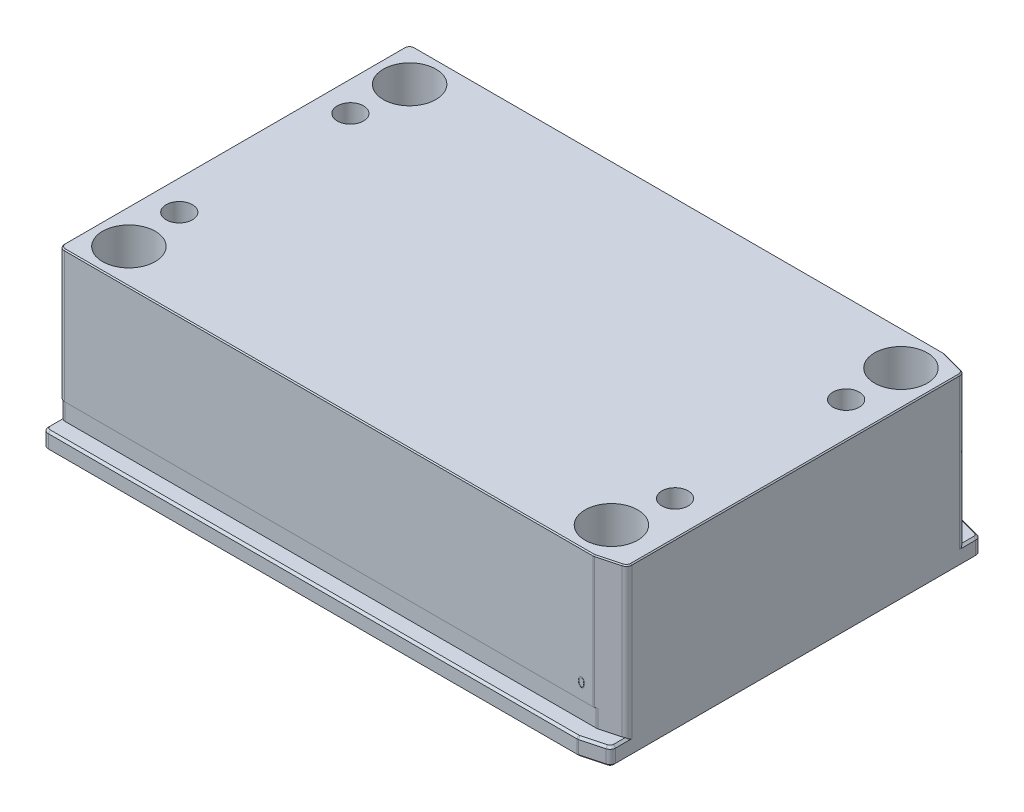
ISO-10303-21;
HEADER;
FILE_DESCRIPTION(('STEP AP214'),'2;1');
FILE_NAME('part.step','',(''),(''),'','','');
FILE_SCHEMA(('AUTOMOTIVE_DESIGN { 1 0 10303 214 1 1 1 1 }'));
ENDSEC;
DATA;
#1=APPLICATION_CONTEXT('core data for automotive mechanical design processes');
#2=APPLICATION_PROTOCOL_DEFINITION('international standard','automotive_design',2000,#1);
#3=PRODUCT_CONTEXT('',#1,'mechanical');
#4=PRODUCT('Part','Part','',(#3));
#5=PRODUCT_RELATED_PRODUCT_CATEGORY('part','',(#4));
#6=PRODUCT_DEFINITION_FORMATION('','',#4);
#7=PRODUCT_DEFINITION_CONTEXT('part definition',#1,'design');
#8=PRODUCT_DEFINITION('design','',#6,#7);
#9=PRODUCT_DEFINITION_SHAPE('','',#8);
#10=(LENGTH_UNIT() NAMED_UNIT(*) SI_UNIT(.MILLI.,.METRE.));
#11=(NAMED_UNIT(*) PLANE_ANGLE_UNIT() SI_UNIT($,.RADIAN.));
#12=(NAMED_UNIT(*) SI_UNIT($,.STERADIAN.) SOLID_ANGLE_UNIT());
#13=UNCERTAINTY_MEASURE_WITH_UNIT(LENGTH_MEASURE(1.E-05),#10,'distance_accuracy_value','');
#14=(GEOMETRIC_REPRESENTATION_CONTEXT(3) GLOBAL_UNCERTAINTY_ASSIGNED_CONTEXT((#13)) GLOBAL_UNIT_ASSIGNED_CONTEXT((#10,
#11,#12)) REPRESENTATION_CONTEXT('',''));
#15=CARTESIAN_POINT('',(0.,0.,0.));
#16=DIRECTION('',(0.,0.,1.));
#17=DIRECTION('',(1.,0.,0.));
#18=AXIS2_PLACEMENT_3D('',#15,#16,#17);
#19=CARTESIAN_POINT('',(-101.6,60.325,63.4492));
#20=DIRECTION('',(0.,0.,-1.));
#21=DIRECTION('',(-1.,0.,0.));
#22=AXIS2_PLACEMENT_3D('',#19,#20,#21);
#23=PLANE('',#22);
#24=DIRECTION('',(0.,-1.,0.));
#25=VECTOR('',#24,1.);
#26=CARTESIAN_POINT('',(91.6804821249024,60.325,63.4492));
#27=LINE('',#26,#25);
#28=CARTESIAN_POINT('',(91.6804821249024,12.6746,63.4492));
#29=VERTEX_POINT('',#28);
#30=CARTESIAN_POINT('',(91.6804821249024,59.944,63.4492));
#31=VERTEX_POINT('',#30);
#32=EDGE_CURVE('E1172',#29,#31,#27,.F.);
#33=ORIENTED_EDGE('',*,*,#32,.T.);
#34=DIRECTION('',(-1.,0.,0.));
#35=VECTOR('',#34,1.);
#36=CARTESIAN_POINT('',(-99.568,59.944,63.4492));
#37=LINE('',#36,#35);
#38=CARTESIAN_POINT('',(-99.568,59.944,63.4492));
#39=VERTEX_POINT('',#38);
#40=EDGE_CURVE('E1235',#31,#39,#37,.T.);
#41=ORIENTED_EDGE('',*,*,#40,.T.);
#42=DIRECTION('',(0.,1.,0.));
#43=VECTOR('',#42,1.);
#44=CARTESIAN_POINT('',(-99.568,60.325,63.4492));
#45=LINE('',#44,#43);
#46=CARTESIAN_POINT('',(-99.568,12.6746,63.4492));
#47=VERTEX_POINT('',#46);
#48=EDGE_CURVE('E1170',#39,#47,#45,.F.);
#49=ORIENTED_EDGE('',*,*,#48,.T.);
#50=DIRECTION('',(1.,0.,0.));
#51=VECTOR('',#50,1.);
#52=CARTESIAN_POINT('',(-101.6,12.6746,63.4492));
#53=LINE('',#52,#51);
#54=EDGE_CURVE('E1545',#47,#29,#53,.T.);
#55=ORIENTED_EDGE('',*,*,#54,.T.);
#56=EDGE_LOOP('',(#33,#41,#49,#55));
#57=FACE_BOUND('',#56,.T.);
#58=CARTESIAN_POINT('',(87.5509260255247,16.6483777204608,63.4492));
#59=CARTESIAN_POINT('',(87.5258851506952,16.6488007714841,63.4492));
#60=CARTESIAN_POINT('',(87.4765094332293,16.6496349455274,63.4492));
#61=CARTESIAN_POINT('',(87.4033461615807,16.6582652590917,63.4492000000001));
#62=CARTESIAN_POINT('',(87.3323328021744,16.6721404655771,63.4492));
#63=CARTESIAN_POINT('',(87.2631189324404,16.6915683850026,63.4492));
#64=CARTESIAN_POINT('',(87.1953494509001,16.7153489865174,63.4492));
#65=CARTESIAN_POINT('',(87.1299478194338,16.7463312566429,63.4492));
#66=CARTESIAN_POINT('',(87.0661868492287,16.7820128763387,63.4492));
#67=CARTESIAN_POINT('',(87.0042366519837,16.8226487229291,63.4492));
#68=CARTESIAN_POINT('',(86.9452613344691,16.8692048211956,63.4492));
#69=CARTESIAN_POINT('',(86.88892902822,16.9206981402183,63.4492));
#70=CARTESIAN_POINT('',(86.8366549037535,16.9784136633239,63.4492));
#71=CARTESIAN_POINT('',(86.7880011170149,17.0414400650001,63.4492));
#72=CARTESIAN_POINT('',(86.7417603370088,17.1091975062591,63.4492));
#73=CARTESIAN_POINT('',(86.6992249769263,17.1826111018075,63.4492));
#74=CARTESIAN_POINT('',(86.6598814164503,17.2613897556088,63.4492));
#75=CARTESIAN_POINT('',(86.6239191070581,17.3460424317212,63.4492));
#76=CARTESIAN_POINT('',(86.5920342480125,17.437804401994,63.4492));
#77=CARTESIAN_POINT('',(86.5638695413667,17.5377254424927,63.4492));
#78=CARTESIAN_POINT('',(86.5416316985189,17.6466874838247,63.4492));
#79=CARTESIAN_POINT('',(86.5225971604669,17.7638153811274,63.4492000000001));
#80=CARTESIAN_POINT('',(86.5072443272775,17.8896124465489,63.4492));
#81=CARTESIAN_POINT('',(86.4967629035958,18.0241469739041,63.4492));
#82=CARTESIAN_POINT('',(86.4902847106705,18.1673351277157,63.4492));
#83=CARTESIAN_POINT('',(86.4897086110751,18.2655512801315,63.4492));
#84=CARTESIAN_POINT('',(86.4894126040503,18.3160159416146,63.4492));
#85=B_SPLINE_CURVE_WITH_KNOTS('',3,(#58,#59,#60,#61,#62,#63,#64,#65,#66,#67,#68,#69,#70,#71,#72,
#73,#74,#75,#76,#77,#78,#79,#80,#81,#82,#83,#84),.UNSPECIFIED.,.F.,.F.,(4,1,1,1,1,1,1,1,1,1,1,1,
1,1,1,1,1,1,1,1,1,1,1,1,4),(0.,0.0337871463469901,0.0666216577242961,0.0992848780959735,
0.131361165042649,0.163585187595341,0.196103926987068,0.228902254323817,0.262158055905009,
0.295991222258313,0.330217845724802,0.365059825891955,0.400950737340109,0.437620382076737,
0.47570752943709,0.515380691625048,0.556413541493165,0.599764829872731,0.646424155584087,
0.696431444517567,0.749781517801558,0.806573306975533,0.8674355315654,0.931886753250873,1.),.UNSPECIFIED.);
#86=CARTESIAN_POINT('',(87.5509260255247,16.6483777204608,63.4492));
#87=VERTEX_POINT('',#86);
#88=CARTESIAN_POINT('',(86.4894126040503,18.3160159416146,63.4492));
#89=VERTEX_POINT('',#88);
#90=EDGE_CURVE('E52',#87,#89,#85,.T.);
#91=ORIENTED_EDGE('',*,*,#90,.T.);
#92=CARTESIAN_POINT('',(86.4894126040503,18.3160159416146,63.4492));
#93=CARTESIAN_POINT('',(86.4897101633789,18.3669042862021,63.4492));
#94=CARTESIAN_POINT('',(86.4902881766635,18.4657556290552,63.4492));
#95=CARTESIAN_POINT('',(86.4967183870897,18.6097959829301,63.4492));
#96=CARTESIAN_POINT('',(86.5074003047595,18.74492424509,63.4492));
#97=CARTESIAN_POINT('',(86.5220392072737,18.8711468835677,63.4492000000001));
#98=CARTESIAN_POINT('',(86.5398536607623,18.9884964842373,63.4492));
#99=CARTESIAN_POINT('',(86.5636348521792,19.0966594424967,63.4492));
#100=CARTESIAN_POINT('',(86.5906793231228,19.1961363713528,63.4492));
#101=CARTESIAN_POINT('',(86.6220233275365,19.2872516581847,63.4492));
#102=CARTESIAN_POINT('',(86.6573908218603,19.3712328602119,63.4492));
#103=CARTESIAN_POINT('',(86.6958847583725,19.4496328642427,63.4492));
#104=CARTESIAN_POINT('',(86.7390328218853,19.5223330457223,63.4492));
#105=CARTESIAN_POINT('',(86.7843690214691,19.5904937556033,63.4492));
#106=CARTESIAN_POINT('',(86.8337285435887,19.6529992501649,63.4492000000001));
#107=CARTESIAN_POINT('',(86.885706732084,19.7107322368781,63.4492));
#108=CARTESIAN_POINT('',(86.9423322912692,19.762358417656,63.4492));
#109=CARTESIAN_POINT('',(87.0016803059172,19.8093904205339,63.4492));
#110=CARTESIAN_POINT('',(87.0642880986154,19.850619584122,63.4492));
#111=CARTESIAN_POINT('',(87.1283710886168,19.8869349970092,63.4492));
#112=CARTESIAN_POINT('',(87.1943703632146,19.9179591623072,63.4492));
#113=CARTESIAN_POINT('',(87.2624661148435,19.9423526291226,63.4492));
#114=CARTESIAN_POINT('',(87.3320462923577,19.9625010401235,63.4492));
#115=CARTESIAN_POINT('',(87.4033541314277,19.9762795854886,63.4492000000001));
#116=CARTESIAN_POINT('',(87.4765073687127,19.9849490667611,63.4492));
#117=CARTESIAN_POINT('',(87.5258844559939,19.9857778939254,63.4492));
#118=CARTESIAN_POINT('',(87.5509260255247,19.9861982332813,63.4492));
#119=B_SPLINE_CURVE_WITH_KNOTS('',3,(#92,#93,#94,#95,#96,#97,#98,#99,#100,#101,#102,#103,#104,
#105,#106,#107,#108,#109,#110,#111,#112,#113,#114,#115,#116,#117,#118),.UNSPECIFIED.,.F.,.F.,(4,
1,1,1,1,1,1,1,1,1,1,1,1,1,1,1,1,1,1,1,1,1,1,1,4),(0.,0.0685946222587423,0.133246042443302,
0.194312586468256,0.251279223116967,0.304513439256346,0.354234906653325,0.40048058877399,
0.443410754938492,0.484014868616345,0.523252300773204,0.56104237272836,0.597900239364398,
0.633518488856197,0.668314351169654,0.702495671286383,0.73668535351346,0.770293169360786,
0.803437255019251,0.835912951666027,0.868460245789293,0.900846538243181,0.933466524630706,
0.966257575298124,1.),.UNSPECIFIED.);
#120=CARTESIAN_POINT('',(87.5509260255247,19.9861982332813,63.4492));
#121=VERTEX_POINT('',#120);
#122=EDGE_CURVE('E515',#89,#121,#119,.T.);
#123=ORIENTED_EDGE('',*,*,#122,.T.);
#124=CARTESIAN_POINT('',(87.5509260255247,19.9861982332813,63.4492));
#125=CARTESIAN_POINT('',(87.5761767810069,19.9857557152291,63.4492));
#126=CARTESIAN_POINT('',(87.6263925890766,19.9848756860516,63.4492));
#127=CARTESIAN_POINT('',(87.7006335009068,19.976417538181,63.4492));
#128=CARTESIAN_POINT('',(87.773159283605,19.9623830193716,63.4492));
#129=CARTESIAN_POINT('',(87.8436607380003,19.9424975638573,63.4492));
#130=CARTESIAN_POINT('',(87.9127169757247,19.9178272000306,63.4492));
#131=CARTESIAN_POINT('',(87.9797878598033,19.8869053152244,63.4492));
#132=CARTESIAN_POINT('',(88.0452899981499,19.8509109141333,63.4492));
#133=CARTESIAN_POINT('',(88.1081824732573,19.8086163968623,63.4492));
#134=CARTESIAN_POINT('',(88.1691557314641,19.7614610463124,63.4492));
#135=CARTESIAN_POINT('',(88.2267120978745,19.7081549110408,63.4492));
#136=CARTESIAN_POINT('',(88.28085681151,19.6492362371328,63.4492));
#137=CARTESIAN_POINT('',(88.3322694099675,19.5853354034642,63.4492));
#138=CARTESIAN_POINT('',(88.3794912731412,19.5152267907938,63.4492000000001));
#139=CARTESIAN_POINT('',(88.4244614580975,19.440129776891,63.4492));
#140=CARTESIAN_POINT('',(88.4647132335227,19.358731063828,63.4492));
#141=CARTESIAN_POINT('',(88.5034796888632,19.2723887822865,63.4492));
#142=CARTESIAN_POINT('',(88.5369414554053,19.1787138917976,63.4492));
#143=CARTESIAN_POINT('',(88.567118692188,19.0782344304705,63.4492));
#144=CARTESIAN_POINT('',(88.5915017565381,18.9697635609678,63.4492));
#145=CARTESIAN_POINT('',(88.6118120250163,18.8538703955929,63.4492));
#146=CARTESIAN_POINT('',(88.6275463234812,18.7301293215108,63.4492));
#147=CARTESIAN_POINT('',(88.6390059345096,18.5988055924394,63.4492));
#148=CARTESIAN_POINT('',(88.64505937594,18.459812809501,63.4492));
#149=CARTESIAN_POINT('',(88.6461993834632,18.3647824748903,63.4492));
#150=CARTESIAN_POINT('',(88.6467843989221,18.3160159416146,63.4492));
#151=B_SPLINE_CURVE_WITH_KNOTS('',3,(#124,#125,#126,#127,#128,#129,#130,#131,#132,#133,#134,
#135,#136,#137,#138,#139,#140,#141,#142,#143,#144,#145,#146,#147,#148,#149,#150),.UNSPECIFIED.,
.F.,.F.,(4,1,1,1,1,1,1,1,1,1,1,1,1,1,1,1,1,1,1,1,1,1,1,1,4),(0.,0.0337881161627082,
0.0671939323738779,0.0998624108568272,0.13256661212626,0.165151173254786,0.197913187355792,
0.231319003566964,0.265083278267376,0.299255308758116,0.334398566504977,0.369942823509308,
0.406283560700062,0.444063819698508,0.482997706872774,0.523354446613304,0.56553658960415,
0.60961292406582,0.656390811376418,0.705885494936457,0.758324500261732,0.81383178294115,
0.87279455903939,0.934722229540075,1.),.UNSPECIFIED.);
#152=CARTESIAN_POINT('',(88.6467843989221,18.3160159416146,63.4492));
#153=VERTEX_POINT('',#152);
#154=EDGE_CURVE('E523',#121,#153,#151,.T.);
#155=ORIENTED_EDGE('',*,*,#154,.T.);
#156=CARTESIAN_POINT('',(88.6467843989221,18.3160159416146,63.4492));
#157=CARTESIAN_POINT('',(88.6461933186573,18.2674621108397,63.4492));
#158=CARTESIAN_POINT('',(88.6450416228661,18.1728569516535,63.4492));
#159=CARTESIAN_POINT('',(88.6390737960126,18.0344895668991,63.4492));
#160=CARTESIAN_POINT('',(88.6273184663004,17.9038627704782,63.4492));
#161=CARTESIAN_POINT('',(88.6126136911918,17.7806632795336,63.4492));
#162=CARTESIAN_POINT('',(88.5922474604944,17.6654038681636,63.4492));
#163=CARTESIAN_POINT('',(88.5672056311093,17.5576856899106,63.4492));
#164=CARTESIAN_POINT('',(88.5394014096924,17.457043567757,63.4492));
#165=CARTESIAN_POINT('',(88.5050798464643,17.3643019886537,63.4492));
#166=CARTESIAN_POINT('',(88.4675144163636,17.2781672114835,63.4492));
#167=CARTESIAN_POINT('',(88.4266429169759,17.1977334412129,63.4492));
#168=CARTESIAN_POINT('',(88.3828552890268,17.1222897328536,63.4492));
#169=CARTESIAN_POINT('',(88.3351497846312,17.0524399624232,63.4492));
#170=CARTESIAN_POINT('',(88.2843013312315,16.987689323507,63.4492));
#171=CARTESIAN_POINT('',(88.2292216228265,16.929180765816,63.4492));
#172=CARTESIAN_POINT('',(88.1714633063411,16.8755045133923,63.4492));
#173=CARTESIAN_POINT('',(88.1103106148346,16.8277419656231,63.4492));
#174=CARTESIAN_POINT('',(88.046437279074,16.7859364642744,63.4492));
#175=CARTESIAN_POINT('',(87.9811601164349,16.7485496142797,63.4492));
#176=CARTESIAN_POINT('',(87.9133209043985,16.7184028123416,63.4492));
#177=CARTESIAN_POINT('',(87.8444570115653,16.6925174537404,63.4492));
#178=CARTESIAN_POINT('',(87.7735834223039,16.6727413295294,63.4492));
#179=CARTESIAN_POINT('',(87.7007884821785,16.6590671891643,63.4492));
#180=CARTESIAN_POINT('',(87.6264424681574,16.6494770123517,63.4492));
#181=CARTESIAN_POINT('',(87.5761853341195,16.6487454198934,63.4492));
#182=CARTESIAN_POINT('',(87.5509260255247,16.6483777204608,63.4492));
#183=B_SPLINE_CURVE_WITH_KNOTS('',3,(#156,#157,#158,#159,#160,#161,#162,#163,#164,#165,#166,
#167,#168,#169,#170,#171,#172,#173,#174,#175,#176,#177,#178,#179,#180,#181,#182),.UNSPECIFIED.,
.F.,.F.,(4,1,1,1,1,1,1,1,1,1,1,1,1,1,1,1,1,1,1,1,1,1,1,1,4),(0.,0.0650632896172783,
0.126773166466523,0.18551576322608,0.240764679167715,0.292979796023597,0.342250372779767,
0.388919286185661,0.43277566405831,0.474628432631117,0.514774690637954,0.553605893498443,
0.591426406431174,0.628028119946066,0.66380363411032,0.698984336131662,0.733591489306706,
0.76762846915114,0.801208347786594,0.834263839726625,0.866980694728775,0.899719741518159,
0.93270191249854,0.966175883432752,1.),.UNSPECIFIED.);
#184=EDGE_CURVE('E531',#153,#87,#183,.T.);
#185=ORIENTED_EDGE('',*,*,#184,.T.);
#186=EDGE_LOOP('',(#91,#123,#155,#185));
#187=FACE_BOUND('',#186,.T.);
#188=ADVANCED_FACE('F37',(#57,#187),#23,.F.);
#189=CARTESIAN_POINT('',(-89.662,10.16,0.));
#190=DIRECTION('',(-1.,0.,0.));
#191=DIRECTION('',(0.,0.,1.));
#192=AXIS2_PLACEMENT_3D('',#189,#190,#191);
#193=CONICAL_SURFACE('',#192,2.5527,1.02974425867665);
#194=CARTESIAN_POINT('',(-89.662,10.16,0.));
#195=DIRECTION('',(-1.,0.,0.));
#196=DIRECTION('',(0.,0.,1.));
#197=AXIS2_PLACEMENT_3D('',#194,#195,#196);
#198=CIRCLE('',#197,2.5527);
#199=CARTESIAN_POINT('',(-89.662,7.65694791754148,0.501006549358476));
#200=VERTEX_POINT('',#199);
#201=CARTESIAN_POINT('',(-89.662,12.6630520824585,0.501006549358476));
#202=VERTEX_POINT('',#201);
#203=EDGE_CURVE('E1520',#200,#202,#198,.T.);
#204=ORIENTED_EDGE('',*,*,#203,.T.);
#205=CARTESIAN_POINT('',(-89.4126987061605,8.60491030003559,-1.46692018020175));
#206=CARTESIAN_POINT('',(-89.3808706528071,8.75321266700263,-1.54694413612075));
#207=CARTESIAN_POINT('',(-89.3512090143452,8.90899058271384,-1.61406251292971));
#208=CARTESIAN_POINT('',(-89.300561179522,9.23047270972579,-1.72336349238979));
#209=CARTESIAN_POINT('',(-89.2795800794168,9.39618268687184,-1.76553145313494));
#210=CARTESIAN_POINT('',(-89.2569841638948,9.64976197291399,-1.81005883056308));
#211=CARTESIAN_POINT('',(-89.2509217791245,9.73569416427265,-1.82179420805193));
#212=CARTESIAN_POINT('',(-89.2421076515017,9.90838960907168,-1.8387580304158));
#213=CARTESIAN_POINT('',(-89.2393559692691,9.99515287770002,-1.84398635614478));
#214=CARTESIAN_POINT('',(-89.2372991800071,10.1688293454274,-1.84789983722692));
#215=CARTESIAN_POINT('',(-89.237992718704,10.2557424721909,-1.84658756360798));
#216=CARTESIAN_POINT('',(-89.2427881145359,10.4291268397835,-1.83743566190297));
#217=CARTESIAN_POINT('',(-89.2468899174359,10.5155980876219,-1.82959613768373));
#218=CARTESIAN_POINT('',(-89.2582940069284,10.6871402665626,-1.80747494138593));
#219=CARTESIAN_POINT('',(-89.2655830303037,10.7722155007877,-1.79321995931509));
#220=CARTESIAN_POINT('',(-89.2830376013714,10.940755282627,-1.75832778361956));
#221=CARTESIAN_POINT('',(-89.2932044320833,11.0242190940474,-1.73768774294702));
#222=CARTESIAN_POINT('',(-89.327438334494,11.2714296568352,-1.66621471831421));
#223=CARTESIAN_POINT('',(-89.3552438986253,11.4320640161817,-1.60582007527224));
#224=CARTESIAN_POINT('',(-89.4107069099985,11.7100515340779,-1.47330608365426));
#225=CARTESIAN_POINT('',(-89.4373618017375,11.8297825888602,-1.40568405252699));
#226=CARTESIAN_POINT('',(-89.491803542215,12.0569029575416,-1.2525093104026));
#227=CARTESIAN_POINT('',(-89.5195878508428,12.1643180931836,-1.16699521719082));
#228=CARTESIAN_POINT('',(-89.5641309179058,12.3284846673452,-1.008167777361));
#229=CARTESIAN_POINT('',(-89.5814934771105,12.390232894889,-0.940194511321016));
#230=CARTESIAN_POINT('',(-89.6139502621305,12.5029761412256,-0.795319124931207));
#231=CARTESIAN_POINT('',(-89.6290478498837,12.5539871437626,-0.718430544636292));
#232=CARTESIAN_POINT('',(-89.6527610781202,12.6328840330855,-0.572675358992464));
#233=CARTESIAN_POINT('',(-89.6620701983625,12.6633608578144,-0.505336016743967));
#234=CARTESIAN_POINT('',(-89.6774260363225,12.7132542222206,-0.36630349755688));
#235=CARTESIAN_POINT('',(-89.6834757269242,12.7326808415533,-0.294614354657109));
#236=CARTESIAN_POINT('',(-89.6916622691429,12.7589029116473,-0.148210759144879));
#237=CARTESIAN_POINT('',(-89.6937736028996,12.7656159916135,-0.0734797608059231));
#238=CARTESIAN_POINT('',(-89.6937260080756,12.7654645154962,0.0759649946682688));
#239=CARTESIAN_POINT('',(-89.6915675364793,12.7586014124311,0.150678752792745));
#240=CARTESIAN_POINT('',(-89.6836784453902,12.7333284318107,0.290264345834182));
#241=CARTESIAN_POINT('',(-89.6783193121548,12.7161182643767,0.355382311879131));
#242=CARTESIAN_POINT('',(-89.6648727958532,12.6724957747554,0.482128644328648));
#243=CARTESIAN_POINT('',(-89.6567842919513,12.6460796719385,0.543755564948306));
#244=CARTESIAN_POINT('',(-89.6344834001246,12.5722385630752,0.688771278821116));
#245=CARTESIAN_POINT('',(-89.6191402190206,12.5206788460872,0.769877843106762));
#246=CARTESIAN_POINT('',(-89.5858413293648,12.405580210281,0.922507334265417));
#247=CARTESIAN_POINT('',(-89.5678790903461,12.3420112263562,0.994005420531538));
#248=CARTESIAN_POINT('',(-89.5225417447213,12.1755657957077,1.15747086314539));
#249=CARTESIAN_POINT('',(-89.4945492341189,12.0678235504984,1.24429462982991));
#250=CARTESIAN_POINT('',(-89.439642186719,11.8397857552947,1.39971463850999));
#251=CARTESIAN_POINT('',(-89.4127290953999,11.7194741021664,1.46828708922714));
#252=CARTESIAN_POINT('',(-89.3617336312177,11.4652785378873,1.59049650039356));
#253=CARTESIAN_POINT('',(-89.3377928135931,11.331057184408,1.64348707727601));
#254=CARTESIAN_POINT('',(-89.2965030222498,11.0559018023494,1.73139063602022));
#255=CARTESIAN_POINT('',(-89.2791507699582,10.9149711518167,1.76631261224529));
#256=CARTESIAN_POINT('',(-89.2582390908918,10.6863962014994,1.80761694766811));
#257=CARTESIAN_POINT('',(-89.2519389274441,10.6000070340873,1.81982784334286));
#258=CARTESIAN_POINT('',(-89.242679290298,10.4263481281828,1.8376658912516));
#259=CARTESIAN_POINT('',(-89.2397201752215,10.3390782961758,1.84329233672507));
#260=CARTESIAN_POINT('',(-89.2372870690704,10.1642813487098,1.84792364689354));
#261=CARTESIAN_POINT('',(-89.2378145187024,10.0767541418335,1.84692577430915));
#262=CARTESIAN_POINT('',(-89.2423308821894,9.90212145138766,1.83830988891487));
#263=CARTESIAN_POINT('',(-89.2463196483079,9.81501594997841,1.83069215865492));
#264=CARTESIAN_POINT('',(-89.2575157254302,9.64277393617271,1.80899364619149));
#265=CARTESIAN_POINT('',(-89.2646879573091,9.55762632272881,1.79498325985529));
#266=CARTESIAN_POINT('',(-89.2819245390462,9.38892075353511,1.7605753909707));
#267=CARTESIAN_POINT('',(-89.2919901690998,9.30536351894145,1.74017508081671));
#268=CARTESIAN_POINT('',(-89.3259441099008,9.05787441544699,1.66942517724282));
#269=CARTESIAN_POINT('',(-89.353596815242,8.89702409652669,1.60951398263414));
#270=CARTESIAN_POINT('',(-89.4089697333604,8.61801782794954,1.47763894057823));
#271=CARTESIAN_POINT('',(-89.4356884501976,8.49754002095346,1.41009628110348));
#272=CARTESIAN_POINT('',(-89.490325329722,8.26894371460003,1.25694780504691));
#273=CARTESIAN_POINT('',(-89.5182408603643,8.16079983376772,1.17138015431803));
#274=CARTESIAN_POINT('',(-89.5630023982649,7.99557724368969,1.01245464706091));
#275=CARTESIAN_POINT('',(-89.5804433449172,7.93347379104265,0.944493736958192));
#276=CARTESIAN_POINT('',(-89.6130734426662,7.82001429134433,0.799597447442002));
#277=CARTESIAN_POINT('',(-89.6282659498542,7.76864217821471,0.722675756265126));
#278=CARTESIAN_POINT('',(-89.6521497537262,7.68912887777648,0.576854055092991));
#279=CARTESIAN_POINT('',(-89.6615347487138,7.65838865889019,0.509496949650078));
#280=CARTESIAN_POINT('',(-89.6770465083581,7.60796963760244,0.370384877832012));
#281=CARTESIAN_POINT('',(-89.6831762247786,7.58828081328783,0.298633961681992));
#282=CARTESIAN_POINT('',(-89.6915188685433,7.56155408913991,0.152047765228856));
#283=CARTESIAN_POINT('',(-89.693705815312,7.5546000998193,0.0771953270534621));
#284=CARTESIAN_POINT('',(-89.693792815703,7.55432251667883,-0.0725333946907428));
#285=CARTESIAN_POINT('',(-89.6916935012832,7.56099691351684,-0.147409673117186));
#286=CARTESIAN_POINT('',(-89.6839021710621,7.5859533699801,-0.287204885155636));
#287=CARTESIAN_POINT('',(-89.6785896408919,7.60301042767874,-0.352371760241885));
#288=CARTESIAN_POINT('',(-89.6652263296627,7.64635191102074,-0.479238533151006));
#289=CARTESIAN_POINT('',(-89.6571741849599,7.67264093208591,-0.540936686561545));
#290=CARTESIAN_POINT('',(-89.6349777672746,7.74610860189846,-0.685947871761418));
#291=CARTESIAN_POINT('',(-89.6197067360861,7.79740045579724,-0.767000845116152));
#292=CARTESIAN_POINT('',(-89.586547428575,7.91194296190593,-0.919542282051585));
#293=CARTESIAN_POINT('',(-89.568653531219,7.97521938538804,-0.991009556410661));
#294=CARTESIAN_POINT('',(-89.5276154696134,8.12572082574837,-1.1394166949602));
#295=CARTESIAN_POINT('',(-89.5041890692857,8.2151416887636,-1.21403527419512));
#296=CARTESIAN_POINT('',(-89.4577294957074,8.4034829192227,-1.35013822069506));
#297=CARTESIAN_POINT('',(-89.4346966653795,8.50241111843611,-1.4116116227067));
#298=CARTESIAN_POINT('',(-89.4126987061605,8.60491030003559,-1.46692018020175));
#299=B_SPLINE_CURVE_WITH_KNOTS('',3,(#205,#206,#207,#208,#209,#210,#211,#212,#213,#214,#215,
#216,#217,#218,#219,#220,#221,#222,#223,#224,#225,#226,#227,#228,#229,#230,#231,#232,#233,#234,
#235,#236,#237,#238,#239,#240,#241,#242,#243,#244,#245,#246,#247,#248,#249,#250,#251,#252,#253,
#254,#255,#256,#257,#258,#259,#260,#261,#262,#263,#264,#265,#266,#267,#268,#269,#270,#271,#272,
#273,#274,#275,#276,#277,#278,#279,#280,#281,#282,#283,#284,#285,#286,#287,#288,#289,#290,#291,
#292,#293,#294,#295,#296,#297,#298),.UNSPECIFIED.,.T.,.F.,(4,2,2,2,2,2,2,2,2,2,2,2,2,2,2,2,2,2,
2,2,2,2,2,2,2,2,2,2,2,2,2,2,2,2,2,2,2,2,2,2,2,2,2,2,2,2,4),(0.,0.514066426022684,
1.02843422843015,1.28899689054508,1.5495643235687,1.81002933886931,2.07049020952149,
2.32987736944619,2.58938035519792,3.10818107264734,3.52707835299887,3.94508065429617,
4.2246346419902,4.503769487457,4.72639401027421,4.94881513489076,5.1726724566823,
5.39650582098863,5.59836509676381,5.80030736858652,6.09064501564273,6.38171939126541,
6.80295352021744,7.22473408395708,7.66211830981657,8.09928460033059,8.36143179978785,
8.62360713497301,8.88589081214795,9.14816329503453,9.40761485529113,9.66718138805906,
10.1860117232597,10.6067360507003,11.0265783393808,11.3068544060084,11.5867078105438,
11.8097336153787,12.0325568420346,12.2568430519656,12.4810961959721,12.6829674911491,
12.8849394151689,13.1746915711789,13.465074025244,13.8200760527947,14.1753730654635),.UNSPECIFIED.);
#300=EDGE_CURVE('E604',#202,#200,#299,.T.);
#301=ORIENTED_EDGE('',*,*,#300,.T.);
#302=EDGE_LOOP('',(#204,#301));
#303=FACE_BOUND('',#302,.T.);
#304=ADVANCED_FACE('F615',(#303),#193,.F.);
#305=CARTESIAN_POINT('',(-88.9,0.,50.8));
#306=DIRECTION('',(0.,-1.,0.));
#307=DIRECTION('',(0.,0.,-1.));
#308=AXIS2_PLACEMENT_3D('',#305,#306,#307);
#309=CYLINDRICAL_SURFACE('',#308,11.049);
#310=CARTESIAN_POINT('',(-88.9,2.54,50.8));
#311=DIRECTION('',(0.,1.,0.));
#312=DIRECTION('',(0.,0.,1.));
#313=AXIS2_PLACEMENT_3D('',#310,#311,#312);
#314=CIRCLE('',#313,11.049);
#315=CARTESIAN_POINT('',(-88.9,2.54,61.849));
#316=VERTEX_POINT('',#315);
#317=EDGE_CURVE('E1106',#316,#316,#314,.F.);
#318=ORIENTED_EDGE('',*,*,#317,.T.);
#319=EDGE_LOOP('',(#318));
#320=FACE_BOUND('',#319,.T.);
#321=CARTESIAN_POINT('',(-88.9,7.3152,50.8));
#322=DIRECTION('',(0.,-1.,0.));
#323=DIRECTION('',(0.,0.,-1.));
#324=AXIS2_PLACEMENT_3D('',#321,#322,#323);
#325=CIRCLE('',#324,11.049);
#326=CARTESIAN_POINT('',(-88.9,7.3152,39.751));
#327=VERTEX_POINT('',#326);
#328=EDGE_CURVE('E1046',#327,#327,#325,.T.);
#329=ORIENTED_EDGE('',*,*,#328,.F.);
#330=EDGE_LOOP('',(#329));
#331=FACE_BOUND('',#330,.T.);
#332=ADVANCED_FACE('F686',(#320,#331),#309,.F.);
#333=CARTESIAN_POINT('',(-88.9,0.,-50.8));
#334=DIRECTION('',(0.,-1.,0.));
#335=DIRECTION('',(0.,0.,-1.));
#336=AXIS2_PLACEMENT_3D('',#333,#334,#335);
#337=CYLINDRICAL_SURFACE('',#336,11.049);
#338=CARTESIAN_POINT('',(-88.9,2.54,-50.8));
#339=DIRECTION('',(0.,1.,0.));
#340=DIRECTION('',(0.,0.,1.));
#341=AXIS2_PLACEMENT_3D('',#338,#339,#340);
#342=CIRCLE('',#341,11.049);
#343=CARTESIAN_POINT('',(-88.9,2.54,-39.751));
#344=VERTEX_POINT('',#343);
#345=EDGE_CURVE('E1098',#344,#344,#342,.F.);
#346=ORIENTED_EDGE('',*,*,#345,.T.);
#347=EDGE_LOOP('',(#346));
#348=FACE_BOUND('',#347,.T.);
#349=CARTESIAN_POINT('',(-88.9,7.3152,-50.8));
#350=DIRECTION('',(0.,-1.,0.));
#351=DIRECTION('',(0.,0.,-1.));
#352=AXIS2_PLACEMENT_3D('',#349,#350,#351);
#353=CIRCLE('',#352,11.049);
#354=CARTESIAN_POINT('',(-88.9,7.3152,-61.849));
#355=VERTEX_POINT('',#354);
#356=EDGE_CURVE('E1073',#355,#355,#353,.T.);
#357=ORIENTED_EDGE('',*,*,#356,.F.);
#358=EDGE_LOOP('',(#357));
#359=FACE_BOUND('',#358,.T.);
#360=ADVANCED_FACE('F725',(#348,#359),#337,.F.);
#361=CARTESIAN_POINT('',(88.9,0.,-50.8));
#362=DIRECTION('',(0.,-1.,0.));
#363=DIRECTION('',(0.,0.,-1.));
#364=AXIS2_PLACEMENT_3D('',#361,#362,#363);
#365=CYLINDRICAL_SURFACE('',#364,11.049);
#366=CARTESIAN_POINT('',(88.9,2.54,-50.8));
#367=DIRECTION('',(0.,1.,0.));
#368=DIRECTION('',(0.,0.,1.));
#369=AXIS2_PLACEMENT_3D('',#366,#367,#368);
#370=CIRCLE('',#369,11.049);
#371=CARTESIAN_POINT('',(88.9,2.54,-39.751));
#372=VERTEX_POINT('',#371);
#373=EDGE_CURVE('E1090',#372,#372,#370,.F.);
#374=ORIENTED_EDGE('',*,*,#373,.T.);
#375=EDGE_LOOP('',(#374));
#376=FACE_BOUND('',#375,.T.);
#377=CARTESIAN_POINT('',(88.9,7.3152,-50.8));
#378=DIRECTION('',(0.,-1.,0.));
#379=DIRECTION('',(0.,0.,-1.));
#380=AXIS2_PLACEMENT_3D('',#377,#378,#379);
#381=CIRCLE('',#380,11.049);
#382=CARTESIAN_POINT('',(88.9,7.3152,-61.849));
#383=VERTEX_POINT('',#382);
#384=EDGE_CURVE('E1064',#383,#383,#381,.T.);
#385=ORIENTED_EDGE('',*,*,#384,.F.);
#386=EDGE_LOOP('',(#385));
#387=FACE_BOUND('',#386,.T.);
#388=ADVANCED_FACE('F712',(#376,#387),#365,.F.);
#389=CARTESIAN_POINT('',(85.725,0.,50.8));
#390=DIRECTION('',(0.,-1.,0.));
#391=DIRECTION('',(0.,0.,-1.));
#392=AXIS2_PLACEMENT_3D('',#389,#390,#391);
#393=CYLINDRICAL_SURFACE('',#392,11.049);
#394=CARTESIAN_POINT('',(85.725,2.54,50.8));
#395=DIRECTION('',(0.,1.,0.));
#396=DIRECTION('',(0.,0.,1.));
#397=AXIS2_PLACEMENT_3D('',#394,#395,#396);
#398=CIRCLE('',#397,11.049);
#399=CARTESIAN_POINT('',(85.725,2.54,61.849));
#400=VERTEX_POINT('',#399);
#401=EDGE_CURVE('E1083',#400,#400,#398,.F.);
#402=ORIENTED_EDGE('',*,*,#401,.T.);
#403=EDGE_LOOP('',(#402));
#404=FACE_BOUND('',#403,.T.);
#405=CARTESIAN_POINT('',(85.725,7.3152,50.8));
#406=DIRECTION('',(0.,-1.,0.));
#407=DIRECTION('',(0.,0.,-1.));
#408=AXIS2_PLACEMENT_3D('',#405,#406,#407);
#409=CIRCLE('',#408,11.049);
#410=CARTESIAN_POINT('',(85.725,7.3152,39.751));
#411=VERTEX_POINT('',#410);
#412=EDGE_CURVE('E1049',#411,#411,#409,.T.);
#413=ORIENTED_EDGE('',*,*,#412,.F.);
#414=EDGE_LOOP('',(#413));
#415=FACE_BOUND('',#414,.T.);
#416=ADVANCED_FACE('F699',(#404,#415),#393,.F.);
#417=CARTESIAN_POINT('',(-101.6,60.325,-69.2912));
#418=DIRECTION('',(1.,0.,0.));
#419=DIRECTION('',(0.,0.,-1.));
#420=AXIS2_PLACEMENT_3D('',#417,#418,#419);
#421=PLANE('',#420);
#422=CARTESIAN_POINT('',(-101.6,10.16,0.));
#423=DIRECTION('',(1.,0.,0.));
#424=DIRECTION('',(0.,0.,-1.));
#425=AXIS2_PLACEMENT_3D('',#422,#423,#424);
#426=CIRCLE('',#425,3.3147);
#427=CARTESIAN_POINT('',(-101.6,10.16,-3.31469999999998));
#428=VERTEX_POINT('',#427);
#429=EDGE_CURVE('E1184',#428,#428,#426,.T.);
#430=ORIENTED_EDGE('',*,*,#429,.T.);
#431=EDGE_LOOP('',(#430));
#432=FACE_BOUND('',#431,.T.);
#433=DIRECTION('',(0.,-1.,0.));
#434=VECTOR('',#433,1.);
#435=CARTESIAN_POINT('',(-101.6,60.325,-67.2592));
#436=LINE('',#435,#434);
#437=CARTESIAN_POINT('',(-101.6,5.56259999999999,-67.2592));
#438=VERTEX_POINT('',#437);
#439=CARTESIAN_POINT('',(-101.6,0.762000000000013,-67.2592));
#440=VERTEX_POINT('',#439);
#441=EDGE_CURVE('E1672',#438,#440,#436,.T.);
#442=ORIENTED_EDGE('',*,*,#441,.T.);
#443=DIRECTION('',(0.,0.,1.));
#444=VECTOR('',#443,1.);
#445=CARTESIAN_POINT('',(-101.6,0.762000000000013,-69.2912));
#446=LINE('',#445,#444);
#447=CARTESIAN_POINT('',(-101.6,0.762000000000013,67.2592));
#448=VERTEX_POINT('',#447);
#449=EDGE_CURVE('E1277',#440,#448,#446,.T.);
#450=ORIENTED_EDGE('',*,*,#449,.T.);
#451=DIRECTION('',(0.,-1.,0.));
#452=VECTOR('',#451,1.);
#453=CARTESIAN_POINT('',(-101.6,60.325,67.2592));
#454=LINE('',#453,#452);
#455=CARTESIAN_POINT('',(-101.6,5.56259999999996,67.2592));
#456=VERTEX_POINT('',#455);
#457=EDGE_CURVE('E1613',#448,#456,#454,.F.);
#458=ORIENTED_EDGE('',*,*,#457,.T.);
#459=DIRECTION('',(0.,0.,-1.));
#460=VECTOR('',#459,1.);
#461=CARTESIAN_POINT('',(-101.6,5.56259999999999,-69.2912));
#462=LINE('',#461,#460);
#463=CARTESIAN_POINT('',(-101.6,5.56259999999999,61.1632));
#464=VERTEX_POINT('',#463);
#465=EDGE_CURVE('E1237',#456,#464,#462,.T.);
#466=ORIENTED_EDGE('',*,*,#465,.T.);
#467=DIRECTION('',(0.,1.,0.));
#468=VECTOR('',#467,1.);
#469=CARTESIAN_POINT('',(-101.6,60.325,61.1632));
#470=LINE('',#469,#468);
#471=CARTESIAN_POINT('',(-101.6,12.6746,61.1632));
#472=VERTEX_POINT('',#471);
#473=EDGE_CURVE('E1617',#464,#472,#470,.T.);
#474=ORIENTED_EDGE('',*,*,#473,.T.);
#475=DIRECTION('',(0.,0.,1.));
#476=VECTOR('',#475,1.);
#477=CARTESIAN_POINT('',(-101.6,12.6746,63.4492));
#478=LINE('',#477,#476);
#479=CARTESIAN_POINT('',(-101.6,12.6746,61.4172));
#480=VERTEX_POINT('',#479);
#481=EDGE_CURVE('E1537',#472,#480,#478,.T.);
#482=ORIENTED_EDGE('',*,*,#481,.T.);
#483=DIRECTION('',(0.,1.,0.));
#484=VECTOR('',#483,1.);
#485=CARTESIAN_POINT('',(-101.6,60.325,61.4172));
#486=LINE('',#485,#484);
#487=CARTESIAN_POINT('',(-101.6,59.944,61.4172));
#488=VERTEX_POINT('',#487);
#489=EDGE_CURVE('E1155',#480,#488,#486,.T.);
#490=ORIENTED_EDGE('',*,*,#489,.T.);
#491=DIRECTION('',(0.,0.,-1.));
#492=VECTOR('',#491,1.);
#493=CARTESIAN_POINT('',(-101.6,59.944,-61.4172));
#494=LINE('',#493,#492);
#495=CARTESIAN_POINT('',(-101.6,59.944,-61.4172));
#496=VERTEX_POINT('',#495);
#497=EDGE_CURVE('E1229',#488,#496,#494,.T.);
#498=ORIENTED_EDGE('',*,*,#497,.T.);
#499=DIRECTION('',(0.,-1.,0.));
#500=VECTOR('',#499,1.);
#501=CARTESIAN_POINT('',(-101.6,60.325,-61.4172));
#502=LINE('',#501,#500);
#503=CARTESIAN_POINT('',(-101.6,12.6746,-61.4172));
#504=VERTEX_POINT('',#503);
#505=EDGE_CURVE('E1158',#496,#504,#502,.T.);
#506=ORIENTED_EDGE('',*,*,#505,.T.);
#507=DIRECTION('',(0.,0.,1.));
#508=VECTOR('',#507,1.);
#509=CARTESIAN_POINT('',(-101.6,12.6746,-63.1952));
#510=LINE('',#509,#508);
#511=CARTESIAN_POINT('',(-101.6,12.6746,-61.1632));
#512=VERTEX_POINT('',#511);
#513=EDGE_CURVE('E1527',#504,#512,#510,.T.);
#514=ORIENTED_EDGE('',*,*,#513,.T.);
#515=DIRECTION('',(0.,-1.,0.));
#516=VECTOR('',#515,1.);
#517=CARTESIAN_POINT('',(-101.6,60.325,-61.1632));
#518=LINE('',#517,#516);
#519=CARTESIAN_POINT('',(-101.6,5.56260000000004,-61.1632));
#520=VERTEX_POINT('',#519);
#521=EDGE_CURVE('E1667',#512,#520,#518,.T.);
#522=ORIENTED_EDGE('',*,*,#521,.T.);
#523=DIRECTION('',(0.,0.,-1.));
#524=VECTOR('',#523,1.);
#525=CARTESIAN_POINT('',(-101.6,5.56260000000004,-69.2912));
#526=LINE('',#525,#524);
#527=EDGE_CURVE('E1274',#520,#438,#526,.T.);
#528=ORIENTED_EDGE('',*,*,#527,.T.);
#529=EDGE_LOOP('',(#442,#450,#458,#466,#474,#482,#490,#498,#506,#514,#522,#528));
#530=FACE_BOUND('',#529,.T.);
#531=ADVANCED_FACE('F768',(#432,#530),#421,.F.);
#532=CARTESIAN_POINT('',(-101.6,60.325,69.2912));
#533=DIRECTION('',(0.,0.,-1.));
#534=DIRECTION('',(-1.,0.,0.));
#535=AXIS2_PLACEMENT_3D('',#532,#533,#534);
#536=PLANE('',#535);
#537=DIRECTION('',(0.,-1.,0.));
#538=VECTOR('',#537,1.);
#539=CARTESIAN_POINT('',(-99.568,60.325,69.2912));
#540=LINE('',#539,#538);
#541=CARTESIAN_POINT('',(-99.568,5.56259999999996,69.2912));
#542=VERTEX_POINT('',#541);
#543=CARTESIAN_POINT('',(-99.568,0.762000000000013,69.2912));
#544=VERTEX_POINT('',#543);
#545=EDGE_CURVE('E1676',#542,#544,#540,.T.);
#546=ORIENTED_EDGE('',*,*,#545,.T.);
#547=DIRECTION('',(1.,0.,0.));
#548=VECTOR('',#547,1.);
#549=CARTESIAN_POINT('',(-101.6,0.762000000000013,69.2912));
#550=LINE('',#549,#548);
#551=CARTESIAN_POINT('',(91.6804821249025,0.762000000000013,69.2912));
#552=VERTEX_POINT('',#551);
#553=EDGE_CURVE('E1364',#544,#552,#550,.T.);
#554=ORIENTED_EDGE('',*,*,#553,.T.);
#555=DIRECTION('',(0.,-1.,0.));
#556=VECTOR('',#555,1.);
#557=CARTESIAN_POINT('',(91.6804821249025,6.3246,69.2912));
#558=LINE('',#557,#556);
#559=CARTESIAN_POINT('',(91.6804821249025,5.56259999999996,69.2912));
#560=VERTEX_POINT('',#559);
#561=EDGE_CURVE('E607',#552,#560,#558,.F.);
#562=ORIENTED_EDGE('',*,*,#561,.T.);
#563=DIRECTION('',(-1.,0.,0.));
#564=VECTOR('',#563,1.);
#565=CARTESIAN_POINT('',(-101.6,5.56259999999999,69.2912));
#566=LINE('',#565,#564);
#567=EDGE_CURVE('E1362',#560,#542,#566,.T.);
#568=ORIENTED_EDGE('',*,*,#567,.T.);
#569=EDGE_LOOP('',(#546,#554,#562,#568));
#570=FACE_BOUND('',#569,.T.);
#571=ADVANCED_FACE('F764',(#570),#536,.F.);
#572=CARTESIAN_POINT('',(101.6,60.325,-69.2912));
#573=DIRECTION('',(-1.,0.,0.));
#574=DIRECTION('',(0.,0.,1.));
#575=AXIS2_PLACEMENT_3D('',#572,#573,#574);
#576=PLANE('',#575);
#577=DIRECTION('',(0.,-1.,0.));
#578=VECTOR('',#577,1.);
#579=CARTESIAN_POINT('',(101.6,6.3246,-65.1457459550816));
#580=LINE('',#579,#578);
#581=CARTESIAN_POINT('',(101.6,0.762000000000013,-65.1457459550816));
#582=VERTEX_POINT('',#581);
#583=CARTESIAN_POINT('',(101.6,5.56259999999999,-65.1457459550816));
#584=VERTEX_POINT('',#583);
#585=EDGE_CURVE('E1644',#582,#584,#580,.F.);
#586=ORIENTED_EDGE('',*,*,#585,.T.);
#587=DIRECTION('',(0.,0.,1.));
#588=VECTOR('',#587,1.);
#589=CARTESIAN_POINT('',(101.6,5.56259999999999,-69.2912));
#590=LINE('',#589,#588);
#591=CARTESIAN_POINT('',(101.6,5.56259999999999,-59.3037459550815));
#592=VERTEX_POINT('',#591);
#593=EDGE_CURVE('E1343',#584,#592,#590,.T.);
#594=ORIENTED_EDGE('',*,*,#593,.T.);
#595=DIRECTION('',(0.,-1.,0.));
#596=VECTOR('',#595,1.);
#597=CARTESIAN_POINT('',(101.6,60.325,-59.3037459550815));
#598=LINE('',#597,#596);
#599=CARTESIAN_POINT('',(101.6,59.944,-59.3037459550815));
#600=VERTEX_POINT('',#599);
#601=EDGE_CURVE('E1641',#592,#600,#598,.F.);
#602=ORIENTED_EDGE('',*,*,#601,.T.);
#603=DIRECTION('',(0.,0.,1.));
#604=VECTOR('',#603,1.);
#605=CARTESIAN_POINT('',(101.6,59.944,59.3037459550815));
#606=LINE('',#605,#604);
#607=CARTESIAN_POINT('',(101.6,59.944,59.3037459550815));
#608=VERTEX_POINT('',#607);
#609=EDGE_CURVE('E1223',#600,#608,#606,.T.);
#610=ORIENTED_EDGE('',*,*,#609,.T.);
#611=DIRECTION('',(0.,1.,0.));
#612=VECTOR('',#611,1.);
#613=CARTESIAN_POINT('',(101.6,6.32460000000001,59.3037459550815));
#614=LINE('',#613,#612);
#615=CARTESIAN_POINT('',(101.6,5.56259999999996,59.3037459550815));
#616=VERTEX_POINT('',#615);
#617=EDGE_CURVE('E1639',#608,#616,#614,.F.);
#618=ORIENTED_EDGE('',*,*,#617,.T.);
#619=DIRECTION('',(0.,0.,1.));
#620=VECTOR('',#619,1.);
#621=CARTESIAN_POINT('',(101.6,5.56259999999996,-69.2912));
#622=LINE('',#621,#620);
#623=CARTESIAN_POINT('',(101.6,5.56259999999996,65.1457459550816));
#624=VERTEX_POINT('',#623);
#625=EDGE_CURVE('E1339',#616,#624,#622,.T.);
#626=ORIENTED_EDGE('',*,*,#625,.T.);
#627=DIRECTION('',(0.,1.,0.));
#628=VECTOR('',#627,1.);
#629=CARTESIAN_POINT('',(101.6,0.,65.1457459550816));
#630=LINE('',#629,#628);
#631=CARTESIAN_POINT('',(101.6,0.762000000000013,65.1457459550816));
#632=VERTEX_POINT('',#631);
#633=EDGE_CURVE('E1134',#624,#632,#630,.F.);
#634=ORIENTED_EDGE('',*,*,#633,.T.);
#635=DIRECTION('',(0.,0.,-1.));
#636=VECTOR('',#635,1.);
#637=CARTESIAN_POINT('',(101.6,0.762000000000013,-69.2912));
#638=LINE('',#637,#636);
#639=EDGE_CURVE('E1341',#632,#582,#638,.T.);
#640=ORIENTED_EDGE('',*,*,#639,.T.);
#641=EDGE_LOOP('',(#586,#594,#602,#610,#618,#626,#634,#640));
#642=FACE_BOUND('',#641,.T.);
#643=ADVANCED_FACE('F760',(#642),#576,.F.);
#644=CARTESIAN_POINT('',(-101.6,60.325,-69.2912));
#645=DIRECTION('',(0.,0.,1.));
#646=DIRECTION('',(1.,0.,0.));
#647=AXIS2_PLACEMENT_3D('',#644,#645,#646);
#648=PLANE('',#647);
#649=DIRECTION('',(0.,1.,0.));
#650=VECTOR('',#649,1.);
#651=CARTESIAN_POINT('',(91.6804821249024,0.,-69.2912));
#652=LINE('',#651,#650);
#653=CARTESIAN_POINT('',(91.6804821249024,5.56259999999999,-69.2912));
#654=VERTEX_POINT('',#653);
#655=CARTESIAN_POINT('',(91.6804821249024,0.762000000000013,-69.2912));
#656=VERTEX_POINT('',#655);
#657=EDGE_CURVE('E1624',#654,#656,#652,.F.);
#658=ORIENTED_EDGE('',*,*,#657,.T.);
#659=DIRECTION('',(-1.,0.,0.));
#660=VECTOR('',#659,1.);
#661=CARTESIAN_POINT('',(-101.6,0.762000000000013,-69.2912));
#662=LINE('',#661,#660);
#663=CARTESIAN_POINT('',(-99.568,0.762000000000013,-69.2912));
#664=VERTEX_POINT('',#663);
#665=EDGE_CURVE('E1307',#656,#664,#662,.T.);
#666=ORIENTED_EDGE('',*,*,#665,.T.);
#667=DIRECTION('',(0.,-1.,0.));
#668=VECTOR('',#667,1.);
#669=CARTESIAN_POINT('',(-99.568,60.325,-69.2912));
#670=LINE('',#669,#668);
#671=CARTESIAN_POINT('',(-99.568,5.56259999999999,-69.2912));
#672=VERTEX_POINT('',#671);
#673=EDGE_CURVE('E1627',#664,#672,#670,.F.);
#674=ORIENTED_EDGE('',*,*,#673,.T.);
#675=DIRECTION('',(1.,0.,0.));
#676=VECTOR('',#675,1.);
#677=CARTESIAN_POINT('',(-101.6,5.56259999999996,-69.2912));
#678=LINE('',#677,#676);
#679=EDGE_CURVE('E1305',#672,#654,#678,.T.);
#680=ORIENTED_EDGE('',*,*,#679,.T.);
#681=EDGE_LOOP('',(#658,#666,#674,#680));
#682=FACE_BOUND('',#681,.T.);
#683=ADVANCED_FACE('F753',(#682),#648,.F.);
#684=CARTESIAN_POINT('',(0.,60.325,0.));
#685=DIRECTION('',(0.,1.,0.));
#686=DIRECTION('',(0.,0.,1.));
#687=AXIS2_PLACEMENT_3D('',#684,#685,#686);
#688=PLANE('',#687);
#689=CARTESIAN_POINT('',(99.568,60.325,-59.3037459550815));
#690=DIRECTION('',(0.,1.,0.));
#691=DIRECTION('',(0.,0.,1.));
#692=AXIS2_PLACEMENT_3D('',#689,#690,#691);
#693=CIRCLE('',#692,1.65100000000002);
#694=CARTESIAN_POINT('',(101.219,60.325,-59.3037459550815));
#695=VERTEX_POINT('',#694);
#696=CARTESIAN_POINT('',(99.9953102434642,60.325,-60.8984894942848));
#697=VERTEX_POINT('',#696);
#698=EDGE_CURVE('E1205',#695,#697,#693,.T.);
#699=ORIENTED_EDGE('',*,*,#698,.T.);
#700=DIRECTION('',(-0.965925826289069,0.,-0.258819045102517));
#701=VECTOR('',#700,1.);
#702=CARTESIAN_POINT('',(21.9230380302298,60.325,-81.8178917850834));
#703=LINE('',#702,#701);
#704=CARTESIAN_POINT('',(92.1077923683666,60.325,-63.0119435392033));
#705=VERTEX_POINT('',#704);
#706=EDGE_CURVE('E1209',#697,#705,#703,.T.);
#707=ORIENTED_EDGE('',*,*,#706,.T.);
#708=CARTESIAN_POINT('',(91.6804821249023,60.325,-61.4172));
#709=DIRECTION('',(0.,1.,0.));
#710=DIRECTION('',(0.,0.,1.));
#711=AXIS2_PLACEMENT_3D('',#708,#709,#710);
#712=CIRCLE('',#711,1.65100000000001);
#713=CARTESIAN_POINT('',(91.6804821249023,60.325,-63.0682));
#714=VERTEX_POINT('',#713);
#715=EDGE_CURVE('E1207',#705,#714,#712,.T.);
#716=ORIENTED_EDGE('',*,*,#715,.T.);
#717=DIRECTION('',(-1.,0.,0.));
#718=VECTOR('',#717,1.);
#719=CARTESIAN_POINT('',(-99.568,60.325,-63.0681999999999));
#720=LINE('',#719,#718);
#721=CARTESIAN_POINT('',(-99.568,60.325,-63.0682));
#722=VERTEX_POINT('',#721);
#723=EDGE_CURVE('E1197',#714,#722,#720,.T.);
#724=ORIENTED_EDGE('',*,*,#723,.T.);
#725=CARTESIAN_POINT('',(-99.568,60.325,-61.4172));
#726=DIRECTION('',(0.,1.,0.));
#727=DIRECTION('',(0.,0.,1.));
#728=AXIS2_PLACEMENT_3D('',#725,#726,#727);
#729=CIRCLE('',#728,1.651);
#730=CARTESIAN_POINT('',(-101.219,60.325,-61.4172));
#731=VERTEX_POINT('',#730);
#732=EDGE_CURVE('E1195',#722,#731,#729,.T.);
#733=ORIENTED_EDGE('',*,*,#732,.T.);
#734=DIRECTION('',(0.,0.,1.));
#735=VECTOR('',#734,1.);
#736=CARTESIAN_POINT('',(-101.219,60.325,61.4172));
#737=LINE('',#736,#735);
#738=CARTESIAN_POINT('',(-101.219,60.325,61.4172));
#739=VERTEX_POINT('',#738);
#740=EDGE_CURVE('E1193',#731,#739,#737,.T.);
#741=ORIENTED_EDGE('',*,*,#740,.T.);
#742=CARTESIAN_POINT('',(-99.568,60.325,61.4172));
#743=DIRECTION('',(0.,1.,0.));
#744=DIRECTION('',(0.,0.,1.));
#745=AXIS2_PLACEMENT_3D('',#742,#743,#744);
#746=CIRCLE('',#745,1.65100000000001);
#747=CARTESIAN_POINT('',(-99.568,60.325,63.0682000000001));
#748=VERTEX_POINT('',#747);
#749=EDGE_CURVE('E1191',#739,#748,#746,.T.);
#750=ORIENTED_EDGE('',*,*,#749,.T.);
#751=DIRECTION('',(1.,0.,0.));
#752=VECTOR('',#751,1.);
#753=CARTESIAN_POINT('',(91.6804821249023,60.325,63.0682));
#754=LINE('',#753,#752);
#755=CARTESIAN_POINT('',(91.6804821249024,60.325,63.0682));
#756=VERTEX_POINT('',#755);
#757=EDGE_CURVE('E1187',#748,#756,#754,.T.);
#758=ORIENTED_EDGE('',*,*,#757,.T.);
#759=CARTESIAN_POINT('',(91.6804821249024,60.325,61.4172));
#760=DIRECTION('',(0.,1.,0.));
#761=DIRECTION('',(0.,0.,1.));
#762=AXIS2_PLACEMENT_3D('',#759,#760,#761);
#763=CIRCLE('',#762,1.65100000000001);
#764=CARTESIAN_POINT('',(92.1077923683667,60.325,63.0119435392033));
#765=VERTEX_POINT('',#764);
#766=EDGE_CURVE('E1189',#756,#765,#763,.T.);
#767=ORIENTED_EDGE('',*,*,#766,.T.);
#768=DIRECTION('',(0.965925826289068,0.,-0.258819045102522));
#769=VECTOR('',#768,1.);
#770=CARTESIAN_POINT('',(21.9230380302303,60.325,81.8178917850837));
#771=LINE('',#770,#769);
#772=CARTESIAN_POINT('',(99.9953102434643,60.325,60.8984894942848));
#773=VERTEX_POINT('',#772);
#774=EDGE_CURVE('E1199',#765,#773,#771,.T.);
#775=ORIENTED_EDGE('',*,*,#774,.T.);
#776=CARTESIAN_POINT('',(99.568,60.325,59.3037459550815));
#777=DIRECTION('',(0.,1.,0.));
#778=DIRECTION('',(0.,0.,1.));
#779=AXIS2_PLACEMENT_3D('',#776,#777,#778);
#780=CIRCLE('',#779,1.65100000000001);
#781=CARTESIAN_POINT('',(101.219,60.325,59.3037459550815));
#782=VERTEX_POINT('',#781);
#783=EDGE_CURVE('E1201',#773,#782,#780,.T.);
#784=ORIENTED_EDGE('',*,*,#783,.T.);
#785=DIRECTION('',(0.,0.,-1.));
#786=VECTOR('',#785,1.);
#787=CARTESIAN_POINT('',(101.219,60.325,-59.3037459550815));
#788=LINE('',#787,#786);
#789=EDGE_CURVE('E1203',#782,#695,#788,.T.);
#790=ORIENTED_EDGE('',*,*,#789,.T.);
#791=EDGE_LOOP('',(#699,#707,#716,#724,#733,#741,#750,#758,#767,#775,#784,#790));
#792=FACE_BOUND('',#791,.T.);
#793=CARTESIAN_POINT('',(-90.5002,60.325,30.9626));
#794=DIRECTION('',(0.,1.,0.));
#795=DIRECTION('',(0.,0.,1.));
#796=AXIS2_PLACEMENT_3D('',#793,#794,#795);
#797=CIRCLE('',#796,4.76250000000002);
#798=CARTESIAN_POINT('',(-90.5002,60.325,35.7251));
#799=VERTEX_POINT('',#798);
#800=EDGE_CURVE('E1805',#799,#799,#797,.T.);
#801=ORIENTED_EDGE('',*,*,#800,.F.);
#802=EDGE_LOOP('',(#801));
#803=FACE_BOUND('',#802,.T.);
#804=CARTESIAN_POINT('',(-90.5002,60.325,-30.9626));
#805=DIRECTION('',(0.,1.,0.));
#806=DIRECTION('',(0.,0.,1.));
#807=AXIS2_PLACEMENT_3D('',#804,#805,#806);
#808=CIRCLE('',#807,4.76250000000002);
#809=CARTESIAN_POINT('',(-90.5002,60.325,-26.2001));
#810=VERTEX_POINT('',#809);
#811=EDGE_CURVE('E1801',#810,#810,#808,.T.);
#812=ORIENTED_EDGE('',*,*,#811,.F.);
#813=EDGE_LOOP('',(#812));
#814=FACE_BOUND('',#813,.T.);
#815=CARTESIAN_POINT('',(88.9,60.325,-30.9626));
#816=DIRECTION('',(0.,1.,0.));
#817=DIRECTION('',(0.,0.,1.));
#818=AXIS2_PLACEMENT_3D('',#815,#816,#817);
#819=CIRCLE('',#818,4.76250000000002);
#820=CARTESIAN_POINT('',(88.9,60.325,-26.2001));
#821=VERTEX_POINT('',#820);
#822=EDGE_CURVE('E1795',#821,#821,#819,.T.);
#823=ORIENTED_EDGE('',*,*,#822,.F.);
#824=EDGE_LOOP('',(#823));
#825=FACE_BOUND('',#824,.T.);
#826=CARTESIAN_POINT('',(88.9,60.325,30.9626));
#827=DIRECTION('',(0.,1.,0.));
#828=DIRECTION('',(0.,0.,1.));
#829=AXIS2_PLACEMENT_3D('',#826,#827,#828);
#830=CIRCLE('',#829,4.76250000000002);
#831=CARTESIAN_POINT('',(88.9,60.325,35.7251));
#832=VERTEX_POINT('',#831);
#833=EDGE_CURVE('E1529',#832,#832,#830,.T.);
#834=ORIENTED_EDGE('',*,*,#833,.F.);
#835=EDGE_LOOP('',(#834));
#836=FACE_BOUND('',#835,.T.);
#837=CARTESIAN_POINT('',(-88.9,60.325,50.8));
#838=DIRECTION('',(0.,-1.,0.));
#839=DIRECTION('',(0.,0.,-1.));
#840=AXIS2_PLACEMENT_3D('',#837,#838,#839);
#841=CIRCLE('',#840,9.53389);
#842=CARTESIAN_POINT('',(-88.9,60.325,41.26611));
#843=VERTEX_POINT('',#842);
#844=EDGE_CURVE('E1043',#843,#843,#841,.T.);
#845=ORIENTED_EDGE('',*,*,#844,.T.);
#846=EDGE_LOOP('',(#845));
#847=FACE_BOUND('',#846,.T.);
#848=CARTESIAN_POINT('',(85.725,60.325,50.8));
#849=DIRECTION('',(0.,-1.,0.));
#850=DIRECTION('',(0.,0.,-1.));
#851=AXIS2_PLACEMENT_3D('',#848,#849,#850);
#852=CIRCLE('',#851,9.53389);
#853=CARTESIAN_POINT('',(85.725,60.325,41.26611));
#854=VERTEX_POINT('',#853);
#855=EDGE_CURVE('E1058',#854,#854,#852,.T.);
#856=ORIENTED_EDGE('',*,*,#855,.T.);
#857=EDGE_LOOP('',(#856));
#858=FACE_BOUND('',#857,.T.);
#859=CARTESIAN_POINT('',(88.9,60.325,-50.8));
#860=DIRECTION('',(0.,-1.,0.));
#861=DIRECTION('',(0.,0.,-1.));
#862=AXIS2_PLACEMENT_3D('',#859,#860,#861);
#863=CIRCLE('',#862,9.53389);
#864=CARTESIAN_POINT('',(88.9,60.325,-60.33389));
#865=VERTEX_POINT('',#864);
#866=EDGE_CURVE('E1067',#865,#865,#863,.T.);
#867=ORIENTED_EDGE('',*,*,#866,.T.);
#868=EDGE_LOOP('',(#867));
#869=FACE_BOUND('',#868,.T.);
#870=CARTESIAN_POINT('',(-88.9,60.325,-50.8));
#871=DIRECTION('',(0.,-1.,0.));
#872=DIRECTION('',(0.,0.,-1.));
#873=AXIS2_PLACEMENT_3D('',#870,#871,#872);
#874=CIRCLE('',#873,9.53389);
#875=CARTESIAN_POINT('',(-88.9,60.325,-60.33389));
#876=VERTEX_POINT('',#875);
#877=EDGE_CURVE('E1076',#876,#876,#874,.T.);
#878=ORIENTED_EDGE('',*,*,#877,.T.);
#879=EDGE_LOOP('',(#878));
#880=FACE_BOUND('',#879,.T.);
#881=ADVANCED_FACE('F750',(#792,#803,#814,#825,#836,#847,#858,#869,#880),#688,.T.);
#882=CARTESIAN_POINT('',(0.,0.,0.));
#883=DIRECTION('',(0.,1.,0.));
#884=DIRECTION('',(0.,0.,1.));
#885=AXIS2_PLACEMENT_3D('',#882,#883,#884);
#886=PLANE('',#885);
#887=DIRECTION('',(1.,0.,0.));
#888=VECTOR('',#887,1.);
#889=CARTESIAN_POINT('',(0.,0.,-68.5292));
#890=LINE('',#889,#888);
#891=CARTESIAN_POINT('',(-99.568,0.,-68.5292));
#892=VERTEX_POINT('',#891);
#893=CARTESIAN_POINT('',(91.6804821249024,0.,-68.5292));
#894=VERTEX_POINT('',#893);
#895=EDGE_CURVE('E1301',#892,#894,#890,.T.);
#896=ORIENTED_EDGE('',*,*,#895,.T.);
#897=CARTESIAN_POINT('',(91.6804821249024,0.,-67.2592));
#898=DIRECTION('',(0.,1.,0.));
#899=DIRECTION('',(0.,0.,1.));
#900=AXIS2_PLACEMENT_3D('',#897,#898,#899);
#901=CIRCLE('',#900,1.26999999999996);
#902=CARTESIAN_POINT('',(92.0091823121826,0.,-68.485925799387));
#903=VERTEX_POINT('',#902);
#904=EDGE_CURVE('E1303',#894,#903,#901,.F.);
#905=ORIENTED_EDGE('',*,*,#904,.T.);
#906=DIRECTION('',(0.965925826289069,0.,0.258819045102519));
#907=VECTOR('',#906,1.);
#908=CARTESIAN_POINT('',(99.8967001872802,0.,-66.3724717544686));
#909=LINE('',#908,#907);
#910=CARTESIAN_POINT('',(99.8967001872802,0.,-66.3724717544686));
#911=VERTEX_POINT('',#910);
#912=EDGE_CURVE('E1299',#903,#911,#909,.T.);
#913=ORIENTED_EDGE('',*,*,#912,.T.);
#914=CARTESIAN_POINT('',(99.568,0.,-65.1457459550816));
#915=DIRECTION('',(0.,1.,0.));
#916=DIRECTION('',(0.,0.,1.));
#917=AXIS2_PLACEMENT_3D('',#914,#915,#916);
#918=CIRCLE('',#917,1.26999999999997);
#919=CARTESIAN_POINT('',(100.838,0.,-65.1457459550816));
#920=VERTEX_POINT('',#919);
#921=EDGE_CURVE('E1297',#911,#920,#918,.F.);
#922=ORIENTED_EDGE('',*,*,#921,.T.);
#923=DIRECTION('',(0.,0.,1.));
#924=VECTOR('',#923,1.);
#925=CARTESIAN_POINT('',(100.838,0.,0.));
#926=LINE('',#925,#924);
#927=CARTESIAN_POINT('',(100.838,0.,65.1457459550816));
#928=VERTEX_POINT('',#927);
#929=EDGE_CURVE('E1290',#920,#928,#926,.T.);
#930=ORIENTED_EDGE('',*,*,#929,.T.);
#931=CARTESIAN_POINT('',(99.568,0.,65.1457459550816));
#932=DIRECTION('',(0.,1.,0.));
#933=DIRECTION('',(0.,0.,1.));
#934=AXIS2_PLACEMENT_3D('',#931,#932,#933);
#935=CIRCLE('',#934,1.26999999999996);
#936=CARTESIAN_POINT('',(99.8967001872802,0.,66.3724717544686));
#937=VERTEX_POINT('',#936);
#938=EDGE_CURVE('E1288',#928,#937,#935,.F.);
#939=ORIENTED_EDGE('',*,*,#938,.T.);
#940=DIRECTION('',(-0.965925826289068,0.,0.258819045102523));
#941=VECTOR('',#940,1.);
#942=CARTESIAN_POINT('',(92.0091823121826,0.,68.4859257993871));
#943=LINE('',#942,#941);
#944=CARTESIAN_POINT('',(92.0091823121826,0.,68.4859257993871));
#945=VERTEX_POINT('',#944);
#946=EDGE_CURVE('E1286',#937,#945,#943,.T.);
#947=ORIENTED_EDGE('',*,*,#946,.T.);
#948=CARTESIAN_POINT('',(91.6804821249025,0.,67.2592));
#949=DIRECTION('',(0.,1.,0.));
#950=DIRECTION('',(0.,0.,1.));
#951=AXIS2_PLACEMENT_3D('',#948,#949,#950);
#952=CIRCLE('',#951,1.26999999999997);
#953=CARTESIAN_POINT('',(91.6804821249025,0.,68.5292));
#954=VERTEX_POINT('',#953);
#955=EDGE_CURVE('E1282',#945,#954,#952,.F.);
#956=ORIENTED_EDGE('',*,*,#955,.T.);
#957=DIRECTION('',(-1.,0.,0.));
#958=VECTOR('',#957,1.);
#959=CARTESIAN_POINT('',(0.,0.,68.5292));
#960=LINE('',#959,#958);
#961=CARTESIAN_POINT('',(-99.568,0.,68.5292));
#962=VERTEX_POINT('',#961);
#963=EDGE_CURVE('E1280',#954,#962,#960,.T.);
#964=ORIENTED_EDGE('',*,*,#963,.T.);
#965=CARTESIAN_POINT('',(-99.568,0.,67.2592));
#966=DIRECTION('',(0.,1.,0.));
#967=DIRECTION('',(0.,0.,1.));
#968=AXIS2_PLACEMENT_3D('',#965,#966,#967);
#969=CIRCLE('',#968,1.26999999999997);
#970=CARTESIAN_POINT('',(-100.838,0.,67.2592));
#971=VERTEX_POINT('',#970);
#972=EDGE_CURVE('E1284',#962,#971,#969,.F.);
#973=ORIENTED_EDGE('',*,*,#972,.T.);
#974=DIRECTION('',(0.,0.,-1.));
#975=VECTOR('',#974,1.);
#976=CARTESIAN_POINT('',(-100.838,0.,0.));
#977=LINE('',#976,#975);
#978=CARTESIAN_POINT('',(-100.838,0.,-67.2592));
#979=VERTEX_POINT('',#978);
#980=EDGE_CURVE('E1292',#971,#979,#977,.T.);
#981=ORIENTED_EDGE('',*,*,#980,.T.);
#982=CARTESIAN_POINT('',(-99.568,0.,-67.2592));
#983=DIRECTION('',(0.,1.,0.));
#984=DIRECTION('',(0.,0.,1.));
#985=AXIS2_PLACEMENT_3D('',#982,#983,#984);
#986=CIRCLE('',#985,1.26999999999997);
#987=EDGE_CURVE('E1295',#979,#892,#986,.F.);
#988=ORIENTED_EDGE('',*,*,#987,.T.);
#989=EDGE_LOOP('',(#896,#905,#913,#922,#930,#939,#947,#956,#964,#973,#981,#988));
#990=FACE_BOUND('',#989,.T.);
#991=CARTESIAN_POINT('',(-85.725,0.,0.));
#992=DIRECTION('',(0.,-1.,0.));
#993=DIRECTION('',(0.,0.,-1.));
#994=AXIS2_PLACEMENT_3D('',#991,#992,#993);
#995=CIRCLE('',#994,6.36270000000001);
#996=CARTESIAN_POINT('',(-85.725,0.,-6.36270000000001));
#997=VERTEX_POINT('',#996);
#998=EDGE_CURVE('E1769',#997,#997,#995,.T.);
#999=ORIENTED_EDGE('',*,*,#998,.F.);
#1000=EDGE_LOOP('',(#999));
#1001=FACE_BOUND('',#1000,.T.);
#1002=CARTESIAN_POINT('',(76.2,0.,0.));
#1003=DIRECTION('',(0.,-1.,0.));
#1004=DIRECTION('',(0.,0.,-1.));
#1005=AXIS2_PLACEMENT_3D('',#1002,#1003,#1004);
#1006=CIRCLE('',#1005,6.36270000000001);
#1007=CARTESIAN_POINT('',(76.2,0.,-6.36270000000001));
#1008=VERTEX_POINT('',#1007);
#1009=EDGE_CURVE('E1773',#1008,#1008,#1006,.T.);
#1010=ORIENTED_EDGE('',*,*,#1009,.F.);
#1011=EDGE_LOOP('',(#1010));
#1012=FACE_BOUND('',#1011,.T.);
#1013=CARTESIAN_POINT('',(-90.5002,0.,30.9626));
#1014=DIRECTION('',(0.,1.,0.));
#1015=DIRECTION('',(0.,0.,1.));
#1016=AXIS2_PLACEMENT_3D('',#1013,#1014,#1015);
#1017=CIRCLE('',#1016,4.7625);
#1018=CARTESIAN_POINT('',(-90.5002,0.,35.7251));
#1019=VERTEX_POINT('',#1018);
#1020=EDGE_CURVE('E1777',#1019,#1019,#1017,.T.);
#1021=ORIENTED_EDGE('',*,*,#1020,.T.);
#1022=EDGE_LOOP('',(#1021));
#1023=FACE_BOUND('',#1022,.T.);
#1024=CARTESIAN_POINT('',(-90.5002,0.,-30.9626));
#1025=DIRECTION('',(0.,1.,0.));
#1026=DIRECTION('',(0.,0.,1.));
#1027=AXIS2_PLACEMENT_3D('',#1024,#1025,#1026);
#1028=CIRCLE('',#1027,4.7625);
#1029=CARTESIAN_POINT('',(-90.5002,0.,-26.2001));
#1030=VERTEX_POINT('',#1029);
#1031=EDGE_CURVE('E1781',#1030,#1030,#1028,.T.);
#1032=ORIENTED_EDGE('',*,*,#1031,.T.);
#1033=EDGE_LOOP('',(#1032));
#1034=FACE_BOUND('',#1033,.T.);
#1035=CARTESIAN_POINT('',(88.9,0.,-30.9626));
#1036=DIRECTION('',(0.,1.,0.));
#1037=DIRECTION('',(0.,0.,1.));
#1038=AXIS2_PLACEMENT_3D('',#1035,#1036,#1037);
#1039=CIRCLE('',#1038,4.7625);
#1040=CARTESIAN_POINT('',(88.9,0.,-26.2001));
#1041=VERTEX_POINT('',#1040);
#1042=EDGE_CURVE('E1785',#1041,#1041,#1039,.T.);
#1043=ORIENTED_EDGE('',*,*,#1042,.T.);
#1044=EDGE_LOOP('',(#1043));
#1045=FACE_BOUND('',#1044,.T.);
#1046=CARTESIAN_POINT('',(88.9,0.,30.9626));
#1047=DIRECTION('',(0.,1.,0.));
#1048=DIRECTION('',(0.,0.,1.));
#1049=AXIS2_PLACEMENT_3D('',#1046,#1047,#1048);
#1050=CIRCLE('',#1049,4.7625);
#1051=CARTESIAN_POINT('',(88.9,0.,35.7251));
#1052=VERTEX_POINT('',#1051);
#1053=EDGE_CURVE('E1524',#1052,#1052,#1050,.T.);
#1054=ORIENTED_EDGE('',*,*,#1053,.T.);
#1055=EDGE_LOOP('',(#1054));
#1056=FACE_BOUND('',#1055,.T.);
#1057=CARTESIAN_POINT('',(-88.9,0.,50.8));
#1058=DIRECTION('',(0.,-1.,0.));
#1059=DIRECTION('',(0.,0.,-1.));
#1060=AXIS2_PLACEMENT_3D('',#1057,#1058,#1059);
#1061=CIRCLE('',#1060,11.049);
#1062=CARTESIAN_POINT('',(-88.9,0.,39.751));
#1063=VERTEX_POINT('',#1062);
#1064=EDGE_CURVE('E1052',#1063,#1063,#1061,.T.);
#1065=ORIENTED_EDGE('',*,*,#1064,.F.);
#1066=EDGE_LOOP('',(#1065));
#1067=FACE_BOUND('',#1066,.T.);
#1068=CARTESIAN_POINT('',(85.725,0.,50.8));
#1069=DIRECTION('',(0.,-1.,0.));
#1070=DIRECTION('',(0.,0.,-1.));
#1071=AXIS2_PLACEMENT_3D('',#1068,#1069,#1070);
#1072=CIRCLE('',#1071,11.049);
#1073=CARTESIAN_POINT('',(85.725,0.,39.751));
#1074=VERTEX_POINT('',#1073);
#1075=EDGE_CURVE('E1045',#1074,#1074,#1072,.T.);
#1076=ORIENTED_EDGE('',*,*,#1075,.F.);
#1077=EDGE_LOOP('',(#1076));
#1078=FACE_BOUND('',#1077,.T.);
#1079=CARTESIAN_POINT('',(88.9,0.,-50.8));
#1080=DIRECTION('',(0.,-1.,0.));
#1081=DIRECTION('',(0.,0.,-1.));
#1082=AXIS2_PLACEMENT_3D('',#1079,#1080,#1081);
#1083=CIRCLE('',#1082,11.049);
#1084=CARTESIAN_POINT('',(88.9,0.,-61.849));
#1085=VERTEX_POINT('',#1084);
#1086=EDGE_CURVE('E1061',#1085,#1085,#1083,.T.);
#1087=ORIENTED_EDGE('',*,*,#1086,.F.);
#1088=EDGE_LOOP('',(#1087));
#1089=FACE_BOUND('',#1088,.T.);
#1090=CARTESIAN_POINT('',(-88.9,0.,-50.8));
#1091=DIRECTION('',(0.,-1.,0.));
#1092=DIRECTION('',(0.,0.,-1.));
#1093=AXIS2_PLACEMENT_3D('',#1090,#1091,#1092);
#1094=CIRCLE('',#1093,11.049);
#1095=CARTESIAN_POINT('',(-88.9,0.,-61.849));
#1096=VERTEX_POINT('',#1095);
#1097=EDGE_CURVE('E1070',#1096,#1096,#1094,.T.);
#1098=ORIENTED_EDGE('',*,*,#1097,.F.);
#1099=EDGE_LOOP('',(#1098));
#1100=FACE_BOUND('',#1099,.T.);
#1101=ADVANCED_FACE('F748',(#990,#1001,#1012,#1023,#1034,#1045,#1056,#1067,#1078,#1089,#1100),
#886,.F.);
#1102=CARTESIAN_POINT('',(-101.6,6.3246,69.2912));
#1103=DIRECTION('',(0.,-1.,0.));
#1104=DIRECTION('',(0.,0.,-1.));
#1105=AXIS2_PLACEMENT_3D('',#1102,#1103,#1104);
#1106=PLANE('',#1105);
#1107=CARTESIAN_POINT('',(-99.568,6.3246,61.1632));
#1108=DIRECTION('',(0.,-1.,0.));
#1109=DIRECTION('',(0.,0.,-1.));
#1110=AXIS2_PLACEMENT_3D('',#1107,#1108,#1109);
#1111=CIRCLE('',#1110,2.032);
#1112=CARTESIAN_POINT('',(-99.568,6.3246,63.1952));
#1113=VERTEX_POINT('',#1112);
#1114=CARTESIAN_POINT('',(-100.838,6.3246,62.7494294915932));
#1115=VERTEX_POINT('',#1114);
#1116=EDGE_CURVE('E1660',#1113,#1115,#1111,.T.);
#1117=ORIENTED_EDGE('',*,*,#1116,.T.);
#1118=DIRECTION('',(0.,0.,1.));
#1119=VECTOR('',#1118,1.);
#1120=CARTESIAN_POINT('',(-100.838,6.3246,69.2912));
#1121=LINE('',#1120,#1119);
#1122=CARTESIAN_POINT('',(-100.838,6.3246,67.2592));
#1123=VERTEX_POINT('',#1122);
#1124=EDGE_CURVE('E1378',#1115,#1123,#1121,.T.);
#1125=ORIENTED_EDGE('',*,*,#1124,.T.);
#1126=CARTESIAN_POINT('',(-99.568,6.3246,67.2592));
#1127=DIRECTION('',(0.,-1.,0.));
#1128=DIRECTION('',(0.,0.,-1.));
#1129=AXIS2_PLACEMENT_3D('',#1126,#1127,#1128);
#1130=CIRCLE('',#1129,1.26999999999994);
#1131=CARTESIAN_POINT('',(-99.568,6.3246,68.5292));
#1132=VERTEX_POINT('',#1131);
#1133=EDGE_CURVE('E1376',#1123,#1132,#1130,.F.);
#1134=ORIENTED_EDGE('',*,*,#1133,.T.);
#1135=DIRECTION('',(1.,0.,0.));
#1136=VECTOR('',#1135,1.);
#1137=CARTESIAN_POINT('',(-101.6,6.3246,68.5292));
#1138=LINE('',#1137,#1136);
#1139=CARTESIAN_POINT('',(91.6804821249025,6.3246,68.5291999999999));
#1140=VERTEX_POINT('',#1139);
#1141=EDGE_CURVE('E1374',#1132,#1140,#1138,.T.);
#1142=ORIENTED_EDGE('',*,*,#1141,.T.);
#1143=CARTESIAN_POINT('',(91.6804821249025,6.3246,67.2592));
#1144=DIRECTION('',(0.,-1.,0.));
#1145=DIRECTION('',(0.,0.,-1.));
#1146=AXIS2_PLACEMENT_3D('',#1143,#1144,#1145);
#1147=CIRCLE('',#1146,1.26999999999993);
#1148=CARTESIAN_POINT('',(92.0091823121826,6.3246,68.485925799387));
#1149=VERTEX_POINT('',#1148);
#1150=EDGE_CURVE('E1372',#1140,#1149,#1147,.F.);
#1151=ORIENTED_EDGE('',*,*,#1150,.T.);
#1152=DIRECTION('',(0.965925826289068,0.,-0.258819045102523));
#1153=VECTOR('',#1152,1.);
#1154=CARTESIAN_POINT('',(99.8967001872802,6.3246,66.3724717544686));
#1155=LINE('',#1154,#1153);
#1156=CARTESIAN_POINT('',(99.8967001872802,6.3246,66.3724717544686));
#1157=VERTEX_POINT('',#1156);
#1158=EDGE_CURVE('E1370',#1149,#1157,#1155,.T.);
#1159=ORIENTED_EDGE('',*,*,#1158,.T.);
#1160=CARTESIAN_POINT('',(99.568,6.3246,65.1457459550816));
#1161=DIRECTION('',(0.,-1.,0.));
#1162=DIRECTION('',(0.,0.,-1.));
#1163=AXIS2_PLACEMENT_3D('',#1160,#1161,#1162);
#1164=CIRCLE('',#1163,1.26999999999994);
#1165=CARTESIAN_POINT('',(100.838,6.3246,65.1457459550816));
#1166=VERTEX_POINT('',#1165);
#1167=EDGE_CURVE('E1368',#1157,#1166,#1164,.F.);
#1168=ORIENTED_EDGE('',*,*,#1167,.T.);
#1169=DIRECTION('',(0.,0.,-1.));
#1170=VECTOR('',#1169,1.);
#1171=CARTESIAN_POINT('',(100.838,6.3246,69.2912));
#1172=LINE('',#1171,#1170);
#1173=CARTESIAN_POINT('',(100.838,6.3246,60.8899754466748));
#1174=VERTEX_POINT('',#1173);
#1175=EDGE_CURVE('E1366',#1166,#1174,#1172,.T.);
#1176=ORIENTED_EDGE('',*,*,#1175,.T.);
#1177=CARTESIAN_POINT('',(99.568,6.3246,59.3037459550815));
#1178=DIRECTION('',(0.,-1.,0.));
#1179=DIRECTION('',(0.,0.,-1.));
#1180=AXIS2_PLACEMENT_3D('',#1177,#1178,#1179);
#1181=CIRCLE('',#1180,2.032);
#1182=CARTESIAN_POINT('',(100.093920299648,6.3246,61.2665072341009));
#1183=VERTEX_POINT('',#1182);
#1184=EDGE_CURVE('E1144',#1174,#1183,#1181,.T.);
#1185=ORIENTED_EDGE('',*,*,#1184,.T.);
#1186=DIRECTION('',(0.965925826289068,0.,-0.258819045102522));
#1187=VECTOR('',#1186,1.);
#1188=CARTESIAN_POINT('',(-90.0952424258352,6.3246,112.227539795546));
#1189=LINE('',#1188,#1187);
#1190=CARTESIAN_POINT('',(93.1543433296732,6.3246,63.1259612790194));
#1191=VERTEX_POINT('',#1190);
#1192=EDGE_CURVE('E1113',#1183,#1191,#1189,.F.);
#1193=ORIENTED_EDGE('',*,*,#1192,.T.);
#1194=CARTESIAN_POINT('',(92.6284230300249,6.3246,61.1632));
#1195=DIRECTION('',(0.,-1.,0.));
#1196=DIRECTION('',(0.,0.,-1.));
#1197=AXIS2_PLACEMENT_3D('',#1194,#1195,#1196);
#1198=CIRCLE('',#1197,2.032);
#1199=CARTESIAN_POINT('',(92.6284230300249,6.3246,63.1952));
#1200=VERTEX_POINT('',#1199);
#1201=EDGE_CURVE('E1153',#1191,#1200,#1198,.T.);
#1202=ORIENTED_EDGE('',*,*,#1201,.T.);
#1203=DIRECTION('',(1.,0.,0.));
#1204=VECTOR('',#1203,1.);
#1205=CARTESIAN_POINT('',(-101.6,6.3246,63.1952));
#1206=LINE('',#1205,#1204);
#1207=EDGE_CURVE('E1544',#1113,#1200,#1206,.T.);
#1208=ORIENTED_EDGE('',*,*,#1207,.F.);
#1209=EDGE_LOOP('',(#1117,#1125,#1134,#1142,#1151,#1159,#1168,#1176,#1185,#1193,#1202,#1208));
#1210=FACE_BOUND('',#1209,.T.);
#1211=ADVANCED_FACE('F737',(#1210),#1106,.F.);
#1212=CARTESIAN_POINT('',(-101.6,6.3246,-69.2912));
#1213=DIRECTION('',(0.,-1.,0.));
#1214=DIRECTION('',(0.,0.,-1.));
#1215=AXIS2_PLACEMENT_3D('',#1212,#1213,#1214);
#1216=PLANE('',#1215);
#1217=CARTESIAN_POINT('',(-99.568,6.3246,-67.2592));
#1218=DIRECTION('',(0.,-1.,0.));
#1219=DIRECTION('',(0.,0.,-1.));
#1220=AXIS2_PLACEMENT_3D('',#1217,#1218,#1219);
#1221=CIRCLE('',#1220,1.26999999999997);
#1222=CARTESIAN_POINT('',(-99.568,6.3246,-68.5291999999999));
#1223=VERTEX_POINT('',#1222);
#1224=CARTESIAN_POINT('',(-100.838,6.3246,-67.2592));
#1225=VERTEX_POINT('',#1224);
#1226=EDGE_CURVE('E1319',#1223,#1225,#1221,.F.);
#1227=ORIENTED_EDGE('',*,*,#1226,.T.);
#1228=DIRECTION('',(0.,0.,1.));
#1229=VECTOR('',#1228,1.);
#1230=CARTESIAN_POINT('',(-100.838,6.3246,-69.2912));
#1231=LINE('',#1230,#1229);
#1232=CARTESIAN_POINT('',(-100.838,6.3246,-62.7494294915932));
#1233=VERTEX_POINT('',#1232);
#1234=EDGE_CURVE('E1321',#1225,#1233,#1231,.T.);
#1235=ORIENTED_EDGE('',*,*,#1234,.T.);
#1236=CARTESIAN_POINT('',(-99.568,6.3246,-61.1632));
#1237=DIRECTION('',(0.,-1.,0.));
#1238=DIRECTION('',(0.,0.,-1.));
#1239=AXIS2_PLACEMENT_3D('',#1236,#1237,#1238);
#1240=CIRCLE('',#1239,2.032);
#1241=CARTESIAN_POINT('',(-99.568,6.3246,-63.1952));
#1242=VERTEX_POINT('',#1241);
#1243=EDGE_CURVE('E1662',#1233,#1242,#1240,.T.);
#1244=ORIENTED_EDGE('',*,*,#1243,.T.);
#1245=DIRECTION('',(1.,0.,0.));
#1246=VECTOR('',#1245,1.);
#1247=CARTESIAN_POINT('',(-101.6,6.3246,-63.1952));
#1248=LINE('',#1247,#1246);
#1249=CARTESIAN_POINT('',(92.6284230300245,6.3246,-63.1952000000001));
#1250=VERTEX_POINT('',#1249);
#1251=EDGE_CURVE('E1534',#1242,#1250,#1248,.T.);
#1252=ORIENTED_EDGE('',*,*,#1251,.T.);
#1253=CARTESIAN_POINT('',(92.6284230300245,6.3246,-61.1632000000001));
#1254=DIRECTION('',(0.,-1.,0.));
#1255=DIRECTION('',(0.,0.,-1.));
#1256=AXIS2_PLACEMENT_3D('',#1253,#1254,#1255);
#1257=CIRCLE('',#1256,2.032);
#1258=CARTESIAN_POINT('',(93.1543433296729,6.3246,-63.1259612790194));
#1259=VERTEX_POINT('',#1258);
#1260=EDGE_CURVE('E1141',#1250,#1259,#1257,.T.);
#1261=ORIENTED_EDGE('',*,*,#1260,.T.);
#1262=DIRECTION('',(-0.965925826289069,0.,-0.258819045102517));
#1263=VECTOR('',#1262,1.);
#1264=CARTESIAN_POINT('',(-90.0952424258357,6.3246,-112.227539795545));
#1265=LINE('',#1264,#1263);
#1266=CARTESIAN_POINT('',(100.093920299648,6.3246,-61.2665072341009));
#1267=VERTEX_POINT('',#1266);
#1268=EDGE_CURVE('E1079',#1259,#1267,#1265,.F.);
#1269=ORIENTED_EDGE('',*,*,#1268,.T.);
#1270=CARTESIAN_POINT('',(99.568,6.3246,-59.3037459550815));
#1271=DIRECTION('',(0.,-1.,0.));
#1272=DIRECTION('',(0.,0.,-1.));
#1273=AXIS2_PLACEMENT_3D('',#1270,#1271,#1272);
#1274=CIRCLE('',#1273,2.032);
#1275=CARTESIAN_POINT('',(100.838,6.3246,-60.8899754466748));
#1276=VERTEX_POINT('',#1275);
#1277=EDGE_CURVE('E1140',#1267,#1276,#1274,.T.);
#1278=ORIENTED_EDGE('',*,*,#1277,.T.);
#1279=DIRECTION('',(0.,0.,-1.));
#1280=VECTOR('',#1279,1.);
#1281=CARTESIAN_POINT('',(100.838,6.3246,-69.2912));
#1282=LINE('',#1281,#1280);
#1283=CARTESIAN_POINT('',(100.838,6.3246,-65.1457459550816));
#1284=VERTEX_POINT('',#1283);
#1285=EDGE_CURVE('E1309',#1276,#1284,#1282,.T.);
#1286=ORIENTED_EDGE('',*,*,#1285,.T.);
#1287=CARTESIAN_POINT('',(99.568,6.3246,-65.1457459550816));
#1288=DIRECTION('',(0.,-1.,0.));
#1289=DIRECTION('',(0.,0.,-1.));
#1290=AXIS2_PLACEMENT_3D('',#1287,#1288,#1289);
#1291=CIRCLE('',#1290,1.26999999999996);
#1292=CARTESIAN_POINT('',(99.8967001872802,6.3246,-66.3724717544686));
#1293=VERTEX_POINT('',#1292);
#1294=EDGE_CURVE('E1311',#1284,#1293,#1291,.F.);
#1295=ORIENTED_EDGE('',*,*,#1294,.T.);
#1296=DIRECTION('',(-0.965925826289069,0.,-0.258819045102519));
#1297=VECTOR('',#1296,1.);
#1298=CARTESIAN_POINT('',(92.0091823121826,6.3246,-68.485925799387));
#1299=LINE('',#1298,#1297);
#1300=CARTESIAN_POINT('',(92.0091823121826,6.3246,-68.485925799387));
#1301=VERTEX_POINT('',#1300);
#1302=EDGE_CURVE('E1313',#1293,#1301,#1299,.T.);
#1303=ORIENTED_EDGE('',*,*,#1302,.T.);
#1304=CARTESIAN_POINT('',(91.6804821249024,6.3246,-67.2592));
#1305=DIRECTION('',(0.,-1.,0.));
#1306=DIRECTION('',(0.,0.,-1.));
#1307=AXIS2_PLACEMENT_3D('',#1304,#1305,#1306);
#1308=CIRCLE('',#1307,1.26999999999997);
#1309=CARTESIAN_POINT('',(91.6804821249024,6.3246,-68.5292));
#1310=VERTEX_POINT('',#1309);
#1311=EDGE_CURVE('E1315',#1301,#1310,#1308,.F.);
#1312=ORIENTED_EDGE('',*,*,#1311,.T.);
#1313=DIRECTION('',(-1.,0.,0.));
#1314=VECTOR('',#1313,1.);
#1315=CARTESIAN_POINT('',(-101.6,6.3246,-68.5291999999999));
#1316=LINE('',#1315,#1314);
#1317=EDGE_CURVE('E1317',#1310,#1223,#1316,.T.);
#1318=ORIENTED_EDGE('',*,*,#1317,.T.);
#1319=EDGE_LOOP('',(#1227,#1235,#1244,#1252,#1261,#1269,#1278,#1286,#1295,#1303,#1312,#1318));
#1320=FACE_BOUND('',#1319,.T.);
#1321=ADVANCED_FACE('F734',(#1320),#1216,.F.);
#1322=CARTESIAN_POINT('',(-101.6,60.325,-63.4492));
#1323=DIRECTION('',(0.,0.,1.));
#1324=DIRECTION('',(1.,0.,0.));
#1325=AXIS2_PLACEMENT_3D('',#1322,#1323,#1324);
#1326=PLANE('',#1325);
#1327=DIRECTION('',(0.,-1.,0.));
#1328=VECTOR('',#1327,1.);
#1329=CARTESIAN_POINT('',(-99.568,60.325,-63.4492));
#1330=LINE('',#1329,#1328);
#1331=CARTESIAN_POINT('',(-99.568,12.6746,-63.4492));
#1332=VERTEX_POINT('',#1331);
#1333=CARTESIAN_POINT('',(-99.568,59.944,-63.4492));
#1334=VERTEX_POINT('',#1333);
#1335=EDGE_CURVE('E1165',#1332,#1334,#1330,.F.);
#1336=ORIENTED_EDGE('',*,*,#1335,.T.);
#1337=DIRECTION('',(1.,0.,0.));
#1338=VECTOR('',#1337,1.);
#1339=CARTESIAN_POINT('',(91.6804821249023,59.9439999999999,-63.4492));
#1340=LINE('',#1339,#1338);
#1341=CARTESIAN_POINT('',(91.6804821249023,59.944,-63.4492));
#1342=VERTEX_POINT('',#1341);
#1343=EDGE_CURVE('E1217',#1334,#1342,#1340,.T.);
#1344=ORIENTED_EDGE('',*,*,#1343,.T.);
#1345=DIRECTION('',(0.,1.,0.));
#1346=VECTOR('',#1345,1.);
#1347=CARTESIAN_POINT('',(91.6804821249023,12.6746,-63.4492));
#1348=LINE('',#1347,#1346);
#1349=CARTESIAN_POINT('',(91.6804821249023,12.6746,-63.4492000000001));
#1350=VERTEX_POINT('',#1349);
#1351=EDGE_CURVE('E1163',#1342,#1350,#1348,.F.);
#1352=ORIENTED_EDGE('',*,*,#1351,.T.);
#1353=DIRECTION('',(1.,0.,0.));
#1354=VECTOR('',#1353,1.);
#1355=CARTESIAN_POINT('',(-101.6,12.6746,-63.4492));
#1356=LINE('',#1355,#1354);
#1357=EDGE_CURVE('E1538',#1332,#1350,#1356,.T.);
#1358=ORIENTED_EDGE('',*,*,#1357,.F.);
#1359=EDGE_LOOP('',(#1336,#1344,#1352,#1358));
#1360=FACE_BOUND('',#1359,.T.);
#1361=ADVANCED_FACE('F732',(#1360),#1326,.F.);
#1362=CARTESIAN_POINT('',(-88.9,0.,-50.8));
#1363=DIRECTION('',(0.,-1.,0.));
#1364=DIRECTION('',(0.,0.,-1.));
#1365=AXIS2_PLACEMENT_3D('',#1362,#1363,#1364);
#1366=CYLINDRICAL_SURFACE('',#1365,9.53389000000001);
#1367=CARTESIAN_POINT('',(-88.9,7.6962,-50.8));
#1368=DIRECTION('',(0.,1.,0.));
#1369=DIRECTION('',(0.,0.,1.));
#1370=AXIS2_PLACEMENT_3D('',#1367,#1368,#1369);
#1371=CIRCLE('',#1370,9.53389000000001);
#1372=CARTESIAN_POINT('',(-88.9,7.6962,-41.26611));
#1373=VERTEX_POINT('',#1372);
#1374=EDGE_CURVE('E1029',#1373,#1373,#1371,.F.);
#1375=ORIENTED_EDGE('',*,*,#1374,.T.);
#1376=EDGE_LOOP('',(#1375));
#1377=FACE_BOUND('',#1376,.T.);
#1378=ORIENTED_EDGE('',*,*,#877,.F.);
#1379=EDGE_LOOP('',(#1378));
#1380=FACE_BOUND('',#1379,.T.);
#1381=ADVANCED_FACE('F728',(#1377,#1380),#1366,.F.);
#1382=CARTESIAN_POINT('',(-79.36611,7.3152,-50.8));
#1383=DIRECTION('',(0.,1.,0.));
#1384=DIRECTION('',(0.,0.,1.));
#1385=AXIS2_PLACEMENT_3D('',#1382,#1383,#1384);
#1386=PLANE('',#1385);
#1387=CARTESIAN_POINT('',(-88.9,7.3152,-50.8));
#1388=DIRECTION('',(0.,1.,0.));
#1389=DIRECTION('',(0.,0.,1.));
#1390=AXIS2_PLACEMENT_3D('',#1387,#1388,#1389);
#1391=CIRCLE('',#1390,9.91489000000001);
#1392=CARTESIAN_POINT('',(-88.9,7.3152,-40.88511));
#1393=VERTEX_POINT('',#1392);
#1394=EDGE_CURVE('E1026',#1393,#1393,#1391,.T.);
#1395=ORIENTED_EDGE('',*,*,#1394,.T.);
#1396=EDGE_LOOP('',(#1395));
#1397=FACE_BOUND('',#1396,.T.);
#1398=ORIENTED_EDGE('',*,*,#356,.T.);
#1399=EDGE_LOOP('',(#1398));
#1400=FACE_BOUND('',#1399,.T.);
#1401=ADVANCED_FACE('F723',(#1397,#1400),#1386,.F.);
#1402=CARTESIAN_POINT('',(-88.9,1.3716,-50.8));
#1403=DIRECTION('',(0.,-1.,0.));
#1404=DIRECTION('',(0.,0.,-1.));
#1405=AXIS2_PLACEMENT_3D('',#1402,#1403,#1404);
#1406=CIRCLE('',#1405,11.049);
#1407=CARTESIAN_POINT('',(-88.9,1.3716,-61.849));
#1408=VERTEX_POINT('',#1407);
#1409=EDGE_CURVE('E1095',#1408,#1408,#1406,.F.);
#1410=ORIENTED_EDGE('',*,*,#1409,.T.);
#1411=EDGE_LOOP('',(#1410));
#1412=FACE_BOUND('',#1411,.T.);
#1413=ORIENTED_EDGE('',*,*,#1097,.T.);
#1414=EDGE_LOOP('',(#1413));
#1415=FACE_BOUND('',#1414,.T.);
#1416=ADVANCED_FACE('F719',(#1412,#1415),#337,.F.);
#1417=CARTESIAN_POINT('',(88.9,0.,-50.8));
#1418=DIRECTION('',(0.,-1.,0.));
#1419=DIRECTION('',(0.,0.,-1.));
#1420=AXIS2_PLACEMENT_3D('',#1417,#1418,#1419);
#1421=CYLINDRICAL_SURFACE('',#1420,9.53389000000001);
#1422=CARTESIAN_POINT('',(88.9,7.6962,-50.8));
#1423=DIRECTION('',(0.,1.,0.));
#1424=DIRECTION('',(0.,0.,1.));
#1425=AXIS2_PLACEMENT_3D('',#1422,#1423,#1424);
#1426=CIRCLE('',#1425,9.53389000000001);
#1427=CARTESIAN_POINT('',(88.9,7.6962,-41.26611));
#1428=VERTEX_POINT('',#1427);
#1429=EDGE_CURVE('E1034',#1428,#1428,#1426,.F.);
#1430=ORIENTED_EDGE('',*,*,#1429,.T.);
#1431=EDGE_LOOP('',(#1430));
#1432=FACE_BOUND('',#1431,.T.);
#1433=ORIENTED_EDGE('',*,*,#866,.F.);
#1434=EDGE_LOOP('',(#1433));
#1435=FACE_BOUND('',#1434,.T.);
#1436=ADVANCED_FACE('F715',(#1432,#1435),#1421,.F.);
#1437=CARTESIAN_POINT('',(98.43389,7.3152,-50.8));
#1438=DIRECTION('',(0.,1.,0.));
#1439=DIRECTION('',(0.,0.,1.));
#1440=AXIS2_PLACEMENT_3D('',#1437,#1438,#1439);
#1441=PLANE('',#1440);
#1442=CARTESIAN_POINT('',(88.9,7.3152,-50.8));
#1443=DIRECTION('',(0.,1.,0.));
#1444=DIRECTION('',(0.,0.,1.));
#1445=AXIS2_PLACEMENT_3D('',#1442,#1443,#1444);
#1446=CIRCLE('',#1445,9.91489000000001);
#1447=CARTESIAN_POINT('',(88.9,7.3152,-40.88511));
#1448=VERTEX_POINT('',#1447);
#1449=EDGE_CURVE('E1030',#1448,#1448,#1446,.T.);
#1450=ORIENTED_EDGE('',*,*,#1449,.T.);
#1451=EDGE_LOOP('',(#1450));
#1452=FACE_BOUND('',#1451,.T.);
#1453=ORIENTED_EDGE('',*,*,#384,.T.);
#1454=EDGE_LOOP('',(#1453));
#1455=FACE_BOUND('',#1454,.T.);
#1456=ADVANCED_FACE('F710',(#1452,#1455),#1441,.F.);
#1457=CARTESIAN_POINT('',(88.9,1.3716,-50.8));
#1458=DIRECTION('',(0.,-1.,0.));
#1459=DIRECTION('',(0.,0.,-1.));
#1460=AXIS2_PLACEMENT_3D('',#1457,#1458,#1459);
#1461=CIRCLE('',#1460,11.049);
#1462=CARTESIAN_POINT('',(88.9,1.3716,-61.849));
#1463=VERTEX_POINT('',#1462);
#1464=EDGE_CURVE('E1087',#1463,#1463,#1461,.F.);
#1465=ORIENTED_EDGE('',*,*,#1464,.T.);
#1466=EDGE_LOOP('',(#1465));
#1467=FACE_BOUND('',#1466,.T.);
#1468=ORIENTED_EDGE('',*,*,#1086,.T.);
#1469=EDGE_LOOP('',(#1468));
#1470=FACE_BOUND('',#1469,.T.);
#1471=ADVANCED_FACE('F706',(#1467,#1470),#365,.F.);
#1472=CARTESIAN_POINT('',(85.725,0.,50.8));
#1473=DIRECTION('',(0.,-1.,0.));
#1474=DIRECTION('',(0.,0.,-1.));
#1475=AXIS2_PLACEMENT_3D('',#1472,#1473,#1474);
#1476=CYLINDRICAL_SURFACE('',#1475,9.53389000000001);
#1477=CARTESIAN_POINT('',(85.725,7.6962,50.8));
#1478=DIRECTION('',(0.,1.,0.));
#1479=DIRECTION('',(0.,0.,1.));
#1480=AXIS2_PLACEMENT_3D('',#1477,#1478,#1479);
#1481=CIRCLE('',#1480,9.53389000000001);
#1482=CARTESIAN_POINT('',(85.725,7.6962,60.33389));
#1483=VERTEX_POINT('',#1482);
#1484=EDGE_CURVE('E1390',#1483,#1483,#1481,.F.);
#1485=ORIENTED_EDGE('',*,*,#1484,.T.);
#1486=EDGE_LOOP('',(#1485));
#1487=FACE_BOUND('',#1486,.T.);
#1488=ORIENTED_EDGE('',*,*,#855,.F.);
#1489=EDGE_LOOP('',(#1488));
#1490=FACE_BOUND('',#1489,.T.);
#1491=ADVANCED_FACE('F702',(#1487,#1490),#1476,.F.);
#1492=CARTESIAN_POINT('',(95.25889,7.3152,50.8));
#1493=DIRECTION('',(0.,1.,0.));
#1494=DIRECTION('',(0.,0.,1.));
#1495=AXIS2_PLACEMENT_3D('',#1492,#1493,#1494);
#1496=PLANE('',#1495);
#1497=CARTESIAN_POINT('',(85.725,7.3152,50.8));
#1498=DIRECTION('',(0.,1.,0.));
#1499=DIRECTION('',(0.,0.,1.));
#1500=AXIS2_PLACEMENT_3D('',#1497,#1498,#1499);
#1501=CIRCLE('',#1500,9.91489000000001);
#1502=CARTESIAN_POINT('',(85.725,7.3152,60.71489));
#1503=VERTEX_POINT('',#1502);
#1504=EDGE_CURVE('E1460',#1503,#1503,#1501,.T.);
#1505=ORIENTED_EDGE('',*,*,#1504,.T.);
#1506=EDGE_LOOP('',(#1505));
#1507=FACE_BOUND('',#1506,.T.);
#1508=ORIENTED_EDGE('',*,*,#412,.T.);
#1509=EDGE_LOOP('',(#1508));
#1510=FACE_BOUND('',#1509,.T.);
#1511=ADVANCED_FACE('F697',(#1507,#1510),#1496,.F.);
#1512=CARTESIAN_POINT('',(85.725,1.3716,50.8));
#1513=DIRECTION('',(0.,-1.,0.));
#1514=DIRECTION('',(0.,0.,-1.));
#1515=AXIS2_PLACEMENT_3D('',#1512,#1513,#1514);
#1516=CIRCLE('',#1515,11.049);
#1517=CARTESIAN_POINT('',(85.725,1.3716,39.751));
#1518=VERTEX_POINT('',#1517);
#1519=EDGE_CURVE('E1080',#1518,#1518,#1516,.F.);
#1520=ORIENTED_EDGE('',*,*,#1519,.T.);
#1521=EDGE_LOOP('',(#1520));
#1522=FACE_BOUND('',#1521,.T.);
#1523=ORIENTED_EDGE('',*,*,#1075,.T.);
#1524=EDGE_LOOP('',(#1523));
#1525=FACE_BOUND('',#1524,.T.);
#1526=ADVANCED_FACE('F693',(#1522,#1525),#393,.F.);
#1527=CARTESIAN_POINT('',(-88.9,0.,50.8));
#1528=DIRECTION('',(0.,-1.,0.));
#1529=DIRECTION('',(0.,0.,-1.));
#1530=AXIS2_PLACEMENT_3D('',#1527,#1528,#1529);
#1531=CYLINDRICAL_SURFACE('',#1530,9.53389000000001);
#1532=CARTESIAN_POINT('',(-88.9,7.6962,50.8));
#1533=DIRECTION('',(0.,1.,0.));
#1534=DIRECTION('',(0.,0.,1.));
#1535=AXIS2_PLACEMENT_3D('',#1532,#1533,#1534);
#1536=CIRCLE('',#1535,9.53389000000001);
#1537=CARTESIAN_POINT('',(-88.9,7.6962,60.33389));
#1538=VERTEX_POINT('',#1537);
#1539=EDGE_CURVE('E45',#1538,#1538,#1536,.F.);
#1540=ORIENTED_EDGE('',*,*,#1539,.T.);
#1541=EDGE_LOOP('',(#1540));
#1542=FACE_BOUND('',#1541,.T.);
#1543=ORIENTED_EDGE('',*,*,#844,.F.);
#1544=EDGE_LOOP('',(#1543));
#1545=FACE_BOUND('',#1544,.T.);
#1546=ADVANCED_FACE('F689',(#1542,#1545),#1531,.F.);
#1547=CARTESIAN_POINT('',(-79.36611,7.3152,50.8));
#1548=DIRECTION('',(0.,1.,0.));
#1549=DIRECTION('',(0.,0.,1.));
#1550=AXIS2_PLACEMENT_3D('',#1547,#1548,#1549);
#1551=PLANE('',#1550);
#1552=CARTESIAN_POINT('',(-88.9,7.3152,50.8));
#1553=DIRECTION('',(0.,1.,0.));
#1554=DIRECTION('',(0.,0.,1.));
#1555=AXIS2_PLACEMENT_3D('',#1552,#1553,#1554);
#1556=CIRCLE('',#1555,9.91489000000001);
#1557=CARTESIAN_POINT('',(-88.9,7.3152,60.71489));
#1558=VERTEX_POINT('',#1557);
#1559=EDGE_CURVE('E11',#1558,#1558,#1556,.T.);
#1560=ORIENTED_EDGE('',*,*,#1559,.T.);
#1561=EDGE_LOOP('',(#1560));
#1562=FACE_BOUND('',#1561,.T.);
#1563=ORIENTED_EDGE('',*,*,#328,.T.);
#1564=EDGE_LOOP('',(#1563));
#1565=FACE_BOUND('',#1564,.T.);
#1566=ADVANCED_FACE('F684',(#1562,#1565),#1551,.F.);
#1567=CARTESIAN_POINT('',(-88.9,1.3716,50.8));
#1568=DIRECTION('',(0.,-1.,0.));
#1569=DIRECTION('',(0.,0.,-1.));
#1570=AXIS2_PLACEMENT_3D('',#1567,#1568,#1569);
#1571=CIRCLE('',#1570,11.049);
#1572=CARTESIAN_POINT('',(-88.9,1.3716,39.751));
#1573=VERTEX_POINT('',#1572);
#1574=EDGE_CURVE('E1103',#1573,#1573,#1571,.F.);
#1575=ORIENTED_EDGE('',*,*,#1574,.T.);
#1576=EDGE_LOOP('',(#1575));
#1577=FACE_BOUND('',#1576,.T.);
#1578=ORIENTED_EDGE('',*,*,#1064,.T.);
#1579=EDGE_LOOP('',(#1578));
#1580=FACE_BOUND('',#1579,.T.);
#1581=ADVANCED_FACE('F680',(#1577,#1580),#309,.F.);
#1582=CARTESIAN_POINT('',(97.409,2.54,50.8));
#1583=DIRECTION('',(0.,1.,0.));
#1584=DIRECTION('',(0.,0.,1.));
#1585=AXIS2_PLACEMENT_3D('',#1582,#1583,#1584);
#1586=PLANE('',#1585);
#1587=CARTESIAN_POINT('',(85.725,2.54,50.8));
#1588=DIRECTION('',(0.,1.,0.));
#1589=DIRECTION('',(0.,0.,1.));
#1590=AXIS2_PLACEMENT_3D('',#1587,#1588,#1589);
#1591=CIRCLE('',#1590,11.684);
#1592=CARTESIAN_POINT('',(85.725,2.54,62.484));
#1593=VERTEX_POINT('',#1592);
#1594=EDGE_CURVE('E1094',#1593,#1593,#1591,.T.);
#1595=ORIENTED_EDGE('',*,*,#1594,.F.);
#1596=EDGE_LOOP('',(#1595));
#1597=FACE_BOUND('',#1596,.T.);
#1598=ORIENTED_EDGE('',*,*,#401,.F.);
#1599=EDGE_LOOP('',(#1598));
#1600=FACE_BOUND('',#1599,.T.);
#1601=ADVANCED_FACE('F676',(#1597,#1600),#1586,.F.);
#1602=CARTESIAN_POINT('',(85.725,1.3716,50.8));
#1603=DIRECTION('',(0.,-1.,0.));
#1604=DIRECTION('',(0.,0.,-1.));
#1605=AXIS2_PLACEMENT_3D('',#1602,#1603,#1604);
#1606=PLANE('',#1605);
#1607=CARTESIAN_POINT('',(85.725,1.3716,50.8));
#1608=DIRECTION('',(0.,1.,0.));
#1609=DIRECTION('',(0.,0.,1.));
#1610=AXIS2_PLACEMENT_3D('',#1607,#1608,#1609);
#1611=CIRCLE('',#1610,11.684);
#1612=CARTESIAN_POINT('',(85.725,1.3716,62.484));
#1613=VERTEX_POINT('',#1612);
#1614=EDGE_CURVE('E1084',#1613,#1613,#1611,.T.);
#1615=ORIENTED_EDGE('',*,*,#1614,.T.);
#1616=EDGE_LOOP('',(#1615));
#1617=FACE_BOUND('',#1616,.T.);
#1618=ORIENTED_EDGE('',*,*,#1519,.F.);
#1619=EDGE_LOOP('',(#1618));
#1620=FACE_BOUND('',#1619,.T.);
#1621=ADVANCED_FACE('F672',(#1617,#1620),#1606,.F.);
#1622=CARTESIAN_POINT('',(85.725,2.54,50.8));
#1623=DIRECTION('',(0.,1.,0.));
#1624=DIRECTION('',(0.,0.,1.));
#1625=AXIS2_PLACEMENT_3D('',#1622,#1623,#1624);
#1626=CYLINDRICAL_SURFACE('',#1625,11.684);
#1627=ORIENTED_EDGE('',*,*,#1614,.F.);
#1628=EDGE_LOOP('',(#1627));
#1629=FACE_BOUND('',#1628,.T.);
#1630=ORIENTED_EDGE('',*,*,#1594,.T.);
#1631=EDGE_LOOP('',(#1630));
#1632=FACE_BOUND('',#1631,.T.);
#1633=ADVANCED_FACE('F668',(#1629,#1632),#1626,.F.);
#1634=CARTESIAN_POINT('',(100.584,2.54,-50.8));
#1635=DIRECTION('',(0.,1.,0.));
#1636=DIRECTION('',(0.,0.,1.));
#1637=AXIS2_PLACEMENT_3D('',#1634,#1635,#1636);
#1638=PLANE('',#1637);
#1639=CARTESIAN_POINT('',(88.9,2.54,-50.8));
#1640=DIRECTION('',(0.,1.,0.));
#1641=DIRECTION('',(0.,0.,1.));
#1642=AXIS2_PLACEMENT_3D('',#1639,#1640,#1641);
#1643=CIRCLE('',#1642,11.684);
#1644=CARTESIAN_POINT('',(88.9,2.54,-39.116));
#1645=VERTEX_POINT('',#1644);
#1646=EDGE_CURVE('E1102',#1645,#1645,#1643,.T.);
#1647=ORIENTED_EDGE('',*,*,#1646,.F.);
#1648=EDGE_LOOP('',(#1647));
#1649=FACE_BOUND('',#1648,.T.);
#1650=ORIENTED_EDGE('',*,*,#373,.F.);
#1651=EDGE_LOOP('',(#1650));
#1652=FACE_BOUND('',#1651,.T.);
#1653=ADVANCED_FACE('F664',(#1649,#1652),#1638,.F.);
#1654=CARTESIAN_POINT('',(88.9,1.3716,-50.8));
#1655=DIRECTION('',(0.,-1.,0.));
#1656=DIRECTION('',(0.,0.,-1.));
#1657=AXIS2_PLACEMENT_3D('',#1654,#1655,#1656);
#1658=PLANE('',#1657);
#1659=CARTESIAN_POINT('',(88.9,1.3716,-50.8));
#1660=DIRECTION('',(0.,1.,0.));
#1661=DIRECTION('',(0.,0.,1.));
#1662=AXIS2_PLACEMENT_3D('',#1659,#1660,#1661);
#1663=CIRCLE('',#1662,11.684);
#1664=CARTESIAN_POINT('',(88.9,1.3716,-39.116));
#1665=VERTEX_POINT('',#1664);
#1666=EDGE_CURVE('E1091',#1665,#1665,#1663,.T.);
#1667=ORIENTED_EDGE('',*,*,#1666,.T.);
#1668=EDGE_LOOP('',(#1667));
#1669=FACE_BOUND('',#1668,.T.);
#1670=ORIENTED_EDGE('',*,*,#1464,.F.);
#1671=EDGE_LOOP('',(#1670));
#1672=FACE_BOUND('',#1671,.T.);
#1673=ADVANCED_FACE('F660',(#1669,#1672),#1658,.F.);
#1674=CARTESIAN_POINT('',(88.9,2.54,-50.8));
#1675=DIRECTION('',(0.,1.,0.));
#1676=DIRECTION('',(0.,0.,1.));
#1677=AXIS2_PLACEMENT_3D('',#1674,#1675,#1676);
#1678=CYLINDRICAL_SURFACE('',#1677,11.684);
#1679=ORIENTED_EDGE('',*,*,#1666,.F.);
#1680=EDGE_LOOP('',(#1679));
#1681=FACE_BOUND('',#1680,.T.);
#1682=ORIENTED_EDGE('',*,*,#1646,.T.);
#1683=EDGE_LOOP('',(#1682));
#1684=FACE_BOUND('',#1683,.T.);
#1685=ADVANCED_FACE('F656',(#1681,#1684),#1678,.F.);
#1686=CARTESIAN_POINT('',(-77.216,2.54,-50.8));
#1687=DIRECTION('',(0.,1.,0.));
#1688=DIRECTION('',(0.,0.,1.));
#1689=AXIS2_PLACEMENT_3D('',#1686,#1687,#1688);
#1690=PLANE('',#1689);
#1691=CARTESIAN_POINT('',(-88.9,2.54,-50.8));
#1692=DIRECTION('',(0.,1.,0.));
#1693=DIRECTION('',(0.,0.,1.));
#1694=AXIS2_PLACEMENT_3D('',#1691,#1692,#1693);
#1695=CIRCLE('',#1694,11.684);
#1696=CARTESIAN_POINT('',(-88.9,2.54,-39.116));
#1697=VERTEX_POINT('',#1696);
#1698=EDGE_CURVE('E1110',#1697,#1697,#1695,.T.);
#1699=ORIENTED_EDGE('',*,*,#1698,.F.);
#1700=EDGE_LOOP('',(#1699));
#1701=FACE_BOUND('',#1700,.T.);
#1702=ORIENTED_EDGE('',*,*,#345,.F.);
#1703=EDGE_LOOP('',(#1702));
#1704=FACE_BOUND('',#1703,.T.);
#1705=ADVANCED_FACE('F652',(#1701,#1704),#1690,.F.);
#1706=CARTESIAN_POINT('',(-88.9,1.3716,-50.8));
#1707=DIRECTION('',(0.,-1.,0.));
#1708=DIRECTION('',(0.,0.,-1.));
#1709=AXIS2_PLACEMENT_3D('',#1706,#1707,#1708);
#1710=PLANE('',#1709);
#1711=CARTESIAN_POINT('',(-88.9,1.3716,-50.8));
#1712=DIRECTION('',(0.,1.,0.));
#1713=DIRECTION('',(0.,0.,1.));
#1714=AXIS2_PLACEMENT_3D('',#1711,#1712,#1713);
#1715=CIRCLE('',#1714,11.684);
#1716=CARTESIAN_POINT('',(-88.9,1.3716,-39.116));
#1717=VERTEX_POINT('',#1716);
#1718=EDGE_CURVE('E1099',#1717,#1717,#1715,.T.);
#1719=ORIENTED_EDGE('',*,*,#1718,.T.);
#1720=EDGE_LOOP('',(#1719));
#1721=FACE_BOUND('',#1720,.T.);
#1722=ORIENTED_EDGE('',*,*,#1409,.F.);
#1723=EDGE_LOOP('',(#1722));
#1724=FACE_BOUND('',#1723,.T.);
#1725=ADVANCED_FACE('F648',(#1721,#1724),#1710,.F.);
#1726=CARTESIAN_POINT('',(-88.9,2.54,-50.8));
#1727=DIRECTION('',(0.,1.,0.));
#1728=DIRECTION('',(0.,0.,1.));
#1729=AXIS2_PLACEMENT_3D('',#1726,#1727,#1728);
#1730=CYLINDRICAL_SURFACE('',#1729,11.684);
#1731=ORIENTED_EDGE('',*,*,#1718,.F.);
#1732=EDGE_LOOP('',(#1731));
#1733=FACE_BOUND('',#1732,.T.);
#1734=ORIENTED_EDGE('',*,*,#1698,.T.);
#1735=EDGE_LOOP('',(#1734));
#1736=FACE_BOUND('',#1735,.T.);
#1737=ADVANCED_FACE('F644',(#1733,#1736),#1730,.F.);
#1738=CARTESIAN_POINT('',(-77.216,2.54,50.8));
#1739=DIRECTION('',(0.,1.,0.));
#1740=DIRECTION('',(0.,0.,1.));
#1741=AXIS2_PLACEMENT_3D('',#1738,#1739,#1740);
#1742=PLANE('',#1741);
#1743=CARTESIAN_POINT('',(-88.9,2.54,50.8));
#1744=DIRECTION('',(0.,1.,0.));
#1745=DIRECTION('',(0.,0.,1.));
#1746=AXIS2_PLACEMENT_3D('',#1743,#1744,#1745);
#1747=CIRCLE('',#1746,11.684);
#1748=CARTESIAN_POINT('',(-88.9,2.54,62.484));
#1749=VERTEX_POINT('',#1748);
#1750=EDGE_CURVE('E1548',#1749,#1749,#1747,.T.);
#1751=ORIENTED_EDGE('',*,*,#1750,.F.);
#1752=EDGE_LOOP('',(#1751));
#1753=FACE_BOUND('',#1752,.T.);
#1754=ORIENTED_EDGE('',*,*,#317,.F.);
#1755=EDGE_LOOP('',(#1754));
#1756=FACE_BOUND('',#1755,.T.);
#1757=ADVANCED_FACE('F640',(#1753,#1756),#1742,.F.);
#1758=CARTESIAN_POINT('',(-88.9,1.3716,50.8));
#1759=DIRECTION('',(0.,-1.,0.));
#1760=DIRECTION('',(0.,0.,-1.));
#1761=AXIS2_PLACEMENT_3D('',#1758,#1759,#1760);
#1762=PLANE('',#1761);
#1763=CARTESIAN_POINT('',(-88.9,1.3716,50.8));
#1764=DIRECTION('',(0.,1.,0.));
#1765=DIRECTION('',(0.,0.,1.));
#1766=AXIS2_PLACEMENT_3D('',#1763,#1764,#1765);
#1767=CIRCLE('',#1766,11.684);
#1768=CARTESIAN_POINT('',(-88.9,1.3716,62.484));
#1769=VERTEX_POINT('',#1768);
#1770=EDGE_CURVE('E1107',#1769,#1769,#1767,.T.);
#1771=ORIENTED_EDGE('',*,*,#1770,.T.);
#1772=EDGE_LOOP('',(#1771));
#1773=FACE_BOUND('',#1772,.T.);
#1774=ORIENTED_EDGE('',*,*,#1574,.F.);
#1775=EDGE_LOOP('',(#1774));
#1776=FACE_BOUND('',#1775,.T.);
#1777=ADVANCED_FACE('F636',(#1773,#1776),#1762,.F.);
#1778=CARTESIAN_POINT('',(-88.9,2.54,50.8));
#1779=DIRECTION('',(0.,1.,0.));
#1780=DIRECTION('',(0.,0.,1.));
#1781=AXIS2_PLACEMENT_3D('',#1778,#1779,#1780);
#1782=CYLINDRICAL_SURFACE('',#1781,11.684);
#1783=ORIENTED_EDGE('',*,*,#1770,.F.);
#1784=EDGE_LOOP('',(#1783));
#1785=FACE_BOUND('',#1784,.T.);
#1786=ORIENTED_EDGE('',*,*,#1750,.T.);
#1787=EDGE_LOOP('',(#1786));
#1788=FACE_BOUND('',#1787,.T.);
#1789=ADVANCED_FACE('F632',(#1785,#1788),#1782,.F.);
#1790=CARTESIAN_POINT('',(91.948,60.325,-69.2912));
#1791=DIRECTION('',(-0.258819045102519,0.,0.965925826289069));
#1792=DIRECTION('',(0.,-1.,0.));
#1793=AXIS2_PLACEMENT_3D('',#1790,#1791,#1792);
#1794=PLANE('',#1793);
#1795=DIRECTION('',(0.,-1.,0.));
#1796=VECTOR('',#1795,1.);
#1797=CARTESIAN_POINT('',(92.2064024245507,6.3246,-69.2219612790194));
#1798=LINE('',#1797,#1796);
#1799=CARTESIAN_POINT('',(92.2064024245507,0.762000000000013,-69.2219612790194));
#1800=VERTEX_POINT('',#1799);
#1801=CARTESIAN_POINT('',(92.2064024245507,5.56259999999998,-69.2219612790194));
#1802=VERTEX_POINT('',#1801);
#1803=EDGE_CURVE('E1633',#1800,#1802,#1798,.F.);
#1804=ORIENTED_EDGE('',*,*,#1803,.T.);
#1805=DIRECTION('',(-0.965925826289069,0.,-0.258819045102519));
#1806=VECTOR('',#1805,1.);
#1807=CARTESIAN_POINT('',(100.093920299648,5.56259999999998,-67.1085072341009));
#1808=LINE('',#1807,#1806);
#1809=CARTESIAN_POINT('',(100.093920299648,5.56259999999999,-67.1085072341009));
#1810=VERTEX_POINT('',#1809);
#1811=EDGE_CURVE('E1333',#1802,#1810,#1808,.F.);
#1812=ORIENTED_EDGE('',*,*,#1811,.T.);
#1813=DIRECTION('',(0.,1.,0.));
#1814=VECTOR('',#1813,1.);
#1815=CARTESIAN_POINT('',(100.093920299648,0.,-67.1085072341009));
#1816=LINE('',#1815,#1814);
#1817=CARTESIAN_POINT('',(100.093920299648,0.762000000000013,-67.1085072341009));
#1818=VERTEX_POINT('',#1817);
#1819=EDGE_CURVE('E1630',#1810,#1818,#1816,.F.);
#1820=ORIENTED_EDGE('',*,*,#1819,.T.);
#1821=DIRECTION('',(0.965925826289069,0.,0.258819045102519));
#1822=VECTOR('',#1821,1.);
#1823=CARTESIAN_POINT('',(92.2064024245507,0.762000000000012,-69.2219612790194));
#1824=LINE('',#1823,#1822);
#1825=EDGE_CURVE('E1331',#1818,#1800,#1824,.F.);
#1826=ORIENTED_EDGE('',*,*,#1825,.T.);
#1827=EDGE_LOOP('',(#1804,#1812,#1820,#1826));
#1828=FACE_BOUND('',#1827,.T.);
#1829=ADVANCED_FACE('F635',(#1828),#1794,.F.);
#1830=CARTESIAN_POINT('',(91.9479999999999,60.325,-63.4492));
#1831=DIRECTION('',(-0.258819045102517,0.,0.965925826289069));
#1832=DIRECTION('',(0.,-1.,0.));
#1833=AXIS2_PLACEMENT_3D('',#1830,#1831,#1832);
#1834=PLANE('',#1833);
#1835=DIRECTION('',(0.,-1.,0.));
#1836=VECTOR('',#1835,1.);
#1837=CARTESIAN_POINT('',(92.2064024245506,60.325,-63.3799612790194));
#1838=LINE('',#1837,#1836);
#1839=CARTESIAN_POINT('',(92.2064024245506,12.6746,-63.3799612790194));
#1840=VERTEX_POINT('',#1839);
#1841=CARTESIAN_POINT('',(92.2064024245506,59.944,-63.3799612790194));
#1842=VERTEX_POINT('',#1841);
#1843=EDGE_CURVE('E1168',#1840,#1842,#1838,.F.);
#1844=ORIENTED_EDGE('',*,*,#1843,.T.);
#1845=DIRECTION('',(-0.965925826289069,0.,-0.258819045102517));
#1846=VECTOR('',#1845,1.);
#1847=CARTESIAN_POINT('',(91.9479999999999,59.944,-63.4492));
#1848=LINE('',#1847,#1846);
#1849=CARTESIAN_POINT('',(100.093920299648,59.944,-61.2665072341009));
#1850=VERTEX_POINT('',#1849);
#1851=EDGE_CURVE('E1212',#1842,#1850,#1848,.F.);
#1852=ORIENTED_EDGE('',*,*,#1851,.T.);
#1853=DIRECTION('',(0.,1.,0.));
#1854=VECTOR('',#1853,1.);
#1855=CARTESIAN_POINT('',(100.093920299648,6.3246,-61.2665072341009));
#1856=LINE('',#1855,#1854);
#1857=EDGE_CURVE('E1135',#1850,#1267,#1856,.F.);
#1858=ORIENTED_EDGE('',*,*,#1857,.T.);
#1859=ORIENTED_EDGE('',*,*,#1268,.F.);
#1860=DIRECTION('',(0.,-1.,0.));
#1861=VECTOR('',#1860,1.);
#1862=CARTESIAN_POINT('',(93.1543433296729,12.6746,-63.1259612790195));
#1863=LINE('',#1862,#1861);
#1864=CARTESIAN_POINT('',(93.1543433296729,12.6746,-63.1259612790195));
#1865=VERTEX_POINT('',#1864);
#1866=EDGE_CURVE('E1133',#1259,#1865,#1863,.F.);
#1867=ORIENTED_EDGE('',*,*,#1866,.T.);
#1868=DIRECTION('',(-0.965925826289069,0.,-0.258819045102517));
#1869=VECTOR('',#1868,1.);
#1870=CARTESIAN_POINT('',(91.9479999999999,12.6746,-63.4492));
#1871=LINE('',#1870,#1869);
#1872=EDGE_CURVE('E605',#1840,#1865,#1871,.F.);
#1873=ORIENTED_EDGE('',*,*,#1872,.F.);
#1874=EDGE_LOOP('',(#1844,#1852,#1858,#1859,#1867,#1873));
#1875=FACE_BOUND('',#1874,.T.);
#1876=ADVANCED_FACE('F775',(#1875),#1834,.F.);
#1877=CARTESIAN_POINT('',(91.948,60.325,63.4492));
#1878=DIRECTION('',(-0.258819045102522,0.,-0.965925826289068));
#1879=DIRECTION('',(0.,1.,0.));
#1880=AXIS2_PLACEMENT_3D('',#1877,#1878,#1879);
#1881=PLANE('',#1880);
#1882=DIRECTION('',(0.,-1.,0.));
#1883=VECTOR('',#1882,1.);
#1884=CARTESIAN_POINT('',(100.093920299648,60.325,61.2665072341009));
#1885=LINE('',#1884,#1883);
#1886=CARTESIAN_POINT('',(100.093920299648,59.944,61.2665072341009));
#1887=VERTEX_POINT('',#1886);
#1888=EDGE_CURVE('E1649',#1183,#1887,#1885,.F.);
#1889=ORIENTED_EDGE('',*,*,#1888,.T.);
#1890=DIRECTION('',(0.965925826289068,0.,-0.258819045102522));
#1891=VECTOR('',#1890,1.);
#1892=CARTESIAN_POINT('',(91.948,59.9440000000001,63.4492));
#1893=LINE('',#1892,#1891);
#1894=CARTESIAN_POINT('',(92.2064024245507,59.944,63.3799612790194));
#1895=VERTEX_POINT('',#1894);
#1896=EDGE_CURVE('E1215',#1887,#1895,#1893,.F.);
#1897=ORIENTED_EDGE('',*,*,#1896,.T.);
#1898=DIRECTION('',(0.,1.,0.));
#1899=VECTOR('',#1898,1.);
#1900=CARTESIAN_POINT('',(92.2064024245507,12.6746,63.3799612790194));
#1901=LINE('',#1900,#1899);
#1902=CARTESIAN_POINT('',(92.2064024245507,12.6746,63.3799612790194));
#1903=VERTEX_POINT('',#1902);
#1904=EDGE_CURVE('E1175',#1895,#1903,#1901,.F.);
#1905=ORIENTED_EDGE('',*,*,#1904,.T.);
#1906=DIRECTION('',(0.965925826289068,0.,-0.258819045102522));
#1907=VECTOR('',#1906,1.);
#1908=CARTESIAN_POINT('',(91.948,12.6746,63.4492));
#1909=LINE('',#1908,#1907);
#1910=CARTESIAN_POINT('',(93.1543433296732,12.6746,63.1259612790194));
#1911=VERTEX_POINT('',#1910);
#1912=EDGE_CURVE('E1115',#1911,#1903,#1909,.F.);
#1913=ORIENTED_EDGE('',*,*,#1912,.F.);
#1914=DIRECTION('',(0.,1.,0.));
#1915=VECTOR('',#1914,1.);
#1916=CARTESIAN_POINT('',(93.1543433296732,6.3246,63.1259612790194));
#1917=LINE('',#1916,#1915);
#1918=EDGE_CURVE('E1647',#1911,#1191,#1917,.F.);
#1919=ORIENTED_EDGE('',*,*,#1918,.T.);
#1920=ORIENTED_EDGE('',*,*,#1192,.F.);
#1921=EDGE_LOOP('',(#1889,#1897,#1905,#1913,#1919,#1920));
#1922=FACE_BOUND('',#1921,.T.);
#1923=ADVANCED_FACE('F779',(#1922),#1881,.F.);
#1924=CARTESIAN_POINT('',(101.6,60.325,66.7049543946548));
#1925=DIRECTION('',(-0.258819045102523,0.,-0.965925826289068));
#1926=DIRECTION('',(0.,-1.,0.));
#1927=AXIS2_PLACEMENT_3D('',#1924,#1925,#1926);
#1928=PLANE('',#1927);
#1929=DIRECTION('',(0.,1.,0.));
#1930=VECTOR('',#1929,1.);
#1931=CARTESIAN_POINT('',(92.2064024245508,0.,69.2219612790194));
#1932=LINE('',#1931,#1930);
#1933=CARTESIAN_POINT('',(92.2064024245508,5.56259999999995,69.2219612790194));
#1934=VERTEX_POINT('',#1933);
#1935=CARTESIAN_POINT('',(92.2064024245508,0.762000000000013,69.2219612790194));
#1936=VERTEX_POINT('',#1935);
#1937=EDGE_CURVE('E1652',#1934,#1936,#1932,.F.);
#1938=ORIENTED_EDGE('',*,*,#1937,.T.);
#1939=DIRECTION('',(-0.965925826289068,0.,0.258819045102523));
#1940=VECTOR('',#1939,1.);
#1941=CARTESIAN_POINT('',(100.093920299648,0.762000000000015,67.1085072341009));
#1942=LINE('',#1941,#1940);
#1943=CARTESIAN_POINT('',(100.093920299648,0.762000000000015,67.1085072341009));
#1944=VERTEX_POINT('',#1943);
#1945=EDGE_CURVE('E1352',#1936,#1944,#1942,.F.);
#1946=ORIENTED_EDGE('',*,*,#1945,.T.);
#1947=DIRECTION('',(0.,-1.,0.));
#1948=VECTOR('',#1947,1.);
#1949=CARTESIAN_POINT('',(100.093920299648,6.3246,67.1085072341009));
#1950=LINE('',#1949,#1948);
#1951=CARTESIAN_POINT('',(100.093920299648,5.56259999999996,67.1085072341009));
#1952=VERTEX_POINT('',#1951);
#1953=EDGE_CURVE('E1655',#1944,#1952,#1950,.F.);
#1954=ORIENTED_EDGE('',*,*,#1953,.T.);
#1955=DIRECTION('',(0.965925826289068,0.,-0.258819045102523));
#1956=VECTOR('',#1955,1.);
#1957=CARTESIAN_POINT('',(92.2064024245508,5.56259999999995,69.2219612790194));
#1958=LINE('',#1957,#1956);
#1959=EDGE_CURVE('E1350',#1952,#1934,#1958,.F.);
#1960=ORIENTED_EDGE('',*,*,#1959,.T.);
#1961=EDGE_LOOP('',(#1938,#1946,#1954,#1960));
#1962=FACE_BOUND('',#1961,.T.);
#1963=ADVANCED_FACE('F627',(#1962),#1928,.F.);
#1964=CARTESIAN_POINT('',(-101.6,12.6746,63.4492));
#1965=DIRECTION('',(0.,1.,0.));
#1966=DIRECTION('',(0.,0.,1.));
#1967=AXIS2_PLACEMENT_3D('',#1964,#1965,#1966);
#1968=PLANE('',#1967);
#1969=ORIENTED_EDGE('',*,*,#1912,.T.);
#1970=CARTESIAN_POINT('',(91.6804821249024,12.6746,61.4172));
#1971=DIRECTION('',(0.,1.,0.));
#1972=DIRECTION('',(0.,0.,1.));
#1973=AXIS2_PLACEMENT_3D('',#1970,#1971,#1972);
#1974=CIRCLE('',#1973,2.032);
#1975=EDGE_CURVE('E1179',#1903,#29,#1974,.F.);
#1976=ORIENTED_EDGE('',*,*,#1975,.T.);
#1977=ORIENTED_EDGE('',*,*,#54,.F.);
#1978=CARTESIAN_POINT('',(-99.568,12.6746,61.4172));
#1979=DIRECTION('',(0.,1.,0.));
#1980=DIRECTION('',(0.,0.,1.));
#1981=AXIS2_PLACEMENT_3D('',#1978,#1979,#1980);
#1982=CIRCLE('',#1981,2.032);
#1983=EDGE_CURVE('E1177',#47,#480,#1982,.F.);
#1984=ORIENTED_EDGE('',*,*,#1983,.T.);
#1985=ORIENTED_EDGE('',*,*,#481,.F.);
#1986=CARTESIAN_POINT('',(-99.568,12.6746,61.1632));
#1987=DIRECTION('',(0.,1.,0.));
#1988=DIRECTION('',(0.,0.,1.));
#1989=AXIS2_PLACEMENT_3D('',#1986,#1987,#1988);
#1990=CIRCLE('',#1989,2.032);
#1991=CARTESIAN_POINT('',(-99.568,12.6746,63.1952));
#1992=VERTEX_POINT('',#1991);
#1993=EDGE_CURVE('E1658',#472,#1992,#1990,.T.);
#1994=ORIENTED_EDGE('',*,*,#1993,.T.);
#1995=DIRECTION('',(1.,0.,0.));
#1996=VECTOR('',#1995,1.);
#1997=CARTESIAN_POINT('',(-101.6,12.6746,63.1952));
#1998=LINE('',#1997,#1996);
#1999=CARTESIAN_POINT('',(92.6284230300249,12.6746,63.1952));
#2000=VERTEX_POINT('',#1999);
#2001=EDGE_CURVE('E1549',#1992,#2000,#1998,.T.);
#2002=ORIENTED_EDGE('',*,*,#2001,.T.);
#2003=CARTESIAN_POINT('',(92.6284230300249,12.6746,61.1632));
#2004=DIRECTION('',(0.,1.,0.));
#2005=DIRECTION('',(0.,0.,1.));
#2006=AXIS2_PLACEMENT_3D('',#2003,#2004,#2005);
#2007=CIRCLE('',#2006,2.032);
#2008=EDGE_CURVE('E1151',#2000,#1911,#2007,.T.);
#2009=ORIENTED_EDGE('',*,*,#2008,.T.);
#2010=EDGE_LOOP('',(#1969,#1976,#1977,#1984,#1985,#1994,#2002,#2009));
#2011=FACE_BOUND('',#2010,.T.);
#2012=ADVANCED_FACE('F624',(#2011),#1968,.F.);
#2013=CARTESIAN_POINT('',(-101.6,12.6746,63.1952));
#2014=DIRECTION('',(0.,0.,-1.));
#2015=DIRECTION('',(-1.,0.,0.));
#2016=AXIS2_PLACEMENT_3D('',#2013,#2014,#2015);
#2017=PLANE('',#2016);
#2018=ORIENTED_EDGE('',*,*,#2001,.F.);
#2019=DIRECTION('',(0.,1.,0.));
#2020=VECTOR('',#2019,1.);
#2021=CARTESIAN_POINT('',(-99.568,12.6746,63.1952));
#2022=LINE('',#2021,#2020);
#2023=EDGE_CURVE('E1608',#1992,#1113,#2022,.F.);
#2024=ORIENTED_EDGE('',*,*,#2023,.T.);
#2025=ORIENTED_EDGE('',*,*,#1207,.T.);
#2026=DIRECTION('',(0.,-1.,0.));
#2027=VECTOR('',#2026,1.);
#2028=CARTESIAN_POINT('',(92.6284230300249,12.6746,63.1952));
#2029=LINE('',#2028,#2027);
#2030=EDGE_CURVE('E1606',#1200,#2000,#2029,.F.);
#2031=ORIENTED_EDGE('',*,*,#2030,.T.);
#2032=EDGE_LOOP('',(#2018,#2024,#2025,#2031));
#2033=FACE_BOUND('',#2032,.T.);
#2034=ADVANCED_FACE('F622',(#2033),#2017,.F.);
#2035=CARTESIAN_POINT('',(-101.6,12.6746,-63.1952));
#2036=DIRECTION('',(0.,0.,1.));
#2037=DIRECTION('',(1.,0.,0.));
#2038=AXIS2_PLACEMENT_3D('',#2035,#2036,#2037);
#2039=PLANE('',#2038);
#2040=ORIENTED_EDGE('',*,*,#1251,.F.);
#2041=DIRECTION('',(0.,-1.,0.));
#2042=VECTOR('',#2041,1.);
#2043=CARTESIAN_POINT('',(-99.568,12.6746,-63.1952));
#2044=LINE('',#2043,#2042);
#2045=CARTESIAN_POINT('',(-99.568,12.6746,-63.1952));
#2046=VERTEX_POINT('',#2045);
#2047=EDGE_CURVE('E1622',#1242,#2046,#2044,.F.);
#2048=ORIENTED_EDGE('',*,*,#2047,.T.);
#2049=DIRECTION('',(1.,0.,0.));
#2050=VECTOR('',#2049,1.);
#2051=CARTESIAN_POINT('',(-101.6,12.6746,-63.1952));
#2052=LINE('',#2051,#2050);
#2053=CARTESIAN_POINT('',(92.6284230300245,12.6746,-63.1952000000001));
#2054=VERTEX_POINT('',#2053);
#2055=EDGE_CURVE('E1535',#2046,#2054,#2052,.T.);
#2056=ORIENTED_EDGE('',*,*,#2055,.T.);
#2057=DIRECTION('',(0.,1.,0.));
#2058=VECTOR('',#2057,1.);
#2059=CARTESIAN_POINT('',(92.6284230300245,6.3246,-63.1952000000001));
#2060=LINE('',#2059,#2058);
#2061=EDGE_CURVE('E1139',#2054,#1250,#2060,.F.);
#2062=ORIENTED_EDGE('',*,*,#2061,.T.);
#2063=EDGE_LOOP('',(#2040,#2048,#2056,#2062));
#2064=FACE_BOUND('',#2063,.T.);
#2065=ADVANCED_FACE('F618',(#2064),#2039,.F.);
#2066=CARTESIAN_POINT('',(-101.6,12.6746,-63.1952));
#2067=DIRECTION('',(0.,1.,0.));
#2068=DIRECTION('',(0.,0.,1.));
#2069=AXIS2_PLACEMENT_3D('',#2066,#2067,#2068);
#2070=PLANE('',#2069);
#2071=ORIENTED_EDGE('',*,*,#513,.F.);
#2072=CARTESIAN_POINT('',(-99.568,12.6746,-61.4172));
#2073=DIRECTION('',(0.,1.,0.));
#2074=DIRECTION('',(0.,0.,1.));
#2075=AXIS2_PLACEMENT_3D('',#2072,#2073,#2074);
#2076=CIRCLE('',#2075,2.032);
#2077=EDGE_CURVE('E1161',#504,#1332,#2076,.F.);
#2078=ORIENTED_EDGE('',*,*,#2077,.T.);
#2079=ORIENTED_EDGE('',*,*,#1357,.T.);
#2080=CARTESIAN_POINT('',(91.6804821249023,12.6746,-61.4172));
#2081=DIRECTION('',(0.,1.,0.));
#2082=DIRECTION('',(0.,0.,1.));
#2083=AXIS2_PLACEMENT_3D('',#2080,#2081,#2082);
#2084=CIRCLE('',#2083,2.032);
#2085=EDGE_CURVE('E1128',#1350,#1840,#2084,.F.);
#2086=ORIENTED_EDGE('',*,*,#2085,.T.);
#2087=ORIENTED_EDGE('',*,*,#1872,.T.);
#2088=CARTESIAN_POINT('',(92.6284230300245,12.6746,-61.1632000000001));
#2089=DIRECTION('',(0.,1.,0.));
#2090=DIRECTION('',(0.,0.,1.));
#2091=AXIS2_PLACEMENT_3D('',#2088,#2089,#2090);
#2092=CIRCLE('',#2091,2.032);
#2093=EDGE_CURVE('E1124',#1865,#2054,#2092,.T.);
#2094=ORIENTED_EDGE('',*,*,#2093,.T.);
#2095=ORIENTED_EDGE('',*,*,#2055,.F.);
#2096=CARTESIAN_POINT('',(-99.568,12.6746,-61.1632));
#2097=DIRECTION('',(0.,1.,0.));
#2098=DIRECTION('',(0.,0.,1.));
#2099=AXIS2_PLACEMENT_3D('',#2096,#2097,#2098);
#2100=CIRCLE('',#2099,2.032);
#2101=EDGE_CURVE('E1146',#2046,#512,#2100,.T.);
#2102=ORIENTED_EDGE('',*,*,#2101,.T.);
#2103=EDGE_LOOP('',(#2071,#2078,#2079,#2086,#2087,#2094,#2095,#2102));
#2104=FACE_BOUND('',#2103,.T.);
#2105=ADVANCED_FACE('F613',(#2104),#2070,.F.);
#2106=CARTESIAN_POINT('',(-89.662,12.6630520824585,-0.501006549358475));
#2107=VERTEX_POINT('',#2106);
#2108=CARTESIAN_POINT('',(-89.6620000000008,7.65694791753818,-0.50100654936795));
#2109=VERTEX_POINT('',#2108);
#2110=EDGE_CURVE('E1523',#2107,#2109,#198,.T.);
#2111=ORIENTED_EDGE('',*,*,#2110,.T.);
#2112=EDGE_CURVE('E597',#2109,#2107,#299,.T.);
#2113=ORIENTED_EDGE('',*,*,#2112,.T.);
#2114=EDGE_LOOP('',(#2111,#2113));
#2115=FACE_BOUND('',#2114,.T.);
#2116=ADVANCED_FACE('F609',(#2115),#193,.F.);
#2117=CARTESIAN_POINT('',(-101.6,10.16,0.));
#2118=DIRECTION('',(-1.,0.,0.));
#2119=DIRECTION('',(0.,0.,1.));
#2120=AXIS2_PLACEMENT_3D('',#2117,#2118,#2119);
#2121=CYLINDRICAL_SURFACE('',#2120,2.5527);
#2122=CARTESIAN_POINT('',(-100.838,10.16,0.));
#2123=DIRECTION('',(1.,0.,0.));
#2124=DIRECTION('',(0.,0.,-1.));
#2125=AXIS2_PLACEMENT_3D('',#2122,#2123,#2124);
#2126=CIRCLE('',#2125,2.5527);
#2127=CARTESIAN_POINT('',(-100.838,10.16,-2.55269999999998));
#2128=VERTEX_POINT('',#2127);
#2129=EDGE_CURVE('E1181',#2128,#2128,#2126,.F.);
#2130=ORIENTED_EDGE('',*,*,#2129,.T.);
#2131=EDGE_LOOP('',(#2130));
#2132=FACE_BOUND('',#2131,.T.);
#2133=ORIENTED_EDGE('',*,*,#203,.F.);
#2134=CARTESIAN_POINT('',(-89.662,7.65694791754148,0.501006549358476));
#2135=CARTESIAN_POINT('',(-89.6696397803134,7.64493865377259,0.441061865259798));
#2136=CARTESIAN_POINT('',(-89.675942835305,7.63506927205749,0.380511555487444));
#2137=CARTESIAN_POINT('',(-89.6857846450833,7.6196928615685,0.258608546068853));
#2138=CARTESIAN_POINT('',(-89.6893220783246,7.61418791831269,0.197255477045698));
#2139=CARTESIAN_POINT('',(-89.6934935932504,7.60769797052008,0.0754035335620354));
#2140=CARTESIAN_POINT('',(-89.6941824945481,7.60662762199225,0.0149110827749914));
#2141=CARTESIAN_POINT('',(-89.692795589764,7.60878385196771,-0.105933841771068));
#2142=CARTESIAN_POINT('',(-89.6907213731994,7.61200796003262,-0.16628637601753));
#2143=CARTESIAN_POINT('',(-89.6846589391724,7.62145521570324,-0.272405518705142));
#2144=CARTESIAN_POINT('',(-89.6812311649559,7.62680162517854,-0.318285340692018));
#2145=CARTESIAN_POINT('',(-89.6727969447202,7.63999511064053,-0.409894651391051));
#2146=CARTESIAN_POINT('',(-89.667778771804,7.6478607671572,-0.455620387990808));
#2147=CARTESIAN_POINT('',(-89.662,7.65694791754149,-0.501006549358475));
#2148=B_SPLINE_CURVE_WITH_KNOTS('',3,(#2134,#2135,#2136,#2137,#2138,#2139,#2140,#2141,#2142,
#2143,#2144,#2145,#2146,#2147),.UNSPECIFIED.,.F.,.F.,(4,2,2,2,2,2,4),(0.,0.184790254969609,
0.36966875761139,0.550972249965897,0.732171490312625,0.871033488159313,1.01094419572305),.UNSPECIFIED.);
#2149=EDGE_CURVE('E573',#200,#2109,#2148,.T.);
#2150=ORIENTED_EDGE('',*,*,#2149,.T.);
#2151=ORIENTED_EDGE('',*,*,#2110,.F.);
#2152=CARTESIAN_POINT('',(-89.662,12.6630520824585,-0.501006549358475));
#2153=CARTESIAN_POINT('',(-89.6696397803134,12.6750613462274,-0.441061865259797));
#2154=CARTESIAN_POINT('',(-89.675942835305,12.6849307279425,-0.380511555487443));
#2155=CARTESIAN_POINT('',(-89.6857846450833,12.7003071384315,-0.258608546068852));
#2156=CARTESIAN_POINT('',(-89.6893220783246,12.7058120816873,-0.197255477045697));
#2157=CARTESIAN_POINT('',(-89.6934935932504,12.7123020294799,-0.0754035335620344));
#2158=CARTESIAN_POINT('',(-89.6941824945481,12.7133723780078,-0.0149110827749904));
#2159=CARTESIAN_POINT('',(-89.692795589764,12.7112161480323,0.10593384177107));
#2160=CARTESIAN_POINT('',(-89.6907213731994,12.7079920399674,0.166286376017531));
#2161=CARTESIAN_POINT('',(-89.6846589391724,12.6985447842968,0.272405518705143));
#2162=CARTESIAN_POINT('',(-89.6812311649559,12.6931983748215,0.318285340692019));
#2163=CARTESIAN_POINT('',(-89.6727969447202,12.6800048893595,0.409894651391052));
#2164=CARTESIAN_POINT('',(-89.667778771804,12.6721392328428,0.45562038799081));
#2165=CARTESIAN_POINT('',(-89.662,12.6630520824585,0.501006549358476));
#2166=B_SPLINE_CURVE_WITH_KNOTS('',3,(#2152,#2153,#2154,#2155,#2156,#2157,#2158,#2159,#2160,
#2161,#2162,#2163,#2164,#2165),.UNSPECIFIED.,.F.,.F.,(4,2,2,2,2,2,4),(0.,0.184790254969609,
0.36966875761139,0.550972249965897,0.732171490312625,0.871033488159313,1.01094419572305),.UNSPECIFIED.);
#2167=EDGE_CURVE('E564',#2107,#202,#2166,.T.);
#2168=ORIENTED_EDGE('',*,*,#2167,.T.);
#2169=EDGE_LOOP('',(#2133,#2150,#2151,#2168));
#2170=FACE_BOUND('',#2169,.T.);
#2171=ADVANCED_FACE('F579',(#2132,#2170),#2121,.F.);
#2172=CARTESIAN_POINT('',(88.9,60.325,30.9626));
#2173=DIRECTION('',(0.,1.,0.));
#2174=DIRECTION('',(0.,0.,1.));
#2175=AXIS2_PLACEMENT_3D('',#2172,#2173,#2174);
#2176=CYLINDRICAL_SURFACE('',#2175,4.76250000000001);
#2177=ORIENTED_EDGE('',*,*,#1053,.F.);
#2178=EDGE_LOOP('',(#2177));
#2179=FACE_BOUND('',#2178,.T.);
#2180=ORIENTED_EDGE('',*,*,#833,.T.);
#2181=EDGE_LOOP('',(#2180));
#2182=FACE_BOUND('',#2181,.T.);
#2183=ADVANCED_FACE('F1788',(#2179,#2182),#2176,.F.);
#2184=CARTESIAN_POINT('',(88.9,60.325,-30.9626));
#2185=DIRECTION('',(0.,1.,0.));
#2186=DIRECTION('',(0.,0.,1.));
#2187=AXIS2_PLACEMENT_3D('',#2184,#2185,#2186);
#2188=CYLINDRICAL_SURFACE('',#2187,4.76250000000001);
#2189=ORIENTED_EDGE('',*,*,#1042,.F.);
#2190=EDGE_LOOP('',(#2189));
#2191=FACE_BOUND('',#2190,.T.);
#2192=ORIENTED_EDGE('',*,*,#822,.T.);
#2193=EDGE_LOOP('',(#2192));
#2194=FACE_BOUND('',#2193,.T.);
#2195=ADVANCED_FACE('F1791',(#2191,#2194),#2188,.F.);
#2196=CARTESIAN_POINT('',(-90.5002,60.325,-30.9626));
#2197=DIRECTION('',(0.,1.,0.));
#2198=DIRECTION('',(0.,0.,1.));
#2199=AXIS2_PLACEMENT_3D('',#2196,#2197,#2198);
#2200=CYLINDRICAL_SURFACE('',#2199,4.76250000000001);
#2201=ORIENTED_EDGE('',*,*,#1031,.F.);
#2202=EDGE_LOOP('',(#2201));
#2203=FACE_BOUND('',#2202,.T.);
#2204=ORIENTED_EDGE('',*,*,#811,.T.);
#2205=EDGE_LOOP('',(#2204));
#2206=FACE_BOUND('',#2205,.T.);
#2207=ADVANCED_FACE('F1837',(#2203,#2206),#2200,.F.);
#2208=CARTESIAN_POINT('',(-90.5002,60.325,30.9626));
#2209=DIRECTION('',(0.,1.,0.));
#2210=DIRECTION('',(0.,0.,1.));
#2211=AXIS2_PLACEMENT_3D('',#2208,#2209,#2210);
#2212=CYLINDRICAL_SURFACE('',#2211,4.76250000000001);
#2213=ORIENTED_EDGE('',*,*,#1020,.F.);
#2214=EDGE_LOOP('',(#2213));
#2215=FACE_BOUND('',#2214,.T.);
#2216=ORIENTED_EDGE('',*,*,#800,.T.);
#2217=EDGE_LOOP('',(#2216));
#2218=FACE_BOUND('',#2217,.T.);
#2219=ADVANCED_FACE('F1845',(#2215,#2218),#2212,.F.);
#2220=CARTESIAN_POINT('',(76.2,5.1562,0.));
#2221=DIRECTION('',(0.,1.,0.));
#2222=DIRECTION('',(0.,0.,1.));
#2223=AXIS2_PLACEMENT_3D('',#2220,#2221,#2222);
#2224=PLANE('',#2223);
#2225=CARTESIAN_POINT('',(76.2,5.1562,0.));
#2226=DIRECTION('',(0.,-1.,0.));
#2227=DIRECTION('',(0.,0.,-1.));
#2228=AXIS2_PLACEMENT_3D('',#2225,#2226,#2227);
#2229=CIRCLE('',#2228,3.96874999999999);
#2230=CARTESIAN_POINT('',(76.2,5.1562,-3.96874999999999));
#2231=VERTEX_POINT('',#2230);
#2232=EDGE_CURVE('E551',#2231,#2231,#2229,.T.);
#2233=ORIENTED_EDGE('',*,*,#2232,.F.);
#2234=EDGE_LOOP('',(#2233));
#2235=FACE_BOUND('',#2234,.T.);
#2236=CARTESIAN_POINT('',(76.2,5.1562,0.));
#2237=DIRECTION('',(0.,-1.,0.));
#2238=DIRECTION('',(0.,0.,-1.));
#2239=AXIS2_PLACEMENT_3D('',#2236,#2237,#2238);
#2240=CIRCLE('',#2239,6.36270000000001);
#2241=CARTESIAN_POINT('',(76.2,5.1562,-6.36270000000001));
#2242=VERTEX_POINT('',#2241);
#2243=EDGE_CURVE('E1808',#2242,#2242,#2240,.T.);
#2244=ORIENTED_EDGE('',*,*,#2243,.T.);
#2245=EDGE_LOOP('',(#2244));
#2246=FACE_BOUND('',#2245,.T.);
#2247=ADVANCED_FACE('F1853',(#2235,#2246),#2224,.F.);
#2248=CARTESIAN_POINT('',(76.2,0.,0.));
#2249=DIRECTION('',(0.,-1.,0.));
#2250=DIRECTION('',(0.,0.,-1.));
#2251=AXIS2_PLACEMENT_3D('',#2248,#2249,#2250);
#2252=CYLINDRICAL_SURFACE('',#2251,6.36270000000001);
#2253=ORIENTED_EDGE('',*,*,#2243,.F.);
#2254=EDGE_LOOP('',(#2253));
#2255=FACE_BOUND('',#2254,.T.);
#2256=ORIENTED_EDGE('',*,*,#1009,.T.);
#2257=EDGE_LOOP('',(#2256));
#2258=FACE_BOUND('',#2257,.T.);
#2259=ADVANCED_FACE('F1862',(#2255,#2258),#2252,.F.);
#2260=CARTESIAN_POINT('',(-85.725,5.1562,0.));
#2261=DIRECTION('',(0.,1.,0.));
#2262=DIRECTION('',(0.,0.,1.));
#2263=AXIS2_PLACEMENT_3D('',#2260,#2261,#2262);
#2264=PLANE('',#2263);
#2265=CARTESIAN_POINT('',(-85.725,5.1562,0.));
#2266=DIRECTION('',(0.,-1.,0.));
#2267=DIRECTION('',(0.,0.,-1.));
#2268=AXIS2_PLACEMENT_3D('',#2265,#2266,#2267);
#2269=CIRCLE('',#2268,3.96874999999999);
#2270=CARTESIAN_POINT('',(-85.725,5.1562,-3.96874999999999));
#2271=VERTEX_POINT('',#2270);
#2272=EDGE_CURVE('E558',#2271,#2271,#2269,.T.);
#2273=ORIENTED_EDGE('',*,*,#2272,.F.);
#2274=EDGE_LOOP('',(#2273));
#2275=FACE_BOUND('',#2274,.T.);
#2276=CARTESIAN_POINT('',(-85.725,5.1562,0.));
#2277=DIRECTION('',(0.,-1.,0.));
#2278=DIRECTION('',(0.,0.,-1.));
#2279=AXIS2_PLACEMENT_3D('',#2276,#2277,#2278);
#2280=CIRCLE('',#2279,6.36270000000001);
#2281=CARTESIAN_POINT('',(-85.725,5.1562,-6.36270000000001));
#2282=VERTEX_POINT('',#2281);
#2283=EDGE_CURVE('E1812',#2282,#2282,#2280,.T.);
#2284=ORIENTED_EDGE('',*,*,#2283,.T.);
#2285=EDGE_LOOP('',(#2284));
#2286=FACE_BOUND('',#2285,.T.);
#2287=ADVANCED_FACE('F1870',(#2275,#2286),#2264,.F.);
#2288=CARTESIAN_POINT('',(-85.725,0.,0.));
#2289=DIRECTION('',(0.,-1.,0.));
#2290=DIRECTION('',(0.,0.,-1.));
#2291=AXIS2_PLACEMENT_3D('',#2288,#2289,#2290);
#2292=CYLINDRICAL_SURFACE('',#2291,6.36270000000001);
#2293=ORIENTED_EDGE('',*,*,#2283,.F.);
#2294=EDGE_LOOP('',(#2293));
#2295=FACE_BOUND('',#2294,.T.);
#2296=ORIENTED_EDGE('',*,*,#998,.T.);
#2297=EDGE_LOOP('',(#2296));
#2298=FACE_BOUND('',#2297,.T.);
#2299=ADVANCED_FACE('F589',(#2295,#2298),#2292,.F.);
#2300=CARTESIAN_POINT('',(-85.725,5.1562,0.));
#2301=DIRECTION('',(0.,-1.,0.));
#2302=DIRECTION('',(0.,0.,-1.));
#2303=AXIS2_PLACEMENT_3D('',#2300,#2301,#2302);
#2304=CYLINDRICAL_SURFACE('',#2303,3.96874999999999);
#2305=ORIENTED_EDGE('',*,*,#2272,.T.);
#2306=EDGE_LOOP('',(#2305));
#2307=FACE_BOUND('',#2306,.T.);
#2308=CARTESIAN_POINT('',(-85.725,26.0604,0.));
#2309=DIRECTION('',(0.,-1.,0.));
#2310=DIRECTION('',(0.,0.,-1.));
#2311=AXIS2_PLACEMENT_3D('',#2308,#2309,#2310);
#2312=CIRCLE('',#2311,3.96874999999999);
#2313=CARTESIAN_POINT('',(-85.725,26.0604,-3.96874999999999));
#2314=VERTEX_POINT('',#2313);
#2315=EDGE_CURVE('E561',#2314,#2314,#2312,.T.);
#2316=ORIENTED_EDGE('',*,*,#2315,.F.);
#2317=EDGE_LOOP('',(#2316));
#2318=FACE_BOUND('',#2317,.T.);
#2319=ORIENTED_EDGE('',*,*,#2167,.F.);
#2320=ORIENTED_EDGE('',*,*,#2112,.F.);
#2321=ORIENTED_EDGE('',*,*,#2149,.F.);
#2322=ORIENTED_EDGE('',*,*,#300,.F.);
#2323=EDGE_LOOP('',(#2319,#2320,#2321,#2322));
#2324=FACE_BOUND('',#2323,.T.);
#2325=ADVANCED_FACE('F583',(#2307,#2318,#2324),#2304,.F.);
#2326=CARTESIAN_POINT('',(-85.725,26.0604,0.));
#2327=DIRECTION('',(0.,-1.,0.));
#2328=DIRECTION('',(0.,0.,-1.));
#2329=AXIS2_PLACEMENT_3D('',#2326,#2327,#2328);
#2330=CONICAL_SURFACE('',#2329,3.96874999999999,1.02974425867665);
#2331=CARTESIAN_POINT('',(-85.725,28.4450655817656,0.));
#2332=VERTEX_POINT('',#2331);
#2333=VERTEX_LOOP('',#2332);
#2334=FACE_BOUND('',#2333,.T.);
#2335=ORIENTED_EDGE('',*,*,#2315,.T.);
#2336=EDGE_LOOP('',(#2335));
#2337=FACE_BOUND('',#2336,.T.);
#2338=ADVANCED_FACE('F588',(#2334,#2337),#2330,.F.);
#2339=CARTESIAN_POINT('',(76.2,26.0604,0.));
#2340=DIRECTION('',(0.,-1.,0.));
#2341=DIRECTION('',(0.,0.,-1.));
#2342=AXIS2_PLACEMENT_3D('',#2339,#2340,#2341);
#2343=CONICAL_SURFACE('',#2342,3.96874999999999,1.02974425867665);
#2344=CARTESIAN_POINT('',(76.2,28.4450655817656,0.));
#2345=VERTEX_POINT('',#2344);
#2346=VERTEX_LOOP('',#2345);
#2347=FACE_BOUND('',#2346,.T.);
#2348=CARTESIAN_POINT('',(76.2,26.0604,0.));
#2349=DIRECTION('',(0.,-1.,0.));
#2350=DIRECTION('',(0.,0.,-1.));
#2351=AXIS2_PLACEMENT_3D('',#2348,#2349,#2350);
#2352=CIRCLE('',#2351,3.96874999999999);
#2353=CARTESIAN_POINT('',(76.2,26.0604,-3.96874999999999));
#2354=VERTEX_POINT('',#2353);
#2355=EDGE_CURVE('E554',#2354,#2354,#2352,.T.);
#2356=ORIENTED_EDGE('',*,*,#2355,.T.);
#2357=EDGE_LOOP('',(#2356));
#2358=FACE_BOUND('',#2357,.T.);
#2359=ADVANCED_FACE('F591',(#2347,#2358),#2343,.F.);
#2360=CARTESIAN_POINT('',(76.2,5.1562,0.));
#2361=DIRECTION('',(0.,-1.,0.));
#2362=DIRECTION('',(0.,0.,-1.));
#2363=AXIS2_PLACEMENT_3D('',#2360,#2361,#2362);
#2364=CYLINDRICAL_SURFACE('',#2363,3.96874999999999);
#2365=ORIENTED_EDGE('',*,*,#2355,.F.);
#2366=EDGE_LOOP('',(#2365));
#2367=FACE_BOUND('',#2366,.T.);
#2368=ORIENTED_EDGE('',*,*,#2232,.T.);
#2369=EDGE_LOOP('',(#2368));
#2370=FACE_BOUND('',#2369,.T.);
#2371=ADVANCED_FACE('F791',(#2367,#2370),#2364,.F.);
#2372=CARTESIAN_POINT('',(-99.568,60.325,67.2592));
#2373=DIRECTION('',(0.,-1.,0.));
#2374=DIRECTION('',(0.,0.,-1.));
#2375=AXIS2_PLACEMENT_3D('',#2372,#2373,#2374);
#2376=CYLINDRICAL_SURFACE('',#2375,2.032);
#2377=ORIENTED_EDGE('',*,*,#457,.F.);
#2378=CARTESIAN_POINT('',(-99.568,0.762000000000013,67.2592));
#2379=DIRECTION('',(0.,1.,0.));
#2380=DIRECTION('',(0.,0.,1.));
#2381=AXIS2_PLACEMENT_3D('',#2378,#2379,#2380);
#2382=CIRCLE('',#2381,2.032);
#2383=EDGE_CURVE('E1356',#448,#544,#2382,.T.);
#2384=ORIENTED_EDGE('',*,*,#2383,.T.);
#2385=ORIENTED_EDGE('',*,*,#545,.F.);
#2386=CARTESIAN_POINT('',(-99.568,5.56259999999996,67.2592));
#2387=DIRECTION('',(0.,-1.,0.));
#2388=DIRECTION('',(0.,0.,-1.));
#2389=AXIS2_PLACEMENT_3D('',#2386,#2387,#2388);
#2390=CIRCLE('',#2389,2.032);
#2391=EDGE_CURVE('E1354',#542,#456,#2390,.T.);
#2392=ORIENTED_EDGE('',*,*,#2391,.T.);
#2393=EDGE_LOOP('',(#2377,#2384,#2385,#2392));
#2394=FACE_BOUND('',#2393,.T.);
#2395=ADVANCED_FACE('F787',(#2394),#2376,.T.);
#2396=CARTESIAN_POINT('',(-99.568,60.325,61.1632));
#2397=DIRECTION('',(0.,1.,0.));
#2398=DIRECTION('',(0.,0.,1.));
#2399=AXIS2_PLACEMENT_3D('',#2396,#2397,#2398);
#2400=CYLINDRICAL_SURFACE('',#2399,2.032);
#2401=ORIENTED_EDGE('',*,*,#1116,.F.);
#2402=ORIENTED_EDGE('',*,*,#2023,.F.);
#2403=ORIENTED_EDGE('',*,*,#1993,.F.);
#2404=ORIENTED_EDGE('',*,*,#473,.F.);
#2405=CARTESIAN_POINT('',(-99.568,7.59459999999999,61.1632));
#2406=DIRECTION('',(0.707106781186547,-0.707106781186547,0.));
#2407=DIRECTION('',(0.707106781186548,0.707106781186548,0.));
#2408=AXIS2_PLACEMENT_3D('',#2405,#2406,#2407);
#2409=ELLIPSE('',#2408,2.87368195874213,2.032);
#2410=EDGE_CURVE('E1385',#464,#1115,#2409,.F.);
#2411=ORIENTED_EDGE('',*,*,#2410,.T.);
#2412=EDGE_LOOP('',(#2401,#2402,#2403,#2404,#2411));
#2413=FACE_BOUND('',#2412,.T.);
#2414=ADVANCED_FACE('F790',(#2413),#2400,.T.);
#2415=CARTESIAN_POINT('',(-99.568,60.325,-61.1632));
#2416=DIRECTION('',(0.,-1.,0.));
#2417=DIRECTION('',(0.,0.,-1.));
#2418=AXIS2_PLACEMENT_3D('',#2415,#2416,#2417);
#2419=CYLINDRICAL_SURFACE('',#2418,2.032);
#2420=ORIENTED_EDGE('',*,*,#2101,.F.);
#2421=ORIENTED_EDGE('',*,*,#2047,.F.);
#2422=ORIENTED_EDGE('',*,*,#1243,.F.);
#2423=CARTESIAN_POINT('',(-99.568,7.59459999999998,-61.1632));
#2424=DIRECTION('',(0.707106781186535,-0.70710678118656,0.));
#2425=DIRECTION('',(-0.70710678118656,-0.707106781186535,0.));
#2426=AXIS2_PLACEMENT_3D('',#2423,#2424,#2425);
#2427=ELLIPSE('',#2426,2.87368195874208,2.032);
#2428=EDGE_CURVE('E1380',#1233,#520,#2427,.F.);
#2429=ORIENTED_EDGE('',*,*,#2428,.T.);
#2430=ORIENTED_EDGE('',*,*,#521,.F.);
#2431=EDGE_LOOP('',(#2420,#2421,#2422,#2429,#2430));
#2432=FACE_BOUND('',#2431,.T.);
#2433=ADVANCED_FACE('F795',(#2432),#2419,.T.);
#2434=CARTESIAN_POINT('',(-99.568,60.325,-67.2592));
#2435=DIRECTION('',(0.,-1.,0.));
#2436=DIRECTION('',(0.,0.,-1.));
#2437=AXIS2_PLACEMENT_3D('',#2434,#2435,#2436);
#2438=CYLINDRICAL_SURFACE('',#2437,2.032);
#2439=ORIENTED_EDGE('',*,*,#441,.F.);
#2440=CARTESIAN_POINT('',(-99.568,5.56259999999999,-67.2592));
#2441=DIRECTION('',(0.,-1.,0.));
#2442=DIRECTION('',(0.,0.,-1.));
#2443=AXIS2_PLACEMENT_3D('',#2440,#2441,#2442);
#2444=CIRCLE('',#2443,2.032);
#2445=EDGE_CURVE('E1325',#438,#672,#2444,.T.);
#2446=ORIENTED_EDGE('',*,*,#2445,.T.);
#2447=ORIENTED_EDGE('',*,*,#673,.F.);
#2448=CARTESIAN_POINT('',(-99.568,0.762000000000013,-67.2592));
#2449=DIRECTION('',(0.,1.,0.));
#2450=DIRECTION('',(0.,0.,1.));
#2451=AXIS2_PLACEMENT_3D('',#2448,#2449,#2450);
#2452=CIRCLE('',#2451,2.032);
#2453=EDGE_CURVE('E1323',#664,#440,#2452,.T.);
#2454=ORIENTED_EDGE('',*,*,#2453,.T.);
#2455=EDGE_LOOP('',(#2439,#2446,#2447,#2454));
#2456=FACE_BOUND('',#2455,.T.);
#2457=ADVANCED_FACE('F799',(#2456),#2438,.T.);
#2458=CARTESIAN_POINT('',(91.6804821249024,60.325,-67.2592));
#2459=DIRECTION('',(0.,-1.,0.));
#2460=DIRECTION('',(0.,0.,-1.));
#2461=AXIS2_PLACEMENT_3D('',#2458,#2459,#2460);
#2462=CYLINDRICAL_SURFACE('',#2461,2.032);
#2463=ORIENTED_EDGE('',*,*,#657,.F.);
#2464=CARTESIAN_POINT('',(91.6804821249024,5.56259999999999,-67.2592));
#2465=DIRECTION('',(0.,-1.,0.));
#2466=DIRECTION('',(0.,0.,-1.));
#2467=AXIS2_PLACEMENT_3D('',#2464,#2465,#2466);
#2468=CIRCLE('',#2467,2.032);
#2469=EDGE_CURVE('E1329',#654,#1802,#2468,.T.);
#2470=ORIENTED_EDGE('',*,*,#2469,.T.);
#2471=ORIENTED_EDGE('',*,*,#1803,.F.);
#2472=CARTESIAN_POINT('',(91.6804821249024,0.762000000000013,-67.2592));
#2473=DIRECTION('',(0.,1.,0.));
#2474=DIRECTION('',(0.,0.,1.));
#2475=AXIS2_PLACEMENT_3D('',#2472,#2473,#2474);
#2476=CIRCLE('',#2475,2.032);
#2477=EDGE_CURVE('E1327',#1800,#656,#2476,.T.);
#2478=ORIENTED_EDGE('',*,*,#2477,.T.);
#2479=EDGE_LOOP('',(#2463,#2470,#2471,#2478));
#2480=FACE_BOUND('',#2479,.T.);
#2481=ADVANCED_FACE('F803',(#2480),#2462,.T.);
#2482=CARTESIAN_POINT('',(92.6284230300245,12.6746,-61.1632000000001));
#2483=DIRECTION('',(0.,-1.,0.));
#2484=DIRECTION('',(0.,0.,-1.));
#2485=AXIS2_PLACEMENT_3D('',#2482,#2483,#2484);
#2486=CYLINDRICAL_SURFACE('',#2485,2.032);
#2487=ORIENTED_EDGE('',*,*,#2093,.F.);
#2488=ORIENTED_EDGE('',*,*,#1866,.F.);
#2489=ORIENTED_EDGE('',*,*,#1260,.F.);
#2490=ORIENTED_EDGE('',*,*,#2061,.F.);
#2491=EDGE_LOOP('',(#2487,#2488,#2489,#2490));
#2492=FACE_BOUND('',#2491,.T.);
#2493=ADVANCED_FACE('F807',(#2492),#2486,.T.);
#2494=CARTESIAN_POINT('',(99.568,60.325,-65.1457459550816));
#2495=DIRECTION('',(0.,1.,0.));
#2496=DIRECTION('',(0.,0.,1.));
#2497=AXIS2_PLACEMENT_3D('',#2494,#2495,#2496);
#2498=CYLINDRICAL_SURFACE('',#2497,2.032);
#2499=ORIENTED_EDGE('',*,*,#1819,.F.);
#2500=CARTESIAN_POINT('',(99.568,5.56259999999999,-65.1457459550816));
#2501=DIRECTION('',(0.,-1.,0.));
#2502=DIRECTION('',(0.,0.,-1.));
#2503=AXIS2_PLACEMENT_3D('',#2500,#2501,#2502);
#2504=CIRCLE('',#2503,2.032);
#2505=EDGE_CURVE('E1337',#1810,#584,#2504,.T.);
#2506=ORIENTED_EDGE('',*,*,#2505,.T.);
#2507=ORIENTED_EDGE('',*,*,#585,.F.);
#2508=CARTESIAN_POINT('',(99.568,0.762000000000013,-65.1457459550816));
#2509=DIRECTION('',(0.,1.,0.));
#2510=DIRECTION('',(0.,0.,1.));
#2511=AXIS2_PLACEMENT_3D('',#2508,#2509,#2510);
#2512=CIRCLE('',#2511,2.032);
#2513=EDGE_CURVE('E1335',#582,#1818,#2512,.T.);
#2514=ORIENTED_EDGE('',*,*,#2513,.T.);
#2515=EDGE_LOOP('',(#2499,#2506,#2507,#2514));
#2516=FACE_BOUND('',#2515,.T.);
#2517=ADVANCED_FACE('F811',(#2516),#2498,.T.);
#2518=CARTESIAN_POINT('',(99.568,60.325,-59.3037459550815));
#2519=DIRECTION('',(0.,1.,0.));
#2520=DIRECTION('',(0.,0.,1.));
#2521=AXIS2_PLACEMENT_3D('',#2518,#2519,#2520);
#2522=CYLINDRICAL_SURFACE('',#2521,2.032);
#2523=ORIENTED_EDGE('',*,*,#1857,.F.);
#2524=CARTESIAN_POINT('',(99.568,59.944,-59.3037459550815));
#2525=DIRECTION('',(0.,1.,0.));
#2526=DIRECTION('',(0.,0.,1.));
#2527=AXIS2_PLACEMENT_3D('',#2524,#2525,#2526);
#2528=CIRCLE('',#2527,2.032);
#2529=EDGE_CURVE('E1221',#1850,#600,#2528,.F.);
#2530=ORIENTED_EDGE('',*,*,#2529,.T.);
#2531=ORIENTED_EDGE('',*,*,#601,.F.);
#2532=CARTESIAN_POINT('',(99.568,7.59459999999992,-59.3037459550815));
#2533=DIRECTION('',(-0.707106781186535,-0.70710678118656,0.));
#2534=DIRECTION('',(-0.70710678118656,0.707106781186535,0.));
#2535=AXIS2_PLACEMENT_3D('',#2532,#2533,#2534);
#2536=ELLIPSE('',#2535,2.87368195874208,2.032);
#2537=EDGE_CURVE('E1383',#592,#1276,#2536,.F.);
#2538=ORIENTED_EDGE('',*,*,#2537,.T.);
#2539=ORIENTED_EDGE('',*,*,#1277,.F.);
#2540=EDGE_LOOP('',(#2523,#2530,#2531,#2538,#2539));
#2541=FACE_BOUND('',#2540,.T.);
#2542=ADVANCED_FACE('F815',(#2541),#2522,.T.);
#2543=CARTESIAN_POINT('',(99.568,60.325,59.3037459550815));
#2544=DIRECTION('',(0.,-1.,0.));
#2545=DIRECTION('',(0.,0.,-1.));
#2546=AXIS2_PLACEMENT_3D('',#2543,#2544,#2545);
#2547=CYLINDRICAL_SURFACE('',#2546,2.032);
#2548=ORIENTED_EDGE('',*,*,#617,.F.);
#2549=CARTESIAN_POINT('',(99.568,59.944,59.3037459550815));
#2550=DIRECTION('',(0.,1.,0.));
#2551=DIRECTION('',(0.,0.,1.));
#2552=AXIS2_PLACEMENT_3D('',#2549,#2550,#2551);
#2553=CIRCLE('',#2552,2.032);
#2554=EDGE_CURVE('E1227',#608,#1887,#2553,.F.);
#2555=ORIENTED_EDGE('',*,*,#2554,.T.);
#2556=ORIENTED_EDGE('',*,*,#1888,.F.);
#2557=ORIENTED_EDGE('',*,*,#1184,.F.);
#2558=CARTESIAN_POINT('',(99.568,7.59459999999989,59.3037459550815));
#2559=DIRECTION('',(-0.707106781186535,-0.70710678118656,0.));
#2560=DIRECTION('',(0.70710678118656,-0.707106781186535,0.));
#2561=AXIS2_PLACEMENT_3D('',#2558,#2559,#2560);
#2562=ELLIPSE('',#2561,2.87368195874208,2.032);
#2563=EDGE_CURVE('E1387',#1174,#616,#2562,.F.);
#2564=ORIENTED_EDGE('',*,*,#2563,.T.);
#2565=EDGE_LOOP('',(#2548,#2555,#2556,#2557,#2564));
#2566=FACE_BOUND('',#2565,.T.);
#2567=ADVANCED_FACE('F819',(#2566),#2547,.T.);
#2568=CARTESIAN_POINT('',(92.6284230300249,12.6746,61.1632));
#2569=DIRECTION('',(0.,1.,0.));
#2570=DIRECTION('',(0.,0.,1.));
#2571=AXIS2_PLACEMENT_3D('',#2568,#2569,#2570);
#2572=CYLINDRICAL_SURFACE('',#2571,2.032);
#2573=ORIENTED_EDGE('',*,*,#1201,.F.);
#2574=ORIENTED_EDGE('',*,*,#1918,.F.);
#2575=ORIENTED_EDGE('',*,*,#2008,.F.);
#2576=ORIENTED_EDGE('',*,*,#2030,.F.);
#2577=EDGE_LOOP('',(#2573,#2574,#2575,#2576));
#2578=FACE_BOUND('',#2577,.T.);
#2579=ADVANCED_FACE('F823',(#2578),#2572,.T.);
#2580=CARTESIAN_POINT('',(99.568,60.325,65.1457459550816));
#2581=DIRECTION('',(0.,-1.,0.));
#2582=DIRECTION('',(0.,0.,-1.));
#2583=AXIS2_PLACEMENT_3D('',#2580,#2581,#2582);
#2584=CYLINDRICAL_SURFACE('',#2583,2.032);
#2585=ORIENTED_EDGE('',*,*,#1953,.F.);
#2586=CARTESIAN_POINT('',(99.568,0.762000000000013,65.1457459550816));
#2587=DIRECTION('',(0.,1.,0.));
#2588=DIRECTION('',(0.,0.,1.));
#2589=AXIS2_PLACEMENT_3D('',#2586,#2587,#2588);
#2590=CIRCLE('',#2589,2.032);
#2591=EDGE_CURVE('E1348',#1944,#632,#2590,.T.);
#2592=ORIENTED_EDGE('',*,*,#2591,.T.);
#2593=ORIENTED_EDGE('',*,*,#633,.F.);
#2594=CARTESIAN_POINT('',(99.568,5.56259999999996,65.1457459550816));
#2595=DIRECTION('',(0.,-1.,0.));
#2596=DIRECTION('',(0.,0.,-1.));
#2597=AXIS2_PLACEMENT_3D('',#2594,#2595,#2596);
#2598=CIRCLE('',#2597,2.032);
#2599=EDGE_CURVE('E1346',#624,#1952,#2598,.T.);
#2600=ORIENTED_EDGE('',*,*,#2599,.T.);
#2601=EDGE_LOOP('',(#2585,#2592,#2593,#2600));
#2602=FACE_BOUND('',#2601,.T.);
#2603=ADVANCED_FACE('F827',(#2602),#2584,.T.);
#2604=CARTESIAN_POINT('',(91.6804821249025,60.325,67.2592));
#2605=DIRECTION('',(0.,1.,0.));
#2606=DIRECTION('',(0.,0.,1.));
#2607=AXIS2_PLACEMENT_3D('',#2604,#2605,#2606);
#2608=CYLINDRICAL_SURFACE('',#2607,2.032);
#2609=ORIENTED_EDGE('',*,*,#561,.F.);
#2610=CARTESIAN_POINT('',(91.6804821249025,0.762000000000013,67.2592));
#2611=DIRECTION('',(0.,1.,0.));
#2612=DIRECTION('',(0.,0.,1.));
#2613=AXIS2_PLACEMENT_3D('',#2610,#2611,#2612);
#2614=CIRCLE('',#2613,2.032);
#2615=EDGE_CURVE('E1360',#552,#1936,#2614,.T.);
#2616=ORIENTED_EDGE('',*,*,#2615,.T.);
#2617=ORIENTED_EDGE('',*,*,#1937,.F.);
#2618=CARTESIAN_POINT('',(91.6804821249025,5.56259999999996,67.2592));
#2619=DIRECTION('',(0.,-1.,0.));
#2620=DIRECTION('',(0.,0.,-1.));
#2621=AXIS2_PLACEMENT_3D('',#2618,#2619,#2620);
#2622=CIRCLE('',#2621,2.032);
#2623=EDGE_CURVE('E1358',#1934,#560,#2622,.T.);
#2624=ORIENTED_EDGE('',*,*,#2623,.T.);
#2625=EDGE_LOOP('',(#2609,#2616,#2617,#2624));
#2626=FACE_BOUND('',#2625,.T.);
#2627=ADVANCED_FACE('F831',(#2626),#2608,.T.);
#2628=CARTESIAN_POINT('',(-99.568,60.325,-61.4172));
#2629=DIRECTION('',(0.,-1.,0.));
#2630=DIRECTION('',(0.,0.,-1.));
#2631=AXIS2_PLACEMENT_3D('',#2628,#2629,#2630);
#2632=CYLINDRICAL_SURFACE('',#2631,2.032);
#2633=ORIENTED_EDGE('',*,*,#505,.F.);
#2634=CARTESIAN_POINT('',(-99.568,59.944,-61.4172));
#2635=DIRECTION('',(0.,1.,0.));
#2636=DIRECTION('',(0.,0.,1.));
#2637=AXIS2_PLACEMENT_3D('',#2634,#2635,#2636);
#2638=CIRCLE('',#2637,2.032);
#2639=EDGE_CURVE('E1225',#496,#1334,#2638,.F.);
#2640=ORIENTED_EDGE('',*,*,#2639,.T.);
#2641=ORIENTED_EDGE('',*,*,#1335,.F.);
#2642=ORIENTED_EDGE('',*,*,#2077,.F.);
#2643=EDGE_LOOP('',(#2633,#2640,#2641,#2642));
#2644=FACE_BOUND('',#2643,.T.);
#2645=ADVANCED_FACE('F835',(#2644),#2632,.T.);
#2646=CARTESIAN_POINT('',(91.6804821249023,60.325,-61.4172));
#2647=DIRECTION('',(0.,-1.,0.));
#2648=DIRECTION('',(0.,0.,-1.));
#2649=AXIS2_PLACEMENT_3D('',#2646,#2647,#2648);
#2650=CYLINDRICAL_SURFACE('',#2649,2.032);
#2651=ORIENTED_EDGE('',*,*,#1351,.F.);
#2652=CARTESIAN_POINT('',(91.6804821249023,59.944,-61.4172));
#2653=DIRECTION('',(0.,1.,0.));
#2654=DIRECTION('',(0.,0.,1.));
#2655=AXIS2_PLACEMENT_3D('',#2652,#2653,#2654);
#2656=CIRCLE('',#2655,2.032);
#2657=EDGE_CURVE('E1219',#1342,#1842,#2656,.F.);
#2658=ORIENTED_EDGE('',*,*,#2657,.T.);
#2659=ORIENTED_EDGE('',*,*,#1843,.F.);
#2660=ORIENTED_EDGE('',*,*,#2085,.F.);
#2661=EDGE_LOOP('',(#2651,#2658,#2659,#2660));
#2662=FACE_BOUND('',#2661,.T.);
#2663=ADVANCED_FACE('F839',(#2662),#2650,.T.);
#2664=CARTESIAN_POINT('',(91.6804821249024,60.325,61.4172));
#2665=DIRECTION('',(0.,1.,0.));
#2666=DIRECTION('',(0.,0.,1.));
#2667=AXIS2_PLACEMENT_3D('',#2664,#2665,#2666);
#2668=CYLINDRICAL_SURFACE('',#2667,2.032);
#2669=ORIENTED_EDGE('',*,*,#1904,.F.);
#2670=CARTESIAN_POINT('',(91.6804821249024,59.944,61.4172));
#2671=DIRECTION('',(0.,1.,0.));
#2672=DIRECTION('',(0.,0.,1.));
#2673=AXIS2_PLACEMENT_3D('',#2670,#2671,#2672);
#2674=CIRCLE('',#2673,2.032);
#2675=EDGE_CURVE('E1233',#1895,#31,#2674,.F.);
#2676=ORIENTED_EDGE('',*,*,#2675,.T.);
#2677=ORIENTED_EDGE('',*,*,#32,.F.);
#2678=ORIENTED_EDGE('',*,*,#1975,.F.);
#2679=EDGE_LOOP('',(#2669,#2676,#2677,#2678));
#2680=FACE_BOUND('',#2679,.T.);
#2681=ADVANCED_FACE('F843',(#2680),#2668,.T.);
#2682=CARTESIAN_POINT('',(-99.568,60.325,61.4172));
#2683=DIRECTION('',(0.,1.,0.));
#2684=DIRECTION('',(0.,0.,1.));
#2685=AXIS2_PLACEMENT_3D('',#2682,#2683,#2684);
#2686=CYLINDRICAL_SURFACE('',#2685,2.032);
#2687=ORIENTED_EDGE('',*,*,#48,.F.);
#2688=CARTESIAN_POINT('',(-99.568,59.944,61.4172));
#2689=DIRECTION('',(0.,1.,0.));
#2690=DIRECTION('',(0.,0.,1.));
#2691=AXIS2_PLACEMENT_3D('',#2688,#2689,#2690);
#2692=CIRCLE('',#2691,2.032);
#2693=EDGE_CURVE('E1231',#39,#488,#2692,.F.);
#2694=ORIENTED_EDGE('',*,*,#2693,.T.);
#2695=ORIENTED_EDGE('',*,*,#489,.F.);
#2696=ORIENTED_EDGE('',*,*,#1983,.F.);
#2697=EDGE_LOOP('',(#2687,#2694,#2695,#2696));
#2698=FACE_BOUND('',#2697,.T.);
#2699=ADVANCED_FACE('F847',(#2698),#2686,.T.);
#2700=CARTESIAN_POINT('',(-100.838,10.16,0.));
#2701=DIRECTION('',(-1.,0.,0.));
#2702=DIRECTION('',(0.,0.,1.));
#2703=AXIS2_PLACEMENT_3D('',#2700,#2701,#2702);
#2704=CONICAL_SURFACE('',#2703,2.5527,0.785398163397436);
#2705=ORIENTED_EDGE('',*,*,#429,.F.);
#2706=EDGE_LOOP('',(#2705));
#2707=FACE_BOUND('',#2706,.T.);
#2708=ORIENTED_EDGE('',*,*,#2129,.F.);
#2709=EDGE_LOOP('',(#2708));
#2710=FACE_BOUND('',#2709,.T.);
#2711=ADVANCED_FACE('F851',(#2707,#2710),#2704,.F.);
#2712=CARTESIAN_POINT('',(0.,60.325,63.0682));
#2713=DIRECTION('',(0.,0.707106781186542,0.707106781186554));
#2714=DIRECTION('',(-1.,0.,0.));
#2715=AXIS2_PLACEMENT_3D('',#2712,#2713,#2714);
#2716=PLANE('',#2715);
#2717=DIRECTION('',(0.,0.70710678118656,-0.707106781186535));
#2718=VECTOR('',#2717,1.);
#2719=CARTESIAN_POINT('',(-99.568,59.944,63.4492));
#2720=LINE('',#2719,#2718);
#2721=EDGE_CURVE('E1267',#39,#748,#2720,.T.);
#2722=ORIENTED_EDGE('',*,*,#2721,.F.);
#2723=ORIENTED_EDGE('',*,*,#40,.F.);
#2724=DIRECTION('',(0.,-0.70710678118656,0.707106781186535));
#2725=VECTOR('',#2724,1.);
#2726=CARTESIAN_POINT('',(91.6804821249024,60.325,63.0682));
#2727=LINE('',#2726,#2725);
#2728=EDGE_CURVE('E555',#756,#31,#2727,.T.);
#2729=ORIENTED_EDGE('',*,*,#2728,.F.);
#2730=ORIENTED_EDGE('',*,*,#757,.F.);
#2731=EDGE_LOOP('',(#2722,#2723,#2729,#2730));
#2732=FACE_BOUND('',#2731,.T.);
#2733=ADVANCED_FACE('F855',(#2732),#2716,.T.);
#2734=CARTESIAN_POINT('',(91.6804821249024,60.325,61.4172));
#2735=DIRECTION('',(0.,-1.,0.));
#2736=DIRECTION('',(0.,0.,-1.));
#2737=AXIS2_PLACEMENT_3D('',#2734,#2735,#2736);
#2738=CONICAL_SURFACE('',#2737,1.65100000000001,0.785398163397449);
#2739=ORIENTED_EDGE('',*,*,#2728,.T.);
#2740=ORIENTED_EDGE('',*,*,#2675,.F.);
#2741=DIRECTION('',(0.183012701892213,-0.70710678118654,0.683012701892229));
#2742=VECTOR('',#2741,1.);
#2743=CARTESIAN_POINT('',(92.1077923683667,60.325,63.0119435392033));
#2744=LINE('',#2743,#2742);
#2745=EDGE_CURVE('E1264',#765,#1895,#2744,.T.);
#2746=ORIENTED_EDGE('',*,*,#2745,.F.);
#2747=ORIENTED_EDGE('',*,*,#766,.F.);
#2748=EDGE_LOOP('',(#2739,#2740,#2746,#2747));
#2749=FACE_BOUND('',#2748,.T.);
#2750=ADVANCED_FACE('F897',(#2749),#2738,.T.);
#2751=CARTESIAN_POINT('',(-99.568,60.325,61.4172));
#2752=DIRECTION('',(0.,-1.,0.));
#2753=DIRECTION('',(0.,0.,-1.));
#2754=AXIS2_PLACEMENT_3D('',#2751,#2752,#2753);
#2755=CONICAL_SURFACE('',#2754,1.65100000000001,0.78539816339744);
#2756=ORIENTED_EDGE('',*,*,#2721,.T.);
#2757=ORIENTED_EDGE('',*,*,#749,.F.);
#2758=DIRECTION('',(0.707106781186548,0.707106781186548,0.));
#2759=VECTOR('',#2758,1.);
#2760=CARTESIAN_POINT('',(-101.6,59.944,61.4172));
#2761=LINE('',#2760,#2759);
#2762=EDGE_CURVE('E1261',#488,#739,#2761,.T.);
#2763=ORIENTED_EDGE('',*,*,#2762,.F.);
#2764=ORIENTED_EDGE('',*,*,#2693,.F.);
#2765=EDGE_LOOP('',(#2756,#2757,#2763,#2764));
#2766=FACE_BOUND('',#2765,.T.);
#2767=ADVANCED_FACE('F893',(#2766),#2755,.T.);
#2768=CARTESIAN_POINT('',(21.9230380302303,60.325,81.8178917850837));
#2769=DIRECTION('',(0.183012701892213,0.707106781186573,0.683012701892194));
#2770=DIRECTION('',(-0.965925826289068,0.,0.258819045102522));
#2771=AXIS2_PLACEMENT_3D('',#2768,#2769,#2770);
#2772=PLANE('',#2771);
#2773=ORIENTED_EDGE('',*,*,#2745,.T.);
#2774=ORIENTED_EDGE('',*,*,#1896,.F.);
#2775=DIRECTION('',(0.183012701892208,-0.707106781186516,0.683012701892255));
#2776=VECTOR('',#2775,1.);
#2777=CARTESIAN_POINT('',(99.9953102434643,60.325,60.8984894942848));
#2778=LINE('',#2777,#2776);
#2779=EDGE_CURVE('E1258',#773,#1887,#2778,.T.);
#2780=ORIENTED_EDGE('',*,*,#2779,.F.);
#2781=ORIENTED_EDGE('',*,*,#774,.F.);
#2782=EDGE_LOOP('',(#2773,#2774,#2780,#2781));
#2783=FACE_BOUND('',#2782,.T.);
#2784=ADVANCED_FACE('F889',(#2783),#2772,.T.);
#2785=CARTESIAN_POINT('',(-101.219,60.325,0.));
#2786=DIRECTION('',(-0.707106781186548,0.707106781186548,0.));
#2787=DIRECTION('',(0.,0.,-1.));
#2788=AXIS2_PLACEMENT_3D('',#2785,#2786,#2787);
#2789=PLANE('',#2788);
#2790=ORIENTED_EDGE('',*,*,#2762,.T.);
#2791=ORIENTED_EDGE('',*,*,#740,.F.);
#2792=DIRECTION('',(0.707106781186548,0.707106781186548,0.));
#2793=VECTOR('',#2792,1.);
#2794=CARTESIAN_POINT('',(-101.6,59.944,-61.4172));
#2795=LINE('',#2794,#2793);
#2796=EDGE_CURVE('E1255',#496,#731,#2795,.T.);
#2797=ORIENTED_EDGE('',*,*,#2796,.F.);
#2798=ORIENTED_EDGE('',*,*,#497,.F.);
#2799=EDGE_LOOP('',(#2790,#2791,#2797,#2798));
#2800=FACE_BOUND('',#2799,.T.);
#2801=ADVANCED_FACE('F885',(#2800),#2789,.T.);
#2802=CARTESIAN_POINT('',(99.568,60.325,59.3037459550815));
#2803=DIRECTION('',(0.,-1.,0.));
#2804=DIRECTION('',(0.,0.,-1.));
#2805=AXIS2_PLACEMENT_3D('',#2802,#2803,#2804);
#2806=CONICAL_SURFACE('',#2805,1.65100000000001,0.785398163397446);
#2807=ORIENTED_EDGE('',*,*,#2779,.T.);
#2808=ORIENTED_EDGE('',*,*,#2554,.F.);
#2809=DIRECTION('',(0.707106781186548,-0.707106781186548,0.));
#2810=VECTOR('',#2809,1.);
#2811=CARTESIAN_POINT('',(101.219,60.325,59.3037459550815));
#2812=LINE('',#2811,#2810);
#2813=EDGE_CURVE('E1252',#782,#608,#2812,.T.);
#2814=ORIENTED_EDGE('',*,*,#2813,.F.);
#2815=ORIENTED_EDGE('',*,*,#783,.F.);
#2816=EDGE_LOOP('',(#2807,#2808,#2814,#2815));
#2817=FACE_BOUND('',#2816,.T.);
#2818=ADVANCED_FACE('F881',(#2817),#2806,.T.);
#2819=CARTESIAN_POINT('',(-99.568,60.325,-61.4172));
#2820=DIRECTION('',(0.,-1.,0.));
#2821=DIRECTION('',(0.,0.,-1.));
#2822=AXIS2_PLACEMENT_3D('',#2819,#2820,#2821);
#2823=CONICAL_SURFACE('',#2822,1.65100000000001,0.785398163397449);
#2824=ORIENTED_EDGE('',*,*,#2796,.T.);
#2825=ORIENTED_EDGE('',*,*,#732,.F.);
#2826=DIRECTION('',(0.,0.707106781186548,0.707106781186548));
#2827=VECTOR('',#2826,1.);
#2828=CARTESIAN_POINT('',(-99.568,59.944,-63.4492));
#2829=LINE('',#2828,#2827);
#2830=EDGE_CURVE('E1249',#1334,#722,#2829,.T.);
#2831=ORIENTED_EDGE('',*,*,#2830,.F.);
#2832=ORIENTED_EDGE('',*,*,#2639,.F.);
#2833=EDGE_LOOP('',(#2824,#2825,#2831,#2832));
#2834=FACE_BOUND('',#2833,.T.);
#2835=ADVANCED_FACE('F877',(#2834),#2823,.T.);
#2836=CARTESIAN_POINT('',(101.219,60.325,0.));
#2837=DIRECTION('',(0.707106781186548,0.707106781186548,0.));
#2838=DIRECTION('',(0.,0.,1.));
#2839=AXIS2_PLACEMENT_3D('',#2836,#2837,#2838);
#2840=PLANE('',#2839);
#2841=ORIENTED_EDGE('',*,*,#2813,.T.);
#2842=ORIENTED_EDGE('',*,*,#609,.F.);
#2843=DIRECTION('',(0.707106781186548,-0.707106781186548,0.));
#2844=VECTOR('',#2843,1.);
#2845=CARTESIAN_POINT('',(101.219,60.325,-59.3037459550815));
#2846=LINE('',#2845,#2844);
#2847=EDGE_CURVE('E1246',#695,#600,#2846,.T.);
#2848=ORIENTED_EDGE('',*,*,#2847,.F.);
#2849=ORIENTED_EDGE('',*,*,#789,.F.);
#2850=EDGE_LOOP('',(#2841,#2842,#2848,#2849));
#2851=FACE_BOUND('',#2850,.T.);
#2852=ADVANCED_FACE('F873',(#2851),#2840,.T.);
#2853=CARTESIAN_POINT('',(-101.6,59.9439999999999,-63.4492));
#2854=DIRECTION('',(0.,0.707106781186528,-0.707106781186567));
#2855=DIRECTION('',(-1.,0.,0.));
#2856=AXIS2_PLACEMENT_3D('',#2853,#2854,#2855);
#2857=PLANE('',#2856);
#2858=ORIENTED_EDGE('',*,*,#2830,.T.);
#2859=ORIENTED_EDGE('',*,*,#723,.F.);
#2860=DIRECTION('',(0.,0.707106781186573,0.707106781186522));
#2861=VECTOR('',#2860,1.);
#2862=CARTESIAN_POINT('',(91.6804821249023,59.9439999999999,-63.4492));
#2863=LINE('',#2862,#2861);
#2864=EDGE_CURVE('E1243',#1342,#714,#2863,.T.);
#2865=ORIENTED_EDGE('',*,*,#2864,.F.);
#2866=ORIENTED_EDGE('',*,*,#1343,.F.);
#2867=EDGE_LOOP('',(#2858,#2859,#2865,#2866));
#2868=FACE_BOUND('',#2867,.T.);
#2869=ADVANCED_FACE('F869',(#2868),#2857,.T.);
#2870=CARTESIAN_POINT('',(99.568,60.325,-59.3037459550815));
#2871=DIRECTION('',(0.,-1.,0.));
#2872=DIRECTION('',(0.,0.,-1.));
#2873=AXIS2_PLACEMENT_3D('',#2870,#2871,#2872);
#2874=CONICAL_SURFACE('',#2873,1.65100000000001,0.78539816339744);
#2875=ORIENTED_EDGE('',*,*,#2847,.T.);
#2876=ORIENTED_EDGE('',*,*,#2529,.F.);
#2877=DIRECTION('',(0.183012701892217,-0.707106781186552,-0.683012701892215));
#2878=VECTOR('',#2877,1.);
#2879=CARTESIAN_POINT('',(99.9953102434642,60.325,-60.8984894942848));
#2880=LINE('',#2879,#2878);
#2881=EDGE_CURVE('E1240',#697,#1850,#2880,.T.);
#2882=ORIENTED_EDGE('',*,*,#2881,.F.);
#2883=ORIENTED_EDGE('',*,*,#698,.F.);
#2884=EDGE_LOOP('',(#2875,#2876,#2882,#2883));
#2885=FACE_BOUND('',#2884,.T.);
#2886=ADVANCED_FACE('F865',(#2885),#2874,.T.);
#2887=CARTESIAN_POINT('',(91.6804821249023,60.325,-61.4172));
#2888=DIRECTION('',(0.,-1.,0.));
#2889=DIRECTION('',(0.,0.,-1.));
#2890=AXIS2_PLACEMENT_3D('',#2887,#2888,#2889);
#2891=CONICAL_SURFACE('',#2890,1.65100000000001,0.785398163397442);
#2892=ORIENTED_EDGE('',*,*,#2864,.T.);
#2893=ORIENTED_EDGE('',*,*,#715,.F.);
#2894=DIRECTION('',(-0.183012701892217,0.707106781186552,0.683012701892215));
#2895=VECTOR('',#2894,1.);
#2896=CARTESIAN_POINT('',(92.2064024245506,59.944,-63.3799612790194));
#2897=LINE('',#2896,#2895);
#2898=EDGE_CURVE('E1238',#1842,#705,#2897,.T.);
#2899=ORIENTED_EDGE('',*,*,#2898,.F.);
#2900=ORIENTED_EDGE('',*,*,#2657,.F.);
#2901=EDGE_LOOP('',(#2892,#2893,#2899,#2900));
#2902=FACE_BOUND('',#2901,.T.);
#2903=ADVANCED_FACE('F861',(#2902),#2891,.T.);
#2904=CARTESIAN_POINT('',(21.9230380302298,60.325,-81.8178917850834));
#2905=DIRECTION('',(0.183012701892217,0.707106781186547,-0.68301270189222));
#2906=DIRECTION('',(0.965925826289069,0.,0.258819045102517));
#2907=AXIS2_PLACEMENT_3D('',#2904,#2905,#2906);
#2908=PLANE('',#2907);
#2909=ORIENTED_EDGE('',*,*,#2881,.T.);
#2910=ORIENTED_EDGE('',*,*,#1851,.F.);
#2911=ORIENTED_EDGE('',*,*,#2898,.T.);
#2912=ORIENTED_EDGE('',*,*,#706,.F.);
#2913=EDGE_LOOP('',(#2909,#2910,#2911,#2912));
#2914=FACE_BOUND('',#2913,.T.);
#2915=ADVANCED_FACE('F857',(#2914),#2908,.T.);
#2916=CARTESIAN_POINT('',(101.6,0.762000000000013,-69.2912));
#2917=DIRECTION('',(-0.707106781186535,0.70710678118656,0.));
#2918=DIRECTION('',(0.,0.,-1.));
#2919=AXIS2_PLACEMENT_3D('',#2916,#2917,#2918);
#2920=PLANE('',#2919);
#2921=DIRECTION('',(0.70710678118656,0.707106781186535,0.));
#2922=VECTOR('',#2921,1.);
#2923=CARTESIAN_POINT('',(100.838,0.,65.1457459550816));
#2924=LINE('',#2923,#2922);
#2925=EDGE_CURVE('E1420',#928,#632,#2924,.T.);
#2926=ORIENTED_EDGE('',*,*,#2925,.F.);
#2927=ORIENTED_EDGE('',*,*,#929,.F.);
#2928=DIRECTION('',(-0.70710678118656,-0.707106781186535,0.));
#2929=VECTOR('',#2928,1.);
#2930=CARTESIAN_POINT('',(101.6,0.762000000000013,-65.1457459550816));
#2931=LINE('',#2930,#2929);
#2932=EDGE_CURVE('E1241',#582,#920,#2931,.T.);
#2933=ORIENTED_EDGE('',*,*,#2932,.F.);
#2934=ORIENTED_EDGE('',*,*,#639,.F.);
#2935=EDGE_LOOP('',(#2926,#2927,#2933,#2934));
#2936=FACE_BOUND('',#2935,.T.);
#2937=ADVANCED_FACE('F860',(#2936),#2920,.F.);
#2938=CARTESIAN_POINT('',(99.568,0.,-65.1457459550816));
#2939=DIRECTION('',(0.,1.,0.));
#2940=DIRECTION('',(0.,0.,1.));
#2941=AXIS2_PLACEMENT_3D('',#2938,#2939,#2940);
#2942=CONICAL_SURFACE('',#2941,1.26999999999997,0.785398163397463);
#2943=ORIENTED_EDGE('',*,*,#2932,.T.);
#2944=ORIENTED_EDGE('',*,*,#921,.F.);
#2945=DIRECTION('',(-0.183012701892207,-0.70710678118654,0.68301270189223));
#2946=VECTOR('',#2945,1.);
#2947=CARTESIAN_POINT('',(100.093920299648,0.762000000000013,-67.1085072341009));
#2948=LINE('',#2947,#2946);
#2949=EDGE_CURVE('E1417',#1818,#911,#2948,.T.);
#2950=ORIENTED_EDGE('',*,*,#2949,.F.);
#2951=ORIENTED_EDGE('',*,*,#2513,.F.);
#2952=EDGE_LOOP('',(#2943,#2944,#2950,#2951));
#2953=FACE_BOUND('',#2952,.T.);
#2954=ADVANCED_FACE('F945',(#2953),#2942,.T.);
#2955=CARTESIAN_POINT('',(99.568,0.,65.1457459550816));
#2956=DIRECTION('',(0.,1.,0.));
#2957=DIRECTION('',(0.,0.,1.));
#2958=AXIS2_PLACEMENT_3D('',#2955,#2956,#2957);
#2959=CONICAL_SURFACE('',#2958,1.26999999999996,0.785398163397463);
#2960=ORIENTED_EDGE('',*,*,#2925,.T.);
#2961=ORIENTED_EDGE('',*,*,#2591,.F.);
#2962=DIRECTION('',(0.183012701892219,0.707106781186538,0.683012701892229));
#2963=VECTOR('',#2962,1.);
#2964=CARTESIAN_POINT('',(99.8967001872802,0.,66.3724717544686));
#2965=LINE('',#2964,#2963);
#2966=EDGE_CURVE('E1414',#937,#1944,#2965,.T.);
#2967=ORIENTED_EDGE('',*,*,#2966,.F.);
#2968=ORIENTED_EDGE('',*,*,#938,.F.);
#2969=EDGE_LOOP('',(#2960,#2961,#2967,#2968));
#2970=FACE_BOUND('',#2969,.T.);
#2971=ADVANCED_FACE('F941',(#2970),#2959,.T.);
#2972=CARTESIAN_POINT('',(23.2849279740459,0.,-86.9005342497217));
#2973=DIRECTION('',(-0.183012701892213,0.707106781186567,0.683012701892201));
#2974=DIRECTION('',(0.965925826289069,0.,0.258819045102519));
#2975=AXIS2_PLACEMENT_3D('',#2972,#2973,#2974);
#2976=PLANE('',#2975);
#2977=ORIENTED_EDGE('',*,*,#2949,.T.);
#2978=ORIENTED_EDGE('',*,*,#912,.F.);
#2979=DIRECTION('',(-0.183012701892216,-0.707106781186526,0.683012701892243));
#2980=VECTOR('',#2979,1.);
#2981=CARTESIAN_POINT('',(92.2064024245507,0.762000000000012,-69.2219612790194));
#2982=LINE('',#2981,#2980);
#2983=EDGE_CURVE('E1411',#1800,#903,#2982,.T.);
#2984=ORIENTED_EDGE('',*,*,#2983,.F.);
#2985=ORIENTED_EDGE('',*,*,#1825,.F.);
#2986=EDGE_LOOP('',(#2977,#2978,#2984,#2985));
#2987=FACE_BOUND('',#2986,.T.);
#2988=ADVANCED_FACE('F937',(#2987),#2976,.F.);
#2989=CARTESIAN_POINT('',(23.2849279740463,0.,86.9005342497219));
#2990=DIRECTION('',(-0.183012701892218,0.707106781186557,-0.68301270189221));
#2991=DIRECTION('',(-0.965925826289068,0.,0.258819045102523));
#2992=AXIS2_PLACEMENT_3D('',#2989,#2990,#2991);
#2993=PLANE('',#2992);
#2994=ORIENTED_EDGE('',*,*,#2966,.T.);
#2995=ORIENTED_EDGE('',*,*,#1945,.F.);
#2996=DIRECTION('',(0.183012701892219,0.707106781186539,0.683012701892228));
#2997=VECTOR('',#2996,1.);
#2998=CARTESIAN_POINT('',(92.0091823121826,0.,68.4859257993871));
#2999=LINE('',#2998,#2997);
#3000=EDGE_CURVE('E1408',#945,#1936,#2999,.T.);
#3001=ORIENTED_EDGE('',*,*,#3000,.F.);
#3002=ORIENTED_EDGE('',*,*,#946,.F.);
#3003=EDGE_LOOP('',(#2994,#2995,#3001,#3002));
#3004=FACE_BOUND('',#3003,.T.);
#3005=ADVANCED_FACE('F933',(#3004),#2993,.F.);
#3006=CARTESIAN_POINT('',(91.6804821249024,0.,-67.2592));
#3007=DIRECTION('',(0.,1.,0.));
#3008=DIRECTION('',(0.,0.,1.));
#3009=AXIS2_PLACEMENT_3D('',#3006,#3007,#3008);
#3010=CONICAL_SURFACE('',#3009,1.26999999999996,0.785398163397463);
#3011=ORIENTED_EDGE('',*,*,#2983,.T.);
#3012=ORIENTED_EDGE('',*,*,#904,.F.);
#3013=DIRECTION('',(0.,-0.707106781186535,0.70710678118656));
#3014=VECTOR('',#3013,1.);
#3015=CARTESIAN_POINT('',(91.6804821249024,0.762000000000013,-69.2912));
#3016=LINE('',#3015,#3014);
#3017=EDGE_CURVE('E1405',#656,#894,#3016,.T.);
#3018=ORIENTED_EDGE('',*,*,#3017,.F.);
#3019=ORIENTED_EDGE('',*,*,#2477,.F.);
#3020=EDGE_LOOP('',(#3011,#3012,#3018,#3019));
#3021=FACE_BOUND('',#3020,.T.);
#3022=ADVANCED_FACE('F929',(#3021),#3010,.T.);
#3023=CARTESIAN_POINT('',(91.6804821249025,0.,67.2592));
#3024=DIRECTION('',(0.,1.,0.));
#3025=DIRECTION('',(0.,0.,1.));
#3026=AXIS2_PLACEMENT_3D('',#3023,#3024,#3025);
#3027=CONICAL_SURFACE('',#3026,1.26999999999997,0.785398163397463);
#3028=ORIENTED_EDGE('',*,*,#3000,.T.);
#3029=ORIENTED_EDGE('',*,*,#2615,.F.);
#3030=DIRECTION('',(0.,0.707106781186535,0.70710678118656));
#3031=VECTOR('',#3030,1.);
#3032=CARTESIAN_POINT('',(91.6804821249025,0.,68.5292));
#3033=LINE('',#3032,#3031);
#3034=EDGE_CURVE('E1402',#954,#552,#3033,.T.);
#3035=ORIENTED_EDGE('',*,*,#3034,.F.);
#3036=ORIENTED_EDGE('',*,*,#955,.F.);
#3037=EDGE_LOOP('',(#3028,#3029,#3035,#3036));
#3038=FACE_BOUND('',#3037,.T.);
#3039=ADVANCED_FACE('F925',(#3038),#3027,.T.);
#3040=CARTESIAN_POINT('',(-101.6,0.762000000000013,-69.2912));
#3041=DIRECTION('',(0.,0.70710678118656,0.707106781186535));
#3042=DIRECTION('',(-1.,0.,0.));
#3043=AXIS2_PLACEMENT_3D('',#3040,#3041,#3042);
#3044=PLANE('',#3043);
#3045=ORIENTED_EDGE('',*,*,#3017,.T.);
#3046=ORIENTED_EDGE('',*,*,#895,.F.);
#3047=DIRECTION('',(0.,-0.707106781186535,0.70710678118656));
#3048=VECTOR('',#3047,1.);
#3049=CARTESIAN_POINT('',(-99.568,0.762000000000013,-69.2912));
#3050=LINE('',#3049,#3048);
#3051=EDGE_CURVE('E1399',#664,#892,#3050,.T.);
#3052=ORIENTED_EDGE('',*,*,#3051,.F.);
#3053=ORIENTED_EDGE('',*,*,#665,.F.);
#3054=EDGE_LOOP('',(#3045,#3046,#3052,#3053));
#3055=FACE_BOUND('',#3054,.T.);
#3056=ADVANCED_FACE('F921',(#3055),#3044,.F.);
#3057=CARTESIAN_POINT('',(-101.6,0.762000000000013,69.2912));
#3058=DIRECTION('',(0.,0.70710678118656,-0.707106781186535));
#3059=DIRECTION('',(1.,0.,0.));
#3060=AXIS2_PLACEMENT_3D('',#3057,#3058,#3059);
#3061=PLANE('',#3060);
#3062=ORIENTED_EDGE('',*,*,#3034,.T.);
#3063=ORIENTED_EDGE('',*,*,#553,.F.);
#3064=DIRECTION('',(0.,0.707106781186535,0.70710678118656));
#3065=VECTOR('',#3064,1.);
#3066=CARTESIAN_POINT('',(-99.568,0.,68.5292));
#3067=LINE('',#3066,#3065);
#3068=EDGE_CURVE('E1396',#962,#544,#3067,.T.);
#3069=ORIENTED_EDGE('',*,*,#3068,.F.);
#3070=ORIENTED_EDGE('',*,*,#963,.F.);
#3071=EDGE_LOOP('',(#3062,#3063,#3069,#3070));
#3072=FACE_BOUND('',#3071,.T.);
#3073=ADVANCED_FACE('F917',(#3072),#3061,.F.);
#3074=CARTESIAN_POINT('',(-99.568,0.,-67.2592));
#3075=DIRECTION('',(0.,1.,0.));
#3076=DIRECTION('',(0.,0.,1.));
#3077=AXIS2_PLACEMENT_3D('',#3074,#3075,#3076);
#3078=CONICAL_SURFACE('',#3077,1.26999999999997,0.785398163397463);
#3079=ORIENTED_EDGE('',*,*,#3051,.T.);
#3080=ORIENTED_EDGE('',*,*,#987,.F.);
#3081=DIRECTION('',(0.70710678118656,-0.707106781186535,0.));
#3082=VECTOR('',#3081,1.);
#3083=CARTESIAN_POINT('',(-101.6,0.762000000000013,-67.2592));
#3084=LINE('',#3083,#3082);
#3085=EDGE_CURVE('E1393',#440,#979,#3084,.T.);
#3086=ORIENTED_EDGE('',*,*,#3085,.F.);
#3087=ORIENTED_EDGE('',*,*,#2453,.F.);
#3088=EDGE_LOOP('',(#3079,#3080,#3086,#3087));
#3089=FACE_BOUND('',#3088,.T.);
#3090=ADVANCED_FACE('F913',(#3089),#3078,.T.);
#3091=CARTESIAN_POINT('',(-99.568,0.,67.2592));
#3092=DIRECTION('',(0.,1.,0.));
#3093=DIRECTION('',(0.,0.,1.));
#3094=AXIS2_PLACEMENT_3D('',#3091,#3092,#3093);
#3095=CONICAL_SURFACE('',#3094,1.26999999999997,0.785398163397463);
#3096=ORIENTED_EDGE('',*,*,#3068,.T.);
#3097=ORIENTED_EDGE('',*,*,#2383,.F.);
#3098=DIRECTION('',(-0.70710678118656,0.707106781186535,0.));
#3099=VECTOR('',#3098,1.);
#3100=CARTESIAN_POINT('',(-100.838,0.,67.2592));
#3101=LINE('',#3100,#3099);
#3102=EDGE_CURVE('E1391',#971,#448,#3101,.T.);
#3103=ORIENTED_EDGE('',*,*,#3102,.F.);
#3104=ORIENTED_EDGE('',*,*,#972,.F.);
#3105=EDGE_LOOP('',(#3096,#3097,#3103,#3104));
#3106=FACE_BOUND('',#3105,.T.);
#3107=ADVANCED_FACE('F909',(#3106),#3095,.T.);
#3108=CARTESIAN_POINT('',(-101.6,0.762000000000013,-69.2912));
#3109=DIRECTION('',(0.707106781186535,0.70710678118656,0.));
#3110=DIRECTION('',(0.,0.,1.));
#3111=AXIS2_PLACEMENT_3D('',#3108,#3109,#3110);
#3112=PLANE('',#3111);
#3113=ORIENTED_EDGE('',*,*,#3085,.T.);
#3114=ORIENTED_EDGE('',*,*,#980,.F.);
#3115=ORIENTED_EDGE('',*,*,#3102,.T.);
#3116=ORIENTED_EDGE('',*,*,#449,.F.);
#3117=EDGE_LOOP('',(#3113,#3114,#3115,#3116));
#3118=FACE_BOUND('',#3117,.T.);
#3119=ADVANCED_FACE('F905',(#3118),#3112,.F.);
#3120=CARTESIAN_POINT('',(100.838,6.3246,-69.2912));
#3121=DIRECTION('',(-0.707106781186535,-0.70710678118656,0.));
#3122=DIRECTION('',(0.,0.,-1.));
#3123=AXIS2_PLACEMENT_3D('',#3120,#3121,#3122);
#3124=PLANE('',#3123);
#3125=ORIENTED_EDGE('',*,*,#2537,.F.);
#3126=ORIENTED_EDGE('',*,*,#593,.F.);
#3127=DIRECTION('',(0.70710678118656,-0.707106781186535,0.));
#3128=VECTOR('',#3127,1.);
#3129=CARTESIAN_POINT('',(100.838,6.3246,-65.1457459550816));
#3130=LINE('',#3129,#3128);
#3131=EDGE_CURVE('E1394',#1284,#584,#3130,.T.);
#3132=ORIENTED_EDGE('',*,*,#3131,.F.);
#3133=ORIENTED_EDGE('',*,*,#1285,.F.);
#3134=EDGE_LOOP('',(#3125,#3126,#3132,#3133));
#3135=FACE_BOUND('',#3134,.T.);
#3136=ADVANCED_FACE('F908',(#3135),#3124,.F.);
#3137=CARTESIAN_POINT('',(99.568,6.3246,-65.1457459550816));
#3138=DIRECTION('',(0.,-1.,0.));
#3139=DIRECTION('',(0.,0.,-1.));
#3140=AXIS2_PLACEMENT_3D('',#3137,#3138,#3139);
#3141=CONICAL_SURFACE('',#3140,1.26999999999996,0.785398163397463);
#3142=ORIENTED_EDGE('',*,*,#3131,.T.);
#3143=ORIENTED_EDGE('',*,*,#2505,.F.);
#3144=DIRECTION('',(0.183012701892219,-0.707106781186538,-0.683012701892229));
#3145=VECTOR('',#3144,1.);
#3146=CARTESIAN_POINT('',(99.8967001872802,6.3246,-66.3724717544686));
#3147=LINE('',#3146,#3145);
#3148=EDGE_CURVE('E1437',#1293,#1810,#3147,.T.);
#3149=ORIENTED_EDGE('',*,*,#3148,.F.);
#3150=ORIENTED_EDGE('',*,*,#1294,.F.);
#3151=EDGE_LOOP('',(#3142,#3143,#3149,#3150));
#3152=FACE_BOUND('',#3151,.T.);
#3153=ADVANCED_FACE('F973',(#3152),#3141,.T.);
#3154=CARTESIAN_POINT('',(-88.8319625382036,6.3246,-116.942164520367));
#3155=DIRECTION('',(-0.183012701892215,-0.70710678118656,0.683012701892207));
#3156=DIRECTION('',(-0.965925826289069,0.,-0.258819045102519));
#3157=AXIS2_PLACEMENT_3D('',#3154,#3155,#3156);
#3158=PLANE('',#3157);
#3159=ORIENTED_EDGE('',*,*,#3148,.T.);
#3160=ORIENTED_EDGE('',*,*,#1811,.F.);
#3161=DIRECTION('',(0.183012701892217,-0.707106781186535,-0.683012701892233));
#3162=VECTOR('',#3161,1.);
#3163=CARTESIAN_POINT('',(92.0091823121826,6.3246,-68.485925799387));
#3164=LINE('',#3163,#3162);
#3165=EDGE_CURVE('E1434',#1301,#1802,#3164,.T.);
#3166=ORIENTED_EDGE('',*,*,#3165,.F.);
#3167=ORIENTED_EDGE('',*,*,#1302,.F.);
#3168=EDGE_LOOP('',(#3159,#3160,#3166,#3167));
#3169=FACE_BOUND('',#3168,.T.);
#3170=ADVANCED_FACE('F969',(#3169),#3158,.F.);
#3171=CARTESIAN_POINT('',(91.6804821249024,6.3246,-67.2592));
#3172=DIRECTION('',(0.,-1.,0.));
#3173=DIRECTION('',(0.,0.,-1.));
#3174=AXIS2_PLACEMENT_3D('',#3171,#3172,#3173);
#3175=CONICAL_SURFACE('',#3174,1.26999999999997,0.785398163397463);
#3176=ORIENTED_EDGE('',*,*,#3165,.T.);
#3177=ORIENTED_EDGE('',*,*,#2469,.F.);
#3178=DIRECTION('',(0.,-0.707106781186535,-0.70710678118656));
#3179=VECTOR('',#3178,1.);
#3180=CARTESIAN_POINT('',(91.6804821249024,6.3246,-68.5292));
#3181=LINE('',#3180,#3179);
#3182=EDGE_CURVE('E1431',#1310,#654,#3181,.T.);
#3183=ORIENTED_EDGE('',*,*,#3182,.F.);
#3184=ORIENTED_EDGE('',*,*,#1311,.F.);
#3185=EDGE_LOOP('',(#3176,#3177,#3183,#3184));
#3186=FACE_BOUND('',#3185,.T.);
#3187=ADVANCED_FACE('F965',(#3186),#3175,.T.);
#3188=CARTESIAN_POINT('',(-101.6,5.56259999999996,-69.2912));
#3189=DIRECTION('',(0.,-0.70710678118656,0.707106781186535));
#3190=DIRECTION('',(1.,0.,0.));
#3191=AXIS2_PLACEMENT_3D('',#3188,#3189,#3190);
#3192=PLANE('',#3191);
#3193=ORIENTED_EDGE('',*,*,#3182,.T.);
#3194=ORIENTED_EDGE('',*,*,#679,.F.);
#3195=DIRECTION('',(0.,-0.707106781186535,-0.70710678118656));
#3196=VECTOR('',#3195,1.);
#3197=CARTESIAN_POINT('',(-99.568,6.3246,-68.5291999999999));
#3198=LINE('',#3197,#3196);
#3199=EDGE_CURVE('E1427',#1223,#672,#3198,.T.);
#3200=ORIENTED_EDGE('',*,*,#3199,.F.);
#3201=ORIENTED_EDGE('',*,*,#1317,.F.);
#3202=EDGE_LOOP('',(#3193,#3194,#3200,#3201));
#3203=FACE_BOUND('',#3202,.T.);
#3204=ADVANCED_FACE('F961',(#3203),#3192,.F.);
#3205=CARTESIAN_POINT('',(-99.568,6.3246,-67.2592));
#3206=DIRECTION('',(0.,-1.,0.));
#3207=DIRECTION('',(0.,0.,-1.));
#3208=AXIS2_PLACEMENT_3D('',#3205,#3206,#3207);
#3209=CONICAL_SURFACE('',#3208,1.26999999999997,0.785398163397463);
#3210=ORIENTED_EDGE('',*,*,#3199,.T.);
#3211=ORIENTED_EDGE('',*,*,#2445,.F.);
#3212=DIRECTION('',(-0.70710678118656,-0.707106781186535,0.));
#3213=VECTOR('',#3212,1.);
#3214=CARTESIAN_POINT('',(-100.838,6.3246,-67.2592));
#3215=LINE('',#3214,#3213);
#3216=EDGE_CURVE('E1425',#1225,#438,#3215,.T.);
#3217=ORIENTED_EDGE('',*,*,#3216,.F.);
#3218=ORIENTED_EDGE('',*,*,#1226,.F.);
#3219=EDGE_LOOP('',(#3210,#3211,#3217,#3218));
#3220=FACE_BOUND('',#3219,.T.);
#3221=ADVANCED_FACE('F957',(#3220),#3209,.T.);
#3222=CARTESIAN_POINT('',(-101.6,5.56260000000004,-69.2912));
#3223=DIRECTION('',(0.707106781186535,-0.70710678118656,0.));
#3224=DIRECTION('',(0.,0.,-1.));
#3225=AXIS2_PLACEMENT_3D('',#3222,#3223,#3224);
#3226=PLANE('',#3225);
#3227=ORIENTED_EDGE('',*,*,#2428,.F.);
#3228=ORIENTED_EDGE('',*,*,#1234,.F.);
#3229=ORIENTED_EDGE('',*,*,#3216,.T.);
#3230=ORIENTED_EDGE('',*,*,#527,.F.);
#3231=EDGE_LOOP('',(#3227,#3228,#3229,#3230));
#3232=FACE_BOUND('',#3231,.T.);
#3233=ADVANCED_FACE('F953',(#3232),#3226,.F.);
#3234=CARTESIAN_POINT('',(100.838,6.3246,69.2912));
#3235=DIRECTION('',(-0.707106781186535,-0.70710678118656,0.));
#3236=DIRECTION('',(0.,0.,-1.));
#3237=AXIS2_PLACEMENT_3D('',#3234,#3235,#3236);
#3238=PLANE('',#3237);
#3239=ORIENTED_EDGE('',*,*,#2563,.F.);
#3240=ORIENTED_EDGE('',*,*,#1175,.F.);
#3241=DIRECTION('',(-0.70710678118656,0.707106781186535,0.));
#3242=VECTOR('',#3241,1.);
#3243=CARTESIAN_POINT('',(101.6,5.56259999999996,65.1457459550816));
#3244=LINE('',#3243,#3242);
#3245=EDGE_CURVE('E1428',#624,#1166,#3244,.T.);
#3246=ORIENTED_EDGE('',*,*,#3245,.F.);
#3247=ORIENTED_EDGE('',*,*,#625,.F.);
#3248=EDGE_LOOP('',(#3239,#3240,#3246,#3247));
#3249=FACE_BOUND('',#3248,.T.);
#3250=ADVANCED_FACE('F956',(#3249),#3238,.F.);
#3251=CARTESIAN_POINT('',(99.568,6.3246,65.1457459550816));
#3252=DIRECTION('',(0.,-1.,0.));
#3253=DIRECTION('',(0.,0.,-1.));
#3254=AXIS2_PLACEMENT_3D('',#3251,#3252,#3253);
#3255=CONICAL_SURFACE('',#3254,1.26999999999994,0.785398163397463);
#3256=ORIENTED_EDGE('',*,*,#3245,.T.);
#3257=ORIENTED_EDGE('',*,*,#1167,.F.);
#3258=DIRECTION('',(-0.183012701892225,0.707106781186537,-0.683012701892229));
#3259=VECTOR('',#3258,1.);
#3260=CARTESIAN_POINT('',(100.093920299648,5.56259999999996,67.1085072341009));
#3261=LINE('',#3260,#3259);
#3262=EDGE_CURVE('E1453',#1952,#1157,#3261,.T.);
#3263=ORIENTED_EDGE('',*,*,#3262,.F.);
#3264=ORIENTED_EDGE('',*,*,#2599,.F.);
#3265=EDGE_LOOP('',(#3256,#3257,#3263,#3264));
#3266=FACE_BOUND('',#3265,.T.);
#3267=ADVANCED_FACE('F1001',(#3266),#3255,.T.);
#3268=CARTESIAN_POINT('',(-88.8319625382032,6.3246,116.942164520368));
#3269=DIRECTION('',(-0.183012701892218,-0.70710678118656,-0.683012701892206));
#3270=DIRECTION('',(0.965925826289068,0.,-0.258819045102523));
#3271=AXIS2_PLACEMENT_3D('',#3268,#3269,#3270);
#3272=PLANE('',#3271);
#3273=ORIENTED_EDGE('',*,*,#3262,.T.);
#3274=ORIENTED_EDGE('',*,*,#1158,.F.);
#3275=DIRECTION('',(-0.183012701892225,0.707106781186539,-0.683012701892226));
#3276=VECTOR('',#3275,1.);
#3277=CARTESIAN_POINT('',(92.2064024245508,5.56259999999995,69.2219612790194));
#3278=LINE('',#3277,#3276);
#3279=EDGE_CURVE('E1450',#1934,#1149,#3278,.T.);
#3280=ORIENTED_EDGE('',*,*,#3279,.F.);
#3281=ORIENTED_EDGE('',*,*,#1959,.F.);
#3282=EDGE_LOOP('',(#3273,#3274,#3280,#3281));
#3283=FACE_BOUND('',#3282,.T.);
#3284=ADVANCED_FACE('F997',(#3283),#3272,.F.);
#3285=CARTESIAN_POINT('',(91.6804821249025,6.3246,67.2592));
#3286=DIRECTION('',(0.,-1.,0.));
#3287=DIRECTION('',(0.,0.,-1.));
#3288=AXIS2_PLACEMENT_3D('',#3285,#3286,#3287);
#3289=CONICAL_SURFACE('',#3288,1.26999999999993,0.785398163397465);
#3290=ORIENTED_EDGE('',*,*,#3279,.T.);
#3291=ORIENTED_EDGE('',*,*,#1150,.F.);
#3292=DIRECTION('',(0.,0.707106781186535,-0.70710678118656));
#3293=VECTOR('',#3292,1.);
#3294=CARTESIAN_POINT('',(91.6804821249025,5.56259999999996,69.2912));
#3295=LINE('',#3294,#3293);
#3296=EDGE_CURVE('E1447',#560,#1140,#3295,.T.);
#3297=ORIENTED_EDGE('',*,*,#3296,.F.);
#3298=ORIENTED_EDGE('',*,*,#2623,.F.);
#3299=EDGE_LOOP('',(#3290,#3291,#3297,#3298));
#3300=FACE_BOUND('',#3299,.T.);
#3301=ADVANCED_FACE('F993',(#3300),#3289,.T.);
#3302=CARTESIAN_POINT('',(-101.6,6.3246,68.5292));
#3303=DIRECTION('',(0.,-0.70710678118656,-0.707106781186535));
#3304=DIRECTION('',(1.,0.,0.));
#3305=AXIS2_PLACEMENT_3D('',#3302,#3303,#3304);
#3306=PLANE('',#3305);
#3307=ORIENTED_EDGE('',*,*,#3296,.T.);
#3308=ORIENTED_EDGE('',*,*,#1141,.F.);
#3309=DIRECTION('',(0.,0.707106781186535,-0.70710678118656));
#3310=VECTOR('',#3309,1.);
#3311=CARTESIAN_POINT('',(-99.568,5.56259999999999,69.2912));
#3312=LINE('',#3311,#3310);
#3313=EDGE_CURVE('E1444',#542,#1132,#3312,.T.);
#3314=ORIENTED_EDGE('',*,*,#3313,.F.);
#3315=ORIENTED_EDGE('',*,*,#567,.F.);
#3316=EDGE_LOOP('',(#3307,#3308,#3314,#3315));
#3317=FACE_BOUND('',#3316,.T.);
#3318=ADVANCED_FACE('F989',(#3317),#3306,.F.);
#3319=CARTESIAN_POINT('',(-99.568,6.3246,67.2592));
#3320=DIRECTION('',(0.,-1.,0.));
#3321=DIRECTION('',(0.,0.,-1.));
#3322=AXIS2_PLACEMENT_3D('',#3319,#3320,#3321);
#3323=CONICAL_SURFACE('',#3322,1.26999999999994,0.785398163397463);
#3324=ORIENTED_EDGE('',*,*,#3313,.T.);
#3325=ORIENTED_EDGE('',*,*,#1133,.F.);
#3326=DIRECTION('',(0.70710678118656,0.707106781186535,0.));
#3327=VECTOR('',#3326,1.);
#3328=CARTESIAN_POINT('',(-101.6,5.56259999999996,67.2592));
#3329=LINE('',#3328,#3327);
#3330=EDGE_CURVE('E550',#456,#1123,#3329,.T.);
#3331=ORIENTED_EDGE('',*,*,#3330,.F.);
#3332=ORIENTED_EDGE('',*,*,#2391,.F.);
#3333=EDGE_LOOP('',(#3324,#3325,#3331,#3332));
#3334=FACE_BOUND('',#3333,.T.);
#3335=ADVANCED_FACE('F985',(#3334),#3323,.T.);
#3336=CARTESIAN_POINT('',(-101.6,5.56259999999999,-69.2912));
#3337=DIRECTION('',(0.707106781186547,-0.707106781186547,0.));
#3338=DIRECTION('',(0.,0.,-1.));
#3339=AXIS2_PLACEMENT_3D('',#3336,#3337,#3338);
#3340=PLANE('',#3339);
#3341=ORIENTED_EDGE('',*,*,#3330,.T.);
#3342=ORIENTED_EDGE('',*,*,#1124,.F.);
#3343=ORIENTED_EDGE('',*,*,#2410,.F.);
#3344=ORIENTED_EDGE('',*,*,#465,.F.);
#3345=EDGE_LOOP('',(#3341,#3342,#3343,#3344));
#3346=FACE_BOUND('',#3345,.T.);
#3347=ADVANCED_FACE('F981',(#3346),#3340,.F.);
#3348=CARTESIAN_POINT('',(85.725,7.6962,50.8));
#3349=DIRECTION('',(0.,-1.,0.));
#3350=DIRECTION('',(0.,0.,-1.));
#3351=AXIS2_PLACEMENT_3D('',#3348,#3349,#3350);
#3352=CONICAL_SURFACE('',#3351,9.53389000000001,0.785398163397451);
#3353=ORIENTED_EDGE('',*,*,#1504,.F.);
#3354=EDGE_LOOP('',(#3353));
#3355=FACE_BOUND('',#3354,.T.);
#3356=ORIENTED_EDGE('',*,*,#1484,.F.);
#3357=EDGE_LOOP('',(#3356));
#3358=FACE_BOUND('',#3357,.T.);
#3359=ADVANCED_FACE('F984',(#3355,#3358),#3352,.F.);
#3360=CARTESIAN_POINT('',(88.9,7.6962,-50.8));
#3361=DIRECTION('',(0.,-1.,0.));
#3362=DIRECTION('',(0.,0.,-1.));
#3363=AXIS2_PLACEMENT_3D('',#3360,#3361,#3362);
#3364=CONICAL_SURFACE('',#3363,9.53389000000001,0.785398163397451);
#3365=ORIENTED_EDGE('',*,*,#1449,.F.);
#3366=EDGE_LOOP('',(#3365));
#3367=FACE_BOUND('',#3366,.T.);
#3368=ORIENTED_EDGE('',*,*,#1429,.F.);
#3369=EDGE_LOOP('',(#3368));
#3370=FACE_BOUND('',#3369,.T.);
#3371=ADVANCED_FACE('F1011',(#3367,#3370),#3364,.F.);
#3372=CARTESIAN_POINT('',(-88.9,7.6962,-50.8));
#3373=DIRECTION('',(0.,-1.,0.));
#3374=DIRECTION('',(0.,0.,-1.));
#3375=AXIS2_PLACEMENT_3D('',#3372,#3373,#3374);
#3376=CONICAL_SURFACE('',#3375,9.53389000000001,0.785398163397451);
#3377=ORIENTED_EDGE('',*,*,#1394,.F.);
#3378=EDGE_LOOP('',(#3377));
#3379=FACE_BOUND('',#3378,.T.);
#3380=ORIENTED_EDGE('',*,*,#1374,.F.);
#3381=EDGE_LOOP('',(#3380));
#3382=FACE_BOUND('',#3381,.T.);
#3383=ADVANCED_FACE('F1014',(#3379,#3382),#3376,.F.);
#3384=CARTESIAN_POINT('',(-88.9,7.6962,50.8));
#3385=DIRECTION('',(0.,-1.,0.));
#3386=DIRECTION('',(0.,0.,-1.));
#3387=AXIS2_PLACEMENT_3D('',#3384,#3385,#3386);
#3388=CONICAL_SURFACE('',#3387,9.53389000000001,0.785398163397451);
#3389=ORIENTED_EDGE('',*,*,#1559,.F.);
#3390=EDGE_LOOP('',(#3389));
#3391=FACE_BOUND('',#3390,.T.);
#3392=ORIENTED_EDGE('',*,*,#1539,.F.);
#3393=EDGE_LOOP('',(#3392));
#3394=FACE_BOUND('',#3393,.T.);
#3395=ADVANCED_FACE('F39',(#3391,#3394),#3388,.F.);
#3396=CARTESIAN_POINT('',(87.5509260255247,16.6483777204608,63.3984));
#3397=CARTESIAN_POINT('',(87.5258851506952,16.6488007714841,63.3984));
#3398=CARTESIAN_POINT('',(87.4765094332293,16.6496349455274,63.3984));
#3399=CARTESIAN_POINT('',(87.4033461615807,16.6582652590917,63.3984000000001));
#3400=CARTESIAN_POINT('',(87.3323328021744,16.6721404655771,63.3984));
#3401=CARTESIAN_POINT('',(87.2631189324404,16.6915683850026,63.3984));
#3402=CARTESIAN_POINT('',(87.1953494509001,16.7153489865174,63.3984));
#3403=CARTESIAN_POINT('',(87.1299478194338,16.7463312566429,63.3984));
#3404=CARTESIAN_POINT('',(87.0661868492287,16.7820128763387,63.3984));
#3405=CARTESIAN_POINT('',(87.0042366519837,16.8226487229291,63.3984));
#3406=CARTESIAN_POINT('',(86.9452613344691,16.8692048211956,63.3984));
#3407=CARTESIAN_POINT('',(86.88892902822,16.9206981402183,63.3984));
#3408=CARTESIAN_POINT('',(86.8366549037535,16.9784136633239,63.3984));
#3409=CARTESIAN_POINT('',(86.7880011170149,17.0414400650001,63.3984));
#3410=CARTESIAN_POINT('',(86.7417603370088,17.1091975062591,63.3984));
#3411=CARTESIAN_POINT('',(86.6992249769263,17.1826111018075,63.3984));
#3412=CARTESIAN_POINT('',(86.6598814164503,17.2613897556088,63.3984));
#3413=CARTESIAN_POINT('',(86.6239191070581,17.3460424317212,63.3984));
#3414=CARTESIAN_POINT('',(86.5920342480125,17.437804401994,63.3984));
#3415=CARTESIAN_POINT('',(86.5638695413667,17.5377254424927,63.3984));
#3416=CARTESIAN_POINT('',(86.5416316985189,17.6466874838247,63.3984));
#3417=CARTESIAN_POINT('',(86.5225971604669,17.7638153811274,63.3984000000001));
#3418=CARTESIAN_POINT('',(86.5072443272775,17.8896124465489,63.3984));
#3419=CARTESIAN_POINT('',(86.4967629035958,18.0241469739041,63.3984));
#3420=CARTESIAN_POINT('',(86.4902847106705,18.1673351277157,63.3984));
#3421=CARTESIAN_POINT('',(86.4897086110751,18.2655512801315,63.3984));
#3422=CARTESIAN_POINT('',(86.4894126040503,18.3160159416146,63.3984));
#3423=B_SPLINE_CURVE_WITH_KNOTS('',3,(#3396,#3397,#3398,#3399,#3400,#3401,#3402,#3403,#3404,
#3405,#3406,#3407,#3408,#3409,#3410,#3411,#3412,#3413,#3414,#3415,#3416,#3417,#3418,#3419,#3420,
#3421,#3422),.UNSPECIFIED.,.F.,.F.,(4,1,1,1,1,1,1,1,1,1,1,1,1,1,1,1,1,1,1,1,1,1,1,1,4),(0.,
0.0337871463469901,0.0666216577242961,0.0992848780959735,0.131361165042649,0.163585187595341,
0.196103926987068,0.228902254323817,0.262158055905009,0.295991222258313,0.330217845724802,
0.365059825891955,0.400950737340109,0.437620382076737,0.47570752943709,0.515380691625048,
0.556413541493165,0.599764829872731,0.646424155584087,0.696431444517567,0.749781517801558,
0.806573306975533,0.8674355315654,0.931886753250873,1.),.UNSPECIFIED.);
#3424=DIRECTION('',(0.,0.,1.));
#3425=VECTOR('',#3424,1.);
#3426=SURFACE_OF_LINEAR_EXTRUSION('',#3423,#3425);
#3427=ORIENTED_EDGE('',*,*,#90,.F.);
#3428=DIRECTION('',(0.,0.,1.));
#3429=VECTOR('',#3428,1.);
#3430=CARTESIAN_POINT('',(87.5509260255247,16.6483777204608,63.3984));
#3431=LINE('',#3430,#3429);
#3432=CARTESIAN_POINT('',(87.5509260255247,16.6483777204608,63.3984));
#3433=VERTEX_POINT('',#3432);
#3434=EDGE_CURVE('E503',#3433,#87,#3431,.T.);
#3435=ORIENTED_EDGE('',*,*,#3434,.F.);
#3436=CARTESIAN_POINT('',(86.4894126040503,18.3160159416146,63.3984));
#3437=VERTEX_POINT('',#3436);
#3438=EDGE_CURVE('E539',#3433,#3437,#3423,.T.);
#3439=ORIENTED_EDGE('',*,*,#3438,.T.);
#3440=DIRECTION('',(0.,0.,1.));
#3441=VECTOR('',#3440,1.);
#3442=CARTESIAN_POINT('',(86.4894126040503,18.3160159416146,63.3984));
#3443=LINE('',#3442,#3441);
#3444=EDGE_CURVE('E548',#3437,#89,#3443,.T.);
#3445=ORIENTED_EDGE('',*,*,#3444,.T.);
#3446=EDGE_LOOP('',(#3427,#3435,#3439,#3445));
#3447=FACE_BOUND('',#3446,.T.);
#3448=ADVANCED_FACE('F1021',(#3447),#3426,.T.);
#3449=CARTESIAN_POINT('',(86.4894126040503,18.3160159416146,63.3984));
#3450=CARTESIAN_POINT('',(86.4897101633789,18.3669042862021,63.3984));
#3451=CARTESIAN_POINT('',(86.4902881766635,18.4657556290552,63.3984));
#3452=CARTESIAN_POINT('',(86.4967183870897,18.6097959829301,63.3984));
#3453=CARTESIAN_POINT('',(86.5074003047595,18.74492424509,63.3984));
#3454=CARTESIAN_POINT('',(86.5220392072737,18.8711468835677,63.3984000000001));
#3455=CARTESIAN_POINT('',(86.5398536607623,18.9884964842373,63.3984));
#3456=CARTESIAN_POINT('',(86.5636348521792,19.0966594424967,63.3984));
#3457=CARTESIAN_POINT('',(86.5906793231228,19.1961363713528,63.3984));
#3458=CARTESIAN_POINT('',(86.6220233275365,19.2872516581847,63.3984));
#3459=CARTESIAN_POINT('',(86.6573908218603,19.3712328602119,63.3984));
#3460=CARTESIAN_POINT('',(86.6958847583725,19.4496328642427,63.3984));
#3461=CARTESIAN_POINT('',(86.7390328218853,19.5223330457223,63.3984));
#3462=CARTESIAN_POINT('',(86.7843690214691,19.5904937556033,63.3984));
#3463=CARTESIAN_POINT('',(86.8337285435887,19.6529992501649,63.3984000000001));
#3464=CARTESIAN_POINT('',(86.885706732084,19.7107322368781,63.3984));
#3465=CARTESIAN_POINT('',(86.9423322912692,19.762358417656,63.3984));
#3466=CARTESIAN_POINT('',(87.0016803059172,19.8093904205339,63.3984));
#3467=CARTESIAN_POINT('',(87.0642880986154,19.850619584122,63.3984));
#3468=CARTESIAN_POINT('',(87.1283710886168,19.8869349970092,63.3984));
#3469=CARTESIAN_POINT('',(87.1943703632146,19.9179591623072,63.3984));
#3470=CARTESIAN_POINT('',(87.2624661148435,19.9423526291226,63.3984));
#3471=CARTESIAN_POINT('',(87.3320462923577,19.9625010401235,63.3984));
#3472=CARTESIAN_POINT('',(87.4033541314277,19.9762795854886,63.3984000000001));
#3473=CARTESIAN_POINT('',(87.4765073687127,19.9849490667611,63.3984));
#3474=CARTESIAN_POINT('',(87.5258844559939,19.9857778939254,63.3984));
#3475=CARTESIAN_POINT('',(87.5509260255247,19.9861982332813,63.3984));
#3476=B_SPLINE_CURVE_WITH_KNOTS('',3,(#3449,#3450,#3451,#3452,#3453,#3454,#3455,#3456,#3457,
#3458,#3459,#3460,#3461,#3462,#3463,#3464,#3465,#3466,#3467,#3468,#3469,#3470,#3471,#3472,#3473,
#3474,#3475),.UNSPECIFIED.,.F.,.F.,(4,1,1,1,1,1,1,1,1,1,1,1,1,1,1,1,1,1,1,1,1,1,1,1,4),(0.,
0.0685946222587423,0.133246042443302,0.194312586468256,0.251279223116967,0.304513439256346,
0.354234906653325,0.40048058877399,0.443410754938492,0.484014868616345,0.523252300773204,
0.56104237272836,0.597900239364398,0.633518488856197,0.668314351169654,0.702495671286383,
0.73668535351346,0.770293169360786,0.803437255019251,0.835912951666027,0.868460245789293,
0.900846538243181,0.933466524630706,0.966257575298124,1.),.UNSPECIFIED.);
#3477=DIRECTION('',(0.,0.,1.));
#3478=VECTOR('',#3477,1.);
#3479=SURFACE_OF_LINEAR_EXTRUSION('',#3476,#3478);
#3480=ORIENTED_EDGE('',*,*,#122,.F.);
#3481=ORIENTED_EDGE('',*,*,#3444,.F.);
#3482=CARTESIAN_POINT('',(87.5509260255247,19.9861982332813,63.3984));
#3483=VERTEX_POINT('',#3482);
#3484=EDGE_CURVE('E2296',#3437,#3483,#3476,.T.);
#3485=ORIENTED_EDGE('',*,*,#3484,.T.);
#3486=DIRECTION('',(0.,0.,1.));
#3487=VECTOR('',#3486,1.);
#3488=CARTESIAN_POINT('',(87.5509260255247,19.9861982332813,63.3984));
#3489=LINE('',#3488,#3487);
#3490=EDGE_CURVE('E546',#3483,#121,#3489,.T.);
#3491=ORIENTED_EDGE('',*,*,#3490,.T.);
#3492=EDGE_LOOP('',(#3480,#3481,#3485,#3491));
#3493=FACE_BOUND('',#3492,.T.);
#3494=ADVANCED_FACE('F2169',(#3493),#3479,.T.);
#3495=CARTESIAN_POINT('',(87.5509260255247,19.9861982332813,63.3984));
#3496=CARTESIAN_POINT('',(87.5761767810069,19.9857557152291,63.3984));
#3497=CARTESIAN_POINT('',(87.6263925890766,19.9848756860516,63.3984));
#3498=CARTESIAN_POINT('',(87.7006335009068,19.976417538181,63.3984));
#3499=CARTESIAN_POINT('',(87.773159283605,19.9623830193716,63.3984));
#3500=CARTESIAN_POINT('',(87.8436607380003,19.9424975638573,63.3984));
#3501=CARTESIAN_POINT('',(87.9127169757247,19.9178272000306,63.3984));
#3502=CARTESIAN_POINT('',(87.9797878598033,19.8869053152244,63.3984));
#3503=CARTESIAN_POINT('',(88.0452899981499,19.8509109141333,63.3984));
#3504=CARTESIAN_POINT('',(88.1081824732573,19.8086163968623,63.3984));
#3505=CARTESIAN_POINT('',(88.1691557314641,19.7614610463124,63.3984));
#3506=CARTESIAN_POINT('',(88.2267120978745,19.7081549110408,63.3984));
#3507=CARTESIAN_POINT('',(88.28085681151,19.6492362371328,63.3984));
#3508=CARTESIAN_POINT('',(88.3322694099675,19.5853354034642,63.3984));
#3509=CARTESIAN_POINT('',(88.3794912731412,19.5152267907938,63.3984000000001));
#3510=CARTESIAN_POINT('',(88.4244614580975,19.440129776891,63.3984));
#3511=CARTESIAN_POINT('',(88.4647132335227,19.358731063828,63.3984));
#3512=CARTESIAN_POINT('',(88.5034796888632,19.2723887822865,63.3984));
#3513=CARTESIAN_POINT('',(88.5369414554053,19.1787138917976,63.3984));
#3514=CARTESIAN_POINT('',(88.567118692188,19.0782344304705,63.3984));
#3515=CARTESIAN_POINT('',(88.5915017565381,18.9697635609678,63.3984));
#3516=CARTESIAN_POINT('',(88.6118120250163,18.8538703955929,63.3984));
#3517=CARTESIAN_POINT('',(88.6275463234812,18.7301293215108,63.3984));
#3518=CARTESIAN_POINT('',(88.6390059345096,18.5988055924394,63.3984));
#3519=CARTESIAN_POINT('',(88.64505937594,18.459812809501,63.3984));
#3520=CARTESIAN_POINT('',(88.6461993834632,18.3647824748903,63.3984));
#3521=CARTESIAN_POINT('',(88.6467843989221,18.3160159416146,63.3984));
#3522=B_SPLINE_CURVE_WITH_KNOTS('',3,(#3495,#3496,#3497,#3498,#3499,#3500,#3501,#3502,#3503,
#3504,#3505,#3506,#3507,#3508,#3509,#3510,#3511,#3512,#3513,#3514,#3515,#3516,#3517,#3518,#3519,
#3520,#3521),.UNSPECIFIED.,.F.,.F.,(4,1,1,1,1,1,1,1,1,1,1,1,1,1,1,1,1,1,1,1,1,1,1,1,4),(0.,
0.0337881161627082,0.0671939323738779,0.0998624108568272,0.13256661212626,0.165151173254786,
0.197913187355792,0.231319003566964,0.265083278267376,0.299255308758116,0.334398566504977,
0.369942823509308,0.406283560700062,0.444063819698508,0.482997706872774,0.523354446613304,
0.56553658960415,0.60961292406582,0.656390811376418,0.705885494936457,0.758324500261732,
0.81383178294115,0.87279455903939,0.934722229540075,1.),.UNSPECIFIED.);
#3523=DIRECTION('',(0.,0.,1.));
#3524=VECTOR('',#3523,1.);
#3525=SURFACE_OF_LINEAR_EXTRUSION('',#3522,#3524);
#3526=ORIENTED_EDGE('',*,*,#154,.F.);
#3527=ORIENTED_EDGE('',*,*,#3490,.F.);
#3528=CARTESIAN_POINT('',(88.6467843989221,18.3160159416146,63.3984));
#3529=VERTEX_POINT('',#3528);
#3530=EDGE_CURVE('E504',#3483,#3529,#3522,.T.);
#3531=ORIENTED_EDGE('',*,*,#3530,.T.);
#3532=DIRECTION('',(0.,0.,1.));
#3533=VECTOR('',#3532,1.);
#3534=CARTESIAN_POINT('',(88.6467843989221,18.3160159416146,63.3984));
#3535=LINE('',#3534,#3533);
#3536=EDGE_CURVE('E544',#3529,#153,#3535,.T.);
#3537=ORIENTED_EDGE('',*,*,#3536,.T.);
#3538=EDGE_LOOP('',(#3526,#3527,#3531,#3537));
#3539=FACE_BOUND('',#3538,.T.);
#3540=ADVANCED_FACE('F494',(#3539),#3525,.T.);
#3541=CARTESIAN_POINT('',(88.6467843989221,18.3160159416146,63.3984));
#3542=CARTESIAN_POINT('',(88.6461933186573,18.2674621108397,63.3984));
#3543=CARTESIAN_POINT('',(88.6450416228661,18.1728569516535,63.3984));
#3544=CARTESIAN_POINT('',(88.6390737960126,18.0344895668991,63.3984));
#3545=CARTESIAN_POINT('',(88.6273184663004,17.9038627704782,63.3984));
#3546=CARTESIAN_POINT('',(88.6126136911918,17.7806632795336,63.3984));
#3547=CARTESIAN_POINT('',(88.5922474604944,17.6654038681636,63.3984));
#3548=CARTESIAN_POINT('',(88.5672056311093,17.5576856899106,63.3984));
#3549=CARTESIAN_POINT('',(88.5394014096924,17.457043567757,63.3984));
#3550=CARTESIAN_POINT('',(88.5050798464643,17.3643019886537,63.3984));
#3551=CARTESIAN_POINT('',(88.4675144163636,17.2781672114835,63.3984));
#3552=CARTESIAN_POINT('',(88.4266429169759,17.1977334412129,63.3984));
#3553=CARTESIAN_POINT('',(88.3828552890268,17.1222897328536,63.3984));
#3554=CARTESIAN_POINT('',(88.3351497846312,17.0524399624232,63.3984));
#3555=CARTESIAN_POINT('',(88.2843013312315,16.987689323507,63.3984));
#3556=CARTESIAN_POINT('',(88.2292216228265,16.929180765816,63.3984));
#3557=CARTESIAN_POINT('',(88.1714633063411,16.8755045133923,63.3984));
#3558=CARTESIAN_POINT('',(88.1103106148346,16.8277419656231,63.3984));
#3559=CARTESIAN_POINT('',(88.046437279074,16.7859364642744,63.3984));
#3560=CARTESIAN_POINT('',(87.9811601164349,16.7485496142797,63.3984));
#3561=CARTESIAN_POINT('',(87.9133209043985,16.7184028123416,63.3984));
#3562=CARTESIAN_POINT('',(87.8444570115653,16.6925174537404,63.3984));
#3563=CARTESIAN_POINT('',(87.7735834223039,16.6727413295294,63.3984));
#3564=CARTESIAN_POINT('',(87.7007884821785,16.6590671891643,63.3984));
#3565=CARTESIAN_POINT('',(87.6264424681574,16.6494770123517,63.3984));
#3566=CARTESIAN_POINT('',(87.5761853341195,16.6487454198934,63.3984));
#3567=CARTESIAN_POINT('',(87.5509260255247,16.6483777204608,63.3984));
#3568=B_SPLINE_CURVE_WITH_KNOTS('',3,(#3541,#3542,#3543,#3544,#3545,#3546,#3547,#3548,#3549,
#3550,#3551,#3552,#3553,#3554,#3555,#3556,#3557,#3558,#3559,#3560,#3561,#3562,#3563,#3564,#3565,
#3566,#3567),.UNSPECIFIED.,.F.,.F.,(4,1,1,1,1,1,1,1,1,1,1,1,1,1,1,1,1,1,1,1,1,1,1,1,4),(0.,
0.0650632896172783,0.126773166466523,0.18551576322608,0.240764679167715,0.292979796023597,
0.342250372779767,0.388919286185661,0.43277566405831,0.474628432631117,0.514774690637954,
0.553605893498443,0.591426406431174,0.628028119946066,0.66380363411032,0.698984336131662,
0.733591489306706,0.76762846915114,0.801208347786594,0.834263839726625,0.866980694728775,
0.899719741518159,0.93270191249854,0.966175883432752,1.),.UNSPECIFIED.);
#3569=DIRECTION('',(0.,0.,1.));
#3570=VECTOR('',#3569,1.);
#3571=SURFACE_OF_LINEAR_EXTRUSION('',#3568,#3570);
#3572=ORIENTED_EDGE('',*,*,#184,.F.);
#3573=ORIENTED_EDGE('',*,*,#3536,.F.);
#3574=EDGE_CURVE('E498',#3529,#3433,#3568,.T.);
#3575=ORIENTED_EDGE('',*,*,#3574,.T.);
#3576=ORIENTED_EDGE('',*,*,#3434,.T.);
#3577=EDGE_LOOP('',(#3572,#3573,#3575,#3576));
#3578=FACE_BOUND('',#3577,.T.);
#3579=ADVANCED_FACE('F490',(#3578),#3571,.T.);
#3580=CARTESIAN_POINT('',(86.675846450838,17.2300000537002,63.3984));
#3581=DIRECTION('',(-8.0449421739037E-13,-1.4814882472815E-11,1.));
#3582=DIRECTION('',(0.,-1.,-1.4814882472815E-11));
#3583=AXIS2_PLACEMENT_3D('',#3580,#3581,#3582);
#3584=PLANE('',#3583);
#3585=CARTESIAN_POINT('',(88.3618485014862,18.3172879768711,63.3984));
#3586=CARTESIAN_POINT('',(88.3613494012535,18.3554492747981,63.3984000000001));
#3587=CARTESIAN_POINT('',(88.3603730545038,18.4301009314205,63.3984));
#3588=CARTESIAN_POINT('',(88.3566410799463,18.539428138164,63.3984));
#3589=CARTESIAN_POINT('',(88.3470039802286,18.6432667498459,63.3984000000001));
#3590=CARTESIAN_POINT('',(88.3363004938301,18.7420641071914,63.3984));
#3591=CARTESIAN_POINT('',(88.3205187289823,18.835273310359,63.3984));
#3592=CARTESIAN_POINT('',(88.3035027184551,18.9236746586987,63.3984));
#3593=CARTESIAN_POINT('',(88.2806416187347,19.0061729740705,63.3984));
#3594=CARTESIAN_POINT('',(88.2562215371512,19.0840598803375,63.3984));
#3595=CARTESIAN_POINT('',(88.2282721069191,19.1564504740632,63.3984));
#3596=CARTESIAN_POINT('',(88.1975056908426,19.2236822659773,63.3984));
#3597=CARTESIAN_POINT('',(88.1646473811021,19.2860798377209,63.3984));
#3598=CARTESIAN_POINT('',(88.1289583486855,19.3434719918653,63.3984));
#3599=CARTESIAN_POINT('',(88.090862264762,19.396115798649,63.3984));
#3600=CARTESIAN_POINT('',(88.0493536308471,19.4429557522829,63.3984));
#3601=CARTESIAN_POINT('',(88.0060789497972,19.4854435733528,63.3984));
#3602=CARTESIAN_POINT('',(87.9454662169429,19.533941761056,63.3984));
#3603=CARTESIAN_POINT('',(87.8661145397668,19.5833916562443,63.3984));
#3604=CARTESIAN_POINT('',(87.7673759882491,19.6288991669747,63.3984));
#3605=CARTESIAN_POINT('',(87.6646233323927,19.6550324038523,63.3984));
#3606=CARTESIAN_POINT('',(87.5951602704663,19.6587169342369,63.3984));
#3607=CARTESIAN_POINT('',(87.5604662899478,19.6605572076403,63.3984));
#3608=B_SPLINE_CURVE_WITH_KNOTS('',3,(#3585,#3586,#3587,#3588,#3589,#3590,#3591,#3592,#3593,
#3594,#3595,#3596,#3597,#3598,#3599,#3600,#3601,#3602,#3603,#3604,#3605,#3606,#3607),
.UNSPECIFIED.,.F.,.F.,(4,1,1,1,1,1,1,1,1,1,1,1,1,1,1,1,1,1,1,1,4),(0.,0.0656811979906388,
0.128486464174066,0.18817513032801,0.245106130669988,0.299448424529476,0.350822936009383,
0.399941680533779,0.446671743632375,0.491254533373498,0.533376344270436,0.573852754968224,
0.612526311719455,0.649597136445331,0.685532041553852,0.720105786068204,0.753837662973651,
0.818925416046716,0.880493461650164,0.940311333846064,1.),.UNSPECIFIED.);
#3609=CARTESIAN_POINT('',(88.3618485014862,18.3172879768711,63.3984));
#3610=VERTEX_POINT('',#3609);
#3611=CARTESIAN_POINT('',(87.5604662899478,19.6605572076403,63.3984));
#3612=VERTEX_POINT('',#3611);
#3613=EDGE_CURVE('E452',#3610,#3612,#3608,.T.);
#3614=ORIENTED_EDGE('',*,*,#3613,.F.);
#3615=CARTESIAN_POINT('',(88.2416411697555,17.5190858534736,63.3984));
#3616=CARTESIAN_POINT('',(88.2512131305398,17.5474156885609,63.3984));
#3617=CARTESIAN_POINT('',(88.270648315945,17.6049374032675,63.3984));
#3618=CARTESIAN_POINT('',(88.2956961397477,17.6941672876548,63.3984));
#3619=CARTESIAN_POINT('',(88.3154223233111,17.7877869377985,63.3984));
#3620=CARTESIAN_POINT('',(88.3331690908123,17.8852368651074,63.3984));
#3621=CARTESIAN_POINT('',(88.3452822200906,17.9872357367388,63.3984));
#3622=CARTESIAN_POINT('',(88.3550320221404,18.0934679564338,63.3984));
#3623=CARTESIAN_POINT('',(88.3607748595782,18.2040136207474,63.3984));
#3624=CARTESIAN_POINT('',(88.3614867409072,18.2791205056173,63.3984));
#3625=CARTESIAN_POINT('',(88.3618485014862,18.3172879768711,63.3984));
#3626=B_SPLINE_CURVE_WITH_KNOTS('',3,(#3615,#3616,#3617,#3618,#3619,#3620,#3621,#3622,#3623,
#3624,#3625),.UNSPECIFIED.,.F.,.F.,(4,1,1,1,1,1,1,1,4),(0.,0.110588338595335,0.224541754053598,
0.342503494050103,0.46432409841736,0.590756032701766,0.722227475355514,0.858842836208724,1.),.UNSPECIFIED.);
#3627=CARTESIAN_POINT('',(88.2416411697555,17.5190858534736,63.3984));
#3628=VERTEX_POINT('',#3627);
#3629=EDGE_CURVE('E2316',#3628,#3610,#3626,.T.);
#3630=ORIENTED_EDGE('',*,*,#3629,.F.);
#3631=CARTESIAN_POINT('',(87.5604662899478,16.9740187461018,63.3984));
#3632=CARTESIAN_POINT('',(87.5956250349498,16.9754681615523,63.3984));
#3633=CARTESIAN_POINT('',(87.6658699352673,16.9783639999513,63.3984));
#3634=CARTESIAN_POINT('',(87.7684984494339,17.0063028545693,63.3984));
#3635=CARTESIAN_POINT('',(87.8681301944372,17.0484573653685,63.3984));
#3636=CARTESIAN_POINT('',(87.9462097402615,17.0983026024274,63.3984));
#3637=CARTESIAN_POINT('',(88.0056117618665,17.1457718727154,63.3984));
#3638=CARTESIAN_POINT('',(88.0481721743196,17.1862437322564,63.3984));
#3639=CARTESIAN_POINT('',(88.0872356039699,17.2315608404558,63.3984));
#3640=CARTESIAN_POINT('',(88.1242852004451,17.28045520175,63.3984));
#3641=CARTESIAN_POINT('',(88.1582659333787,17.3338609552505,63.3984));
#3642=CARTESIAN_POINT('',(88.1891660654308,17.3915212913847,63.3984000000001));
#3643=CARTESIAN_POINT('',(88.2173631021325,17.4535963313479,63.3984));
#3644=CARTESIAN_POINT('',(88.2334277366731,17.4969303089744,63.3984));
#3645=CARTESIAN_POINT('',(88.2416411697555,17.5190858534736,63.3984));
#3646=B_SPLINE_CURVE_WITH_KNOTS('',3,(#3631,#3632,#3633,#3634,#3635,#3636,#3637,#3638,#3639,
#3640,#3641,#3642,#3643,#3644,#3645),.UNSPECIFIED.,.F.,.F.,(4,1,1,1,1,1,1,1,1,1,1,1,4),(0.,
0.112813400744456,0.225393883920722,0.339594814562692,0.459675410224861,0.521735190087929,
0.58392583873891,0.648174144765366,0.713881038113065,0.781004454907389,0.851450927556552,
0.924050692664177,1.),.UNSPECIFIED.);
#3647=CARTESIAN_POINT('',(87.5604662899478,16.9740187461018,63.3983999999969));
#3648=VERTEX_POINT('',#3647);
#3649=EDGE_CURVE('E463',#3648,#3628,#3646,.T.);
#3650=ORIENTED_EDGE('',*,*,#3649,.F.);
#3651=CARTESIAN_POINT('',(86.7743485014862,18.3172879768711,63.3984));
#3652=CARTESIAN_POINT('',(86.7744568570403,18.2748802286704,63.3984));
#3653=CARTESIAN_POINT('',(86.7746671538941,18.1925751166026,63.3984));
#3654=CARTESIAN_POINT('',(86.7801609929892,18.0729744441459,63.3984));
#3655=CARTESIAN_POINT('',(86.7876451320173,17.9614227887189,63.3984));
#3656=CARTESIAN_POINT('',(86.7972983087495,17.8577785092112,63.3984));
#3657=CARTESIAN_POINT('',(86.8116338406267,17.7623924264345,63.3984));
#3658=CARTESIAN_POINT('',(86.8276964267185,17.6746084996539,63.3984));
#3659=CARTESIAN_POINT('',(86.8472436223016,17.5948912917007,63.3984));
#3660=CARTESIAN_POINT('',(86.8703712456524,17.5226937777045,63.3984));
#3661=CARTESIAN_POINT('',(86.8967138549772,17.4567906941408,63.3984));
#3662=CARTESIAN_POINT('',(86.925475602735,17.3954667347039,63.3984));
#3663=CARTESIAN_POINT('',(86.9563735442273,17.33799747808,63.3984));
#3664=CARTESIAN_POINT('',(86.9909530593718,17.2848991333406,63.3984));
#3665=CARTESIAN_POINT('',(87.0286131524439,17.2359985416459,63.3984));
#3666=CARTESIAN_POINT('',(87.0685031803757,17.1904301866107,63.3984));
#3667=CARTESIAN_POINT('',(87.1121118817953,17.1497929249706,63.3984));
#3668=CARTESIAN_POINT('',(87.1724402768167,17.1010549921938,63.3984));
#3669=CARTESIAN_POINT('',(87.2520842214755,17.0506912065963,63.3984));
#3670=CARTESIAN_POINT('',(87.3524327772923,17.0068343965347,63.3984));
#3671=CARTESIAN_POINT('',(87.4555463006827,16.9792731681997,63.3984));
#3672=CARTESIAN_POINT('',(87.5255335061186,16.9757681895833,63.3984));
#3673=CARTESIAN_POINT('',(87.5604662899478,16.9740187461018,63.3984));
#3674=B_SPLINE_CURVE_WITH_KNOTS('',3,(#3651,#3652,#3653,#3654,#3655,#3656,#3657,#3658,#3659,
#3660,#3661,#3662,#3663,#3664,#3665,#3666,#3667,#3668,#3669,#3670,#3671,#3672,#3673),
.UNSPECIFIED.,.F.,.F.,(4,1,1,1,1,1,1,1,1,1,1,1,1,1,1,1,1,1,1,1,4),(0.,0.0729510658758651,
0.141583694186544,0.205926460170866,0.265301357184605,0.320597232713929,0.371816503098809,
0.41878976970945,0.461698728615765,0.502133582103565,0.540804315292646,0.578180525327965,
0.614296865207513,0.649678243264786,0.684299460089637,0.718358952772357,0.752080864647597,
0.817652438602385,0.879722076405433,0.939965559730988,1.),.UNSPECIFIED.);
#3675=CARTESIAN_POINT('',(86.7743485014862,18.3172879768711,63.3984));
#3676=VERTEX_POINT('',#3675);
#3677=EDGE_CURVE('E444',#3676,#3648,#3674,.T.);
#3678=ORIENTED_EDGE('',*,*,#3677,.F.);
#3679=CARTESIAN_POINT('',(87.5604662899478,19.6605572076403,63.3984));
#3680=CARTESIAN_POINT('',(87.5253502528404,19.6587143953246,63.3984));
#3681=CARTESIAN_POINT('',(87.4550542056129,19.6550254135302,63.3984));
#3682=CARTESIAN_POINT('',(87.351233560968,19.6289965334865,63.3984));
#3683=CARTESIAN_POINT('',(87.2517160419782,19.5836276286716,63.3984));
#3684=CARTESIAN_POINT('',(87.1725742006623,19.533777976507,63.3984));
#3685=CARTESIAN_POINT('',(87.1119191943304,19.4862996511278,63.3984));
#3686=CARTESIAN_POINT('',(87.0692084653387,19.4451276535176,63.3984));
#3687=CARTESIAN_POINT('',(87.0291615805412,19.4000914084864,63.3984));
#3688=CARTESIAN_POINT('',(86.9922701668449,19.350741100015,63.3984));
#3689=CARTESIAN_POINT('',(86.9577177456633,19.2977046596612,63.3984));
#3690=CARTESIAN_POINT('',(86.9259849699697,19.2405648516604,63.3984));
#3691=CARTESIAN_POINT('',(86.8973942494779,19.1790321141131,63.3984000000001));
#3692=CARTESIAN_POINT('',(86.8710104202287,19.1131586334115,63.3984));
#3693=CARTESIAN_POINT('',(86.8478122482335,19.0409673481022,63.3984));
#3694=CARTESIAN_POINT('',(86.8286770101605,18.9613483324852,63.3984));
#3695=CARTESIAN_POINT('',(86.8109994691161,18.8738436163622,63.3984));
#3696=CARTESIAN_POINT('',(86.7984851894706,18.777940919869,63.3984));
#3697=CARTESIAN_POINT('',(86.7873602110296,18.6742706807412,63.3984));
#3698=CARTESIAN_POINT('',(86.7802107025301,18.5624405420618,63.3984));
#3699=CARTESIAN_POINT('',(86.7746487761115,18.4426392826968,63.3984));
#3700=CARTESIAN_POINT('',(86.7744505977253,18.3599086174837,63.3984));
#3701=CARTESIAN_POINT('',(86.7743485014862,18.3172879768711,63.3984));
#3702=B_SPLINE_CURVE_WITH_KNOTS('',3,(#3679,#3680,#3681,#3682,#3683,#3684,#3685,#3686,#3687,
#3688,#3689,#3690,#3691,#3692,#3693,#3694,#3695,#3696,#3697,#3698,#3699,#3700,#3701),
.UNSPECIFIED.,.F.,.F.,(4,1,1,1,1,1,1,1,1,1,1,1,1,1,1,1,1,1,1,1,4),(0.,0.0603866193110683,
0.120883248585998,0.182754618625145,0.247811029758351,0.281299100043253,0.315087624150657,
0.349702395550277,0.384856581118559,0.420966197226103,0.458511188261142,0.497174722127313,
0.53760204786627,0.58050301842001,0.627467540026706,0.678388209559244,0.733983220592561,
0.793746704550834,0.857713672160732,0.926697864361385,1.),.UNSPECIFIED.);
#3703=EDGE_CURVE('E459',#3612,#3676,#3702,.T.);
#3704=ORIENTED_EDGE('',*,*,#3703,.F.);
#3705=EDGE_LOOP('',(#3614,#3630,#3650,#3678,#3704));
#3706=FACE_BOUND('',#3705,.T.);
#3707=ORIENTED_EDGE('',*,*,#3438,.F.);
#3708=ORIENTED_EDGE('',*,*,#3574,.F.);
#3709=ORIENTED_EDGE('',*,*,#3530,.F.);
#3710=ORIENTED_EDGE('',*,*,#3484,.F.);
#3711=EDGE_LOOP('',(#3707,#3708,#3709,#3710));
#3712=FACE_BOUND('',#3711,.T.);
#3713=ADVANCED_FACE('F457',(#3706,#3712),#3584,.T.);
#3714=DIRECTION('',(0.,0.,1.));
#3715=VECTOR('',#3714,1.);
#3716=SURFACE_OF_LINEAR_EXTRUSION('',#3702,#3715);
#3717=CARTESIAN_POINT('',(87.5604662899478,19.6605572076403,63.4492));
#3718=CARTESIAN_POINT('',(87.5253502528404,19.6587143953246,63.4492));
#3719=CARTESIAN_POINT('',(87.4550542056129,19.6550254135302,63.4492));
#3720=CARTESIAN_POINT('',(87.351233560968,19.6289965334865,63.4492));
#3721=CARTESIAN_POINT('',(87.2517160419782,19.5836276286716,63.4492));
#3722=CARTESIAN_POINT('',(87.1725742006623,19.533777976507,63.4492));
#3723=CARTESIAN_POINT('',(87.1119191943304,19.4862996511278,63.4492));
#3724=CARTESIAN_POINT('',(87.0692084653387,19.4451276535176,63.4492));
#3725=CARTESIAN_POINT('',(87.0291615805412,19.4000914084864,63.4492));
#3726=CARTESIAN_POINT('',(86.9922701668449,19.350741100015,63.4492));
#3727=CARTESIAN_POINT('',(86.9577177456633,19.2977046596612,63.4492));
#3728=CARTESIAN_POINT('',(86.9259849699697,19.2405648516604,63.4492));
#3729=CARTESIAN_POINT('',(86.8973942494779,19.1790321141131,63.4492000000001));
#3730=CARTESIAN_POINT('',(86.8710104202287,19.1131586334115,63.4492));
#3731=CARTESIAN_POINT('',(86.8478122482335,19.0409673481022,63.4492));
#3732=CARTESIAN_POINT('',(86.8286770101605,18.9613483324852,63.4492));
#3733=CARTESIAN_POINT('',(86.8109994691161,18.8738436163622,63.4492));
#3734=CARTESIAN_POINT('',(86.7984851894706,18.777940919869,63.4492));
#3735=CARTESIAN_POINT('',(86.7873602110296,18.6742706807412,63.4492));
#3736=CARTESIAN_POINT('',(86.7802107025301,18.5624405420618,63.4492));
#3737=CARTESIAN_POINT('',(86.7746487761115,18.4426392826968,63.4492));
#3738=CARTESIAN_POINT('',(86.7744505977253,18.3599086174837,63.4492));
#3739=CARTESIAN_POINT('',(86.7743485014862,18.3172879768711,63.4492));
#3740=B_SPLINE_CURVE_WITH_KNOTS('',3,(#3717,#3718,#3719,#3720,#3721,#3722,#3723,#3724,#3725,
#3726,#3727,#3728,#3729,#3730,#3731,#3732,#3733,#3734,#3735,#3736,#3737,#3738,#3739),
.UNSPECIFIED.,.F.,.F.,(4,1,1,1,1,1,1,1,1,1,1,1,1,1,1,1,1,1,1,1,4),(0.,0.0603866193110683,
0.120883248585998,0.182754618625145,0.247811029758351,0.281299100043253,0.315087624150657,
0.349702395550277,0.384856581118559,0.420966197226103,0.458511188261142,0.497174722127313,
0.53760204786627,0.58050301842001,0.627467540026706,0.678388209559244,0.733983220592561,
0.793746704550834,0.857713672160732,0.926697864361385,1.),.UNSPECIFIED.);
#3741=CARTESIAN_POINT('',(87.5604662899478,19.6605572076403,63.4492));
#3742=VERTEX_POINT('',#3741);
#3743=CARTESIAN_POINT('',(86.7743485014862,18.3172879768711,63.4492000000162));
#3744=VERTEX_POINT('',#3743);
#3745=EDGE_CURVE('E2248',#3742,#3744,#3740,.T.);
#3746=ORIENTED_EDGE('',*,*,#3745,.F.);
#3747=DIRECTION('',(0.,0.,1.));
#3748=VECTOR('',#3747,1.);
#3749=CARTESIAN_POINT('',(87.5604662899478,19.6605572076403,63.3984));
#3750=LINE('',#3749,#3748);
#3751=EDGE_CURVE('E466',#3612,#3742,#3750,.T.);
#3752=ORIENTED_EDGE('',*,*,#3751,.F.);
#3753=ORIENTED_EDGE('',*,*,#3703,.T.);
#3754=DIRECTION('',(0.,0.,1.));
#3755=VECTOR('',#3754,1.);
#3756=CARTESIAN_POINT('',(86.7743485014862,18.3172879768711,63.3984));
#3757=LINE('',#3756,#3755);
#3758=EDGE_CURVE('E441',#3676,#3744,#3757,.T.);
#3759=ORIENTED_EDGE('',*,*,#3758,.T.);
#3760=EDGE_LOOP('',(#3746,#3752,#3753,#3759));
#3761=FACE_BOUND('',#3760,.T.);
#3762=ADVANCED_FACE('F465',(#3761),#3716,.T.);
#3763=DIRECTION('',(0.,0.,1.));
#3764=VECTOR('',#3763,1.);
#3765=SURFACE_OF_LINEAR_EXTRUSION('',#3608,#3764);
#3766=CARTESIAN_POINT('',(88.3618485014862,18.3172879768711,63.4492));
#3767=CARTESIAN_POINT('',(88.3613494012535,18.3554492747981,63.4492000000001));
#3768=CARTESIAN_POINT('',(88.3603730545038,18.4301009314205,63.4492));
#3769=CARTESIAN_POINT('',(88.3566410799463,18.539428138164,63.4492));
#3770=CARTESIAN_POINT('',(88.3470039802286,18.6432667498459,63.4492000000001));
#3771=CARTESIAN_POINT('',(88.3363004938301,18.7420641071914,63.4492));
#3772=CARTESIAN_POINT('',(88.3205187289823,18.835273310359,63.4492));
#3773=CARTESIAN_POINT('',(88.3035027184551,18.9236746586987,63.4492));
#3774=CARTESIAN_POINT('',(88.2806416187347,19.0061729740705,63.4492));
#3775=CARTESIAN_POINT('',(88.2562215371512,19.0840598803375,63.4492));
#3776=CARTESIAN_POINT('',(88.2282721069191,19.1564504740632,63.4492));
#3777=CARTESIAN_POINT('',(88.1975056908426,19.2236822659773,63.4492));
#3778=CARTESIAN_POINT('',(88.1646473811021,19.2860798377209,63.4492));
#3779=CARTESIAN_POINT('',(88.1289583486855,19.3434719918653,63.4492));
#3780=CARTESIAN_POINT('',(88.090862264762,19.396115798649,63.4492));
#3781=CARTESIAN_POINT('',(88.0493536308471,19.4429557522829,63.4492));
#3782=CARTESIAN_POINT('',(88.0060789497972,19.4854435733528,63.4492));
#3783=CARTESIAN_POINT('',(87.9454662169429,19.533941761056,63.4492));
#3784=CARTESIAN_POINT('',(87.8661145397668,19.5833916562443,63.4492));
#3785=CARTESIAN_POINT('',(87.7673759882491,19.6288991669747,63.4492));
#3786=CARTESIAN_POINT('',(87.6646233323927,19.6550324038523,63.4492));
#3787=CARTESIAN_POINT('',(87.5951602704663,19.6587169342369,63.4492));
#3788=CARTESIAN_POINT('',(87.5604662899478,19.6605572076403,63.4492));
#3789=B_SPLINE_CURVE_WITH_KNOTS('',3,(#3766,#3767,#3768,#3769,#3770,#3771,#3772,#3773,#3774,
#3775,#3776,#3777,#3778,#3779,#3780,#3781,#3782,#3783,#3784,#3785,#3786,#3787,#3788),
.UNSPECIFIED.,.F.,.F.,(4,1,1,1,1,1,1,1,1,1,1,1,1,1,1,1,1,1,1,1,4),(0.,0.0656811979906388,
0.128486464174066,0.18817513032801,0.245106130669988,0.299448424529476,0.350822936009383,
0.399941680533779,0.446671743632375,0.491254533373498,0.533376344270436,0.573852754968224,
0.612526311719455,0.649597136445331,0.685532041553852,0.720105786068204,0.753837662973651,
0.818925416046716,0.880493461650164,0.940311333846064,1.),.UNSPECIFIED.);
#3790=CARTESIAN_POINT('',(88.3618485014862,18.3172879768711,63.4492));
#3791=VERTEX_POINT('',#3790);
#3792=EDGE_CURVE('E467',#3791,#3742,#3789,.T.);
#3793=ORIENTED_EDGE('',*,*,#3792,.F.);
#3794=DIRECTION('',(0.,0.,1.));
#3795=VECTOR('',#3794,1.);
#3796=CARTESIAN_POINT('',(88.3618485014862,18.3172879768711,63.3984));
#3797=LINE('',#3796,#3795);
#3798=EDGE_CURVE('E2287',#3610,#3791,#3797,.T.);
#3799=ORIENTED_EDGE('',*,*,#3798,.F.);
#3800=ORIENTED_EDGE('',*,*,#3613,.T.);
#3801=ORIENTED_EDGE('',*,*,#3751,.T.);
#3802=EDGE_LOOP('',(#3793,#3799,#3800,#3801));
#3803=FACE_BOUND('',#3802,.T.);
#3804=ADVANCED_FACE('F486',(#3803),#3765,.T.);
#3805=DIRECTION('',(0.,0.,1.));
#3806=VECTOR('',#3805,1.);
#3807=SURFACE_OF_LINEAR_EXTRUSION('',#3626,#3806);
#3808=CARTESIAN_POINT('',(88.2416411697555,17.5190858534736,63.4492));
#3809=CARTESIAN_POINT('',(88.2512131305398,17.5474156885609,63.4492));
#3810=CARTESIAN_POINT('',(88.270648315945,17.6049374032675,63.4492));
#3811=CARTESIAN_POINT('',(88.2956961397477,17.6941672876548,63.4492));
#3812=CARTESIAN_POINT('',(88.3154223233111,17.7877869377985,63.4492));
#3813=CARTESIAN_POINT('',(88.3331690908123,17.8852368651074,63.4492));
#3814=CARTESIAN_POINT('',(88.3452822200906,17.9872357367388,63.4492));
#3815=CARTESIAN_POINT('',(88.3550320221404,18.0934679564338,63.4492));
#3816=CARTESIAN_POINT('',(88.3607748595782,18.2040136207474,63.4492));
#3817=CARTESIAN_POINT('',(88.3614867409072,18.2791205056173,63.4492));
#3818=CARTESIAN_POINT('',(88.3618485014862,18.3172879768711,63.4492));
#3819=B_SPLINE_CURVE_WITH_KNOTS('',3,(#3808,#3809,#3810,#3811,#3812,#3813,#3814,#3815,#3816,
#3817,#3818),.UNSPECIFIED.,.F.,.F.,(4,1,1,1,1,1,1,1,4),(0.,0.110588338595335,0.224541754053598,
0.342503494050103,0.46432409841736,0.590756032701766,0.722227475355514,0.858842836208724,1.),.UNSPECIFIED.);
#3820=CARTESIAN_POINT('',(88.2416411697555,17.5190858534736,63.4492));
#3821=VERTEX_POINT('',#3820);
#3822=EDGE_CURVE('E470',#3821,#3791,#3819,.T.);
#3823=ORIENTED_EDGE('',*,*,#3822,.F.);
#3824=DIRECTION('',(0.,0.,1.));
#3825=VECTOR('',#3824,1.);
#3826=CARTESIAN_POINT('',(88.2416411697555,17.5190858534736,63.3984));
#3827=LINE('',#3826,#3825);
#3828=EDGE_CURVE('E2289',#3628,#3821,#3827,.T.);
#3829=ORIENTED_EDGE('',*,*,#3828,.F.);
#3830=ORIENTED_EDGE('',*,*,#3629,.T.);
#3831=ORIENTED_EDGE('',*,*,#3798,.T.);
#3832=EDGE_LOOP('',(#3823,#3829,#3830,#3831));
#3833=FACE_BOUND('',#3832,.T.);
#3834=ADVANCED_FACE('F2212',(#3833),#3807,.T.);
#3835=DIRECTION('',(0.,0.,1.));
#3836=VECTOR('',#3835,1.);
#3837=SURFACE_OF_LINEAR_EXTRUSION('',#3646,#3836);
#3838=CARTESIAN_POINT('',(87.5604662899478,16.9740187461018,63.4492));
#3839=CARTESIAN_POINT('',(87.5956250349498,16.9754681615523,63.4492));
#3840=CARTESIAN_POINT('',(87.6658699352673,16.9783639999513,63.4492));
#3841=CARTESIAN_POINT('',(87.7684984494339,17.0063028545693,63.4492));
#3842=CARTESIAN_POINT('',(87.8681301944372,17.0484573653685,63.4492));
#3843=CARTESIAN_POINT('',(87.9462097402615,17.0983026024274,63.4492));
#3844=CARTESIAN_POINT('',(88.0056117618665,17.1457718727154,63.4492));
#3845=CARTESIAN_POINT('',(88.0481721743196,17.1862437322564,63.4492));
#3846=CARTESIAN_POINT('',(88.0872356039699,17.2315608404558,63.4492));
#3847=CARTESIAN_POINT('',(88.1242852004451,17.28045520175,63.4492));
#3848=CARTESIAN_POINT('',(88.1582659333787,17.3338609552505,63.4492));
#3849=CARTESIAN_POINT('',(88.1891660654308,17.3915212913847,63.4492000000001));
#3850=CARTESIAN_POINT('',(88.2173631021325,17.4535963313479,63.4492));
#3851=CARTESIAN_POINT('',(88.2334277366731,17.4969303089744,63.4492));
#3852=CARTESIAN_POINT('',(88.2416411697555,17.5190858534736,63.4492));
#3853=B_SPLINE_CURVE_WITH_KNOTS('',3,(#3838,#3839,#3840,#3841,#3842,#3843,#3844,#3845,#3846,
#3847,#3848,#3849,#3850,#3851,#3852),.UNSPECIFIED.,.F.,.F.,(4,1,1,1,1,1,1,1,1,1,1,1,4),(0.,
0.112813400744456,0.225393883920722,0.339594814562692,0.459675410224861,0.521735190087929,
0.58392583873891,0.648174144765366,0.713881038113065,0.781004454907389,0.851450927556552,
0.924050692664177,1.),.UNSPECIFIED.);
#3854=CARTESIAN_POINT('',(87.5604662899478,16.9740187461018,63.4492));
#3855=VERTEX_POINT('',#3854);
#3856=EDGE_CURVE('E60',#3855,#3821,#3853,.T.);
#3857=ORIENTED_EDGE('',*,*,#3856,.F.);
#3858=DIRECTION('',(0.,0.,1.));
#3859=VECTOR('',#3858,1.);
#3860=CARTESIAN_POINT('',(87.5604662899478,16.9740187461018,63.3984));
#3861=LINE('',#3860,#3859);
#3862=EDGE_CURVE('E451',#3648,#3855,#3861,.T.);
#3863=ORIENTED_EDGE('',*,*,#3862,.F.);
#3864=ORIENTED_EDGE('',*,*,#3649,.T.);
#3865=ORIENTED_EDGE('',*,*,#3828,.T.);
#3866=EDGE_LOOP('',(#3857,#3863,#3864,#3865));
#3867=FACE_BOUND('',#3866,.T.);
#3868=ADVANCED_FACE('F2222',(#3867),#3837,.T.);
#3869=DIRECTION('',(0.,0.,1.));
#3870=VECTOR('',#3869,1.);
#3871=SURFACE_OF_LINEAR_EXTRUSION('',#3674,#3870);
#3872=CARTESIAN_POINT('',(86.7743485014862,18.3172879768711,63.4492));
#3873=CARTESIAN_POINT('',(86.7744568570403,18.2748802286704,63.4492));
#3874=CARTESIAN_POINT('',(86.7746671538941,18.1925751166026,63.4492));
#3875=CARTESIAN_POINT('',(86.7801609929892,18.0729744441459,63.4492));
#3876=CARTESIAN_POINT('',(86.7876451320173,17.9614227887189,63.4492));
#3877=CARTESIAN_POINT('',(86.7972983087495,17.8577785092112,63.4492));
#3878=CARTESIAN_POINT('',(86.8116338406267,17.7623924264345,63.4492));
#3879=CARTESIAN_POINT('',(86.8276964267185,17.6746084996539,63.4492));
#3880=CARTESIAN_POINT('',(86.8472436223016,17.5948912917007,63.4492));
#3881=CARTESIAN_POINT('',(86.8703712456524,17.5226937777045,63.4492));
#3882=CARTESIAN_POINT('',(86.8967138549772,17.4567906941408,63.4492));
#3883=CARTESIAN_POINT('',(86.925475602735,17.3954667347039,63.4492));
#3884=CARTESIAN_POINT('',(86.9563735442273,17.33799747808,63.4492));
#3885=CARTESIAN_POINT('',(86.9909530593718,17.2848991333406,63.4492));
#3886=CARTESIAN_POINT('',(87.0286131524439,17.2359985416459,63.4492));
#3887=CARTESIAN_POINT('',(87.0685031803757,17.1904301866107,63.4492));
#3888=CARTESIAN_POINT('',(87.1121118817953,17.1497929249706,63.4492));
#3889=CARTESIAN_POINT('',(87.1724402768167,17.1010549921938,63.4492));
#3890=CARTESIAN_POINT('',(87.2520842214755,17.0506912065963,63.4492));
#3891=CARTESIAN_POINT('',(87.3524327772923,17.0068343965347,63.4492));
#3892=CARTESIAN_POINT('',(87.4555463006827,16.9792731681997,63.4492));
#3893=CARTESIAN_POINT('',(87.5255335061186,16.9757681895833,63.4492));
#3894=CARTESIAN_POINT('',(87.5604662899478,16.9740187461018,63.4492));
#3895=B_SPLINE_CURVE_WITH_KNOTS('',3,(#3872,#3873,#3874,#3875,#3876,#3877,#3878,#3879,#3880,
#3881,#3882,#3883,#3884,#3885,#3886,#3887,#3888,#3889,#3890,#3891,#3892,#3893,#3894),
.UNSPECIFIED.,.F.,.F.,(4,1,1,1,1,1,1,1,1,1,1,1,1,1,1,1,1,1,1,1,4),(0.,0.0729510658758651,
0.141583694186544,0.205926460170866,0.265301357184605,0.320597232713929,0.371816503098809,
0.41878976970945,0.461698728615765,0.502133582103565,0.540804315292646,0.578180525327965,
0.614296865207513,0.649678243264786,0.684299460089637,0.718358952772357,0.752080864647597,
0.817652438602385,0.879722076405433,0.939965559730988,1.),.UNSPECIFIED.);
#3896=EDGE_CURVE('E446',#3744,#3855,#3895,.T.);
#3897=ORIENTED_EDGE('',*,*,#3896,.F.);
#3898=ORIENTED_EDGE('',*,*,#3758,.F.);
#3899=ORIENTED_EDGE('',*,*,#3677,.T.);
#3900=ORIENTED_EDGE('',*,*,#3862,.T.);
#3901=EDGE_LOOP('',(#3897,#3898,#3899,#3900));
#3902=FACE_BOUND('',#3901,.T.);
#3903=ADVANCED_FACE('F443',(#3902),#3871,.T.);
#3904=ORIENTED_EDGE('',*,*,#3745,.T.);
#3905=ORIENTED_EDGE('',*,*,#3896,.T.);
#3906=ORIENTED_EDGE('',*,*,#3856,.T.);
#3907=ORIENTED_EDGE('',*,*,#3822,.T.);
#3908=ORIENTED_EDGE('',*,*,#3792,.T.);
#3909=EDGE_LOOP('',(#3904,#3905,#3906,#3907,#3908));
#3910=FACE_BOUND('',#3909,.T.);
#3911=ADVANCED_FACE('F745',(#3910),#23,.F.);
#3912=CLOSED_SHELL('',(#188,#304,#332,#360,#388,#416,#531,#571,#643,#683,#881,#1101,#1211,#1321,
#1361,#1381,#1401,#1416,#1436,#1456,#1471,#1491,#1511,#1526,#1546,#1566,#1581,#1601,#1621,#1633,
#1653,#1673,#1685,#1705,#1725,#1737,#1757,#1777,#1789,#1829,#1876,#1923,#1963,#2012,#2034,#2065,
#2105,#2116,#2171,#2183,#2195,#2207,#2219,#2247,#2259,#2287,#2299,#2325,#2338,#2359,#2371,#2395,
#2414,#2433,#2457,#2481,#2493,#2517,#2542,#2567,#2579,#2603,#2627,#2645,#2663,#2681,#2699,#2711,
#2733,#2750,#2767,#2784,#2801,#2818,#2835,#2852,#2869,#2886,#2903,#2915,#2937,#2954,#2971,#2988,
#3005,#3022,#3039,#3056,#3073,#3090,#3107,#3119,#3136,#3153,#3170,#3187,#3204,#3221,#3233,#3250,
#3267,#3284,#3301,#3318,#3335,#3347,#3359,#3371,#3383,#3395,#3448,#3494,#3540,#3579,#3713,#3762,
#3804,#3834,#3868,#3903,#3911));
#3913=MANIFOLD_SOLID_BREP('B2',#3912);
#3914=ADVANCED_BREP_SHAPE_REPRESENTATION('',(#18,#3913),#14);
#3915=SHAPE_DEFINITION_REPRESENTATION(#9,#3914);
ENDSEC;
END-ISO-10303-21;
